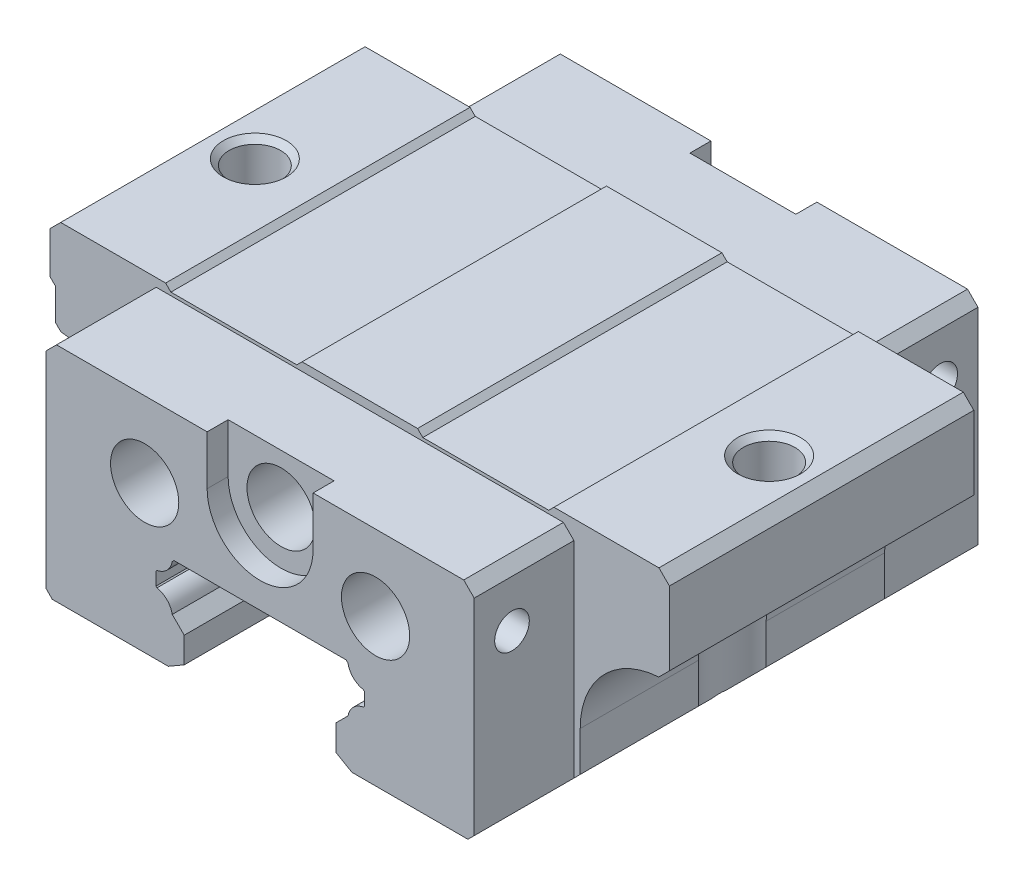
ISO-10303-21;
HEADER;
FILE_DESCRIPTION(('STEP AP214'),'2;1');
FILE_NAME('part.step','',(''),(''),'','','');
FILE_SCHEMA(('AUTOMOTIVE_DESIGN { 1 0 10303 214 1 1 1 1 }'));
ENDSEC;
DATA;
#1=APPLICATION_CONTEXT('core data for automotive mechanical design processes');
#2=APPLICATION_PROTOCOL_DEFINITION('international standard','automotive_design',2000,#1);
#3=PRODUCT_CONTEXT('',#1,'mechanical');
#4=PRODUCT('Part','Part','',(#3));
#5=PRODUCT_RELATED_PRODUCT_CATEGORY('part','',(#4));
#6=PRODUCT_DEFINITION_FORMATION('','',#4);
#7=PRODUCT_DEFINITION_CONTEXT('part definition',#1,'design');
#8=PRODUCT_DEFINITION('design','',#6,#7);
#9=PRODUCT_DEFINITION_SHAPE('','',#8);
#10=(LENGTH_UNIT() NAMED_UNIT(*) SI_UNIT(.MILLI.,.METRE.));
#11=(NAMED_UNIT(*) PLANE_ANGLE_UNIT() SI_UNIT($,.RADIAN.));
#12=(NAMED_UNIT(*) SI_UNIT($,.STERADIAN.) SOLID_ANGLE_UNIT());
#13=UNCERTAINTY_MEASURE_WITH_UNIT(LENGTH_MEASURE(1.E-05),#10,'distance_accuracy_value','');
#14=(GEOMETRIC_REPRESENTATION_CONTEXT(3) GLOBAL_UNCERTAINTY_ASSIGNED_CONTEXT((#13)) GLOBAL_UNIT_ASSIGNED_CONTEXT((#10,
#11,#12)) REPRESENTATION_CONTEXT('',''));
#15=CARTESIAN_POINT('',(0.,0.,0.));
#16=DIRECTION('',(0.,0.,1.));
#17=DIRECTION('',(1.,0.,0.));
#18=AXIS2_PLACEMENT_3D('',#15,#16,#17);
#19=CARTESIAN_POINT('',(-28.9999909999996,-16.9999999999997,-48.));
#20=DIRECTION('',(0.,0.,1.));
#21=DIRECTION('',(0.999999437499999,-0.00106066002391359,0.));
#22=AXIS2_PLACEMENT_3D('',#19,#20,#21);
#23=CYLINDRICAL_SURFACE('',#22,7.99999999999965);
#24=CARTESIAN_POINT('',(-28.4832967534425,-9.01670324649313,-26.5876334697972));
#25=CARTESIAN_POINT('',(-28.4454680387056,-9.01915193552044,-26.6458682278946));
#26=CARTESIAN_POINT('',(-28.4063659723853,-9.02195249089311,-26.7032622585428));
#27=CARTESIAN_POINT('',(-28.3259295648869,-9.02834748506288,-26.8159411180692));
#28=CARTESIAN_POINT('',(-28.2846086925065,-9.03193747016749,-26.8712358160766));
#29=CARTESIAN_POINT('',(-28.1998383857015,-9.04000631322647,-26.979665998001));
#30=CARTESIAN_POINT('',(-28.1564003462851,-9.04448073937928,-27.0328107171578));
#31=CARTESIAN_POINT('',(-28.0674993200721,-9.05441363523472,-27.1368954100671));
#32=CARTESIAN_POINT('',(-28.022045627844,-9.0598678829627,-27.187843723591));
#33=CARTESIAN_POINT('',(-27.9292138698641,-9.07185530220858,-27.2874934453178));
#34=CARTESIAN_POINT('',(-27.8818430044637,-9.07838467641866,-27.3362020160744));
#35=CARTESIAN_POINT('',(-27.7852752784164,-9.09261703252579,-27.4313332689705));
#36=CARTESIAN_POINT('',(-27.7360835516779,-9.10031688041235,-27.4777616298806));
#37=CARTESIAN_POINT('',(-27.6359701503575,-9.11698461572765,-27.5682962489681));
#38=CARTESIAN_POINT('',(-27.5850516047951,-9.12595029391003,-27.6124063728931));
#39=CARTESIAN_POINT('',(-27.4815784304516,-9.14524385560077,-27.6982707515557));
#40=CARTESIAN_POINT('',(-27.4290250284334,-9.15557073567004,-27.7400267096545));
#41=CARTESIAN_POINT('',(-27.3223739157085,-9.17768058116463,-27.8211511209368));
#42=CARTESIAN_POINT('',(-27.2682756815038,-9.18946404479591,-27.860518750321));
#43=CARTESIAN_POINT('',(-27.15862471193,-9.21458063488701,-27.9368367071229));
#44=CARTESIAN_POINT('',(-27.103069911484,-9.22791606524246,-27.9737833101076));
#45=CARTESIAN_POINT('',(-26.9905937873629,-9.25622987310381,-28.0452309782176));
#46=CARTESIAN_POINT('',(-26.9336691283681,-9.27121266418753,-28.0797250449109));
#47=CARTESIAN_POINT('',(-26.8185395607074,-9.30291412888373,-28.1462407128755));
#48=CARTESIAN_POINT('',(-26.7603303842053,-9.3196396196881,-28.1782516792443));
#49=CARTESIAN_POINT('',(-26.642716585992,-9.35491930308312,-28.2397752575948));
#50=CARTESIAN_POINT('',(-26.5833071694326,-9.37348299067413,-28.2692732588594));
#51=CARTESIAN_POINT('',(-26.4633761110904,-9.41253096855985,-28.3257459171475));
#52=CARTESIAN_POINT('',(-26.402849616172,-9.43302766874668,-28.3527016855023));
#53=CARTESIAN_POINT('',(-26.2808798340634,-9.47599616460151,-28.4040178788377));
#54=CARTESIAN_POINT('',(-26.2194331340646,-9.49848008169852,-28.4283600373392));
#55=CARTESIAN_POINT('',(-26.0966371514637,-9.54513500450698,-28.4740934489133));
#56=CARTESIAN_POINT('',(-26.0352902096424,-9.56929306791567,-28.495504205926));
#57=CARTESIAN_POINT('',(-25.9130160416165,-9.61920398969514,-28.5354143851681));
#58=CARTESIAN_POINT('',(-25.8520901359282,-9.64494016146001,-28.5539387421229));
#59=CARTESIAN_POINT('',(-25.7307653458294,-9.6979790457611,-28.5882085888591));
#60=CARTESIAN_POINT('',(-25.6703661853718,-9.72526740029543,-28.6039753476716));
#61=CARTESIAN_POINT('',(-25.5501887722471,-9.78138265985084,-28.6328604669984));
#62=CARTESIAN_POINT('',(-25.4904091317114,-9.81019746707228,-28.6459965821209));
#63=CARTESIAN_POINT('',(-25.3715521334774,-9.86933766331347,-28.6697481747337));
#64=CARTESIAN_POINT('',(-25.3124727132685,-9.89965312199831,-28.6803780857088));
#65=CARTESIAN_POINT('',(-25.1950859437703,-9.96176677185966,-28.6992416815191));
#66=CARTESIAN_POINT('',(-25.136776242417,-9.99355708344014,-28.7074867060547));
#67=CARTESIAN_POINT('',(-25.0209880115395,-10.0585927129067,-28.7217010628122));
#68=CARTESIAN_POINT('',(-24.9635071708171,-10.0918320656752,-28.727678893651));
#69=CARTESIAN_POINT('',(-24.8494259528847,-10.1597381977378,-28.7374750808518));
#70=CARTESIAN_POINT('',(-24.7928235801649,-10.1944007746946,-28.7412993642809));
#71=CARTESIAN_POINT('',(-24.6805396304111,-10.2651259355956,-28.7469000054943));
#72=CARTESIAN_POINT('',(-24.6248565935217,-10.3011859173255,-28.7486799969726));
#73=CARTESIAN_POINT('',(-24.5144435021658,-10.3746786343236,-28.7502986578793));
#74=CARTESIAN_POINT('',(-24.4597126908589,-10.4121101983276,-28.7501389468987));
#75=CARTESIAN_POINT('',(-24.3512288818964,-10.4883190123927,-28.7479796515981));
#76=CARTESIAN_POINT('',(-24.2974759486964,-10.5270963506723,-28.7459799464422));
#77=CARTESIAN_POINT('',(-24.1909660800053,-10.6059697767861,-28.7402368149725));
#78=CARTESIAN_POINT('',(-24.1382101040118,-10.6460670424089,-28.7364917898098));
#79=CARTESIAN_POINT('',(-24.0337065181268,-10.7275537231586,-28.7273487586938));
#80=CARTESIAN_POINT('',(-23.981960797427,-10.7689452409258,-28.7219479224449));
#81=CARTESIAN_POINT('',(-23.8794844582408,-10.8529933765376,-28.709578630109));
#82=CARTESIAN_POINT('',(-23.828756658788,-10.8956528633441,-28.7026063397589));
#83=CARTESIAN_POINT('',(-23.728293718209,-10.9822347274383,-28.6871698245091));
#84=CARTESIAN_POINT('',(-23.6785629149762,-11.0261611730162,-28.6787002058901));
#85=CARTESIAN_POINT('',(-23.5800886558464,-11.1153469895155,-28.6603418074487));
#86=CARTESIAN_POINT('',(-23.5313518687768,-11.1606122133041,-28.6504457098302));
#87=CARTESIAN_POINT('',(-23.4349285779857,-11.2524148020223,-28.6293164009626));
#88=CARTESIAN_POINT('',(-23.3872483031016,-11.2989572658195,-28.6180769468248));
#89=CARTESIAN_POINT('',(-23.2930095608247,-11.3932579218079,-28.5943492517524));
#90=CARTESIAN_POINT('',(-23.2464566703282,-11.4410204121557,-28.5818559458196));
#91=CARTESIAN_POINT('',(-23.1545385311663,-11.5376998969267,-28.555713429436));
#92=CARTESIAN_POINT('',(-23.1091781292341,-11.5866204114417,-28.5420602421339));
#93=CARTESIAN_POINT('',(-22.9747998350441,-11.7352111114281,-28.4994576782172));
#94=CARTESIAN_POINT('',(-22.8878621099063,-11.8363327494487,-28.4689617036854));
#95=CARTESIAN_POINT('',(-22.7193693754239,-12.0424736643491,-28.4045450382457));
#96=CARTESIAN_POINT('',(-22.6378327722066,-12.1475045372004,-28.3706135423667));
#97=CARTESIAN_POINT('',(-22.4804531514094,-12.3610054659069,-28.3001589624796));
#98=CARTESIAN_POINT('',(-22.4046134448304,-12.4694774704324,-28.2636343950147));
#99=CARTESIAN_POINT('',(-22.2588605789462,-12.6893906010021,-28.1888529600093));
#100=CARTESIAN_POINT('',(-22.1889351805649,-12.8008249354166,-28.1505999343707));
#101=CARTESIAN_POINT('',(-22.0551567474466,-13.0261936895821,-28.0732275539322));
#102=CARTESIAN_POINT('',(-21.9912759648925,-13.1401134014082,-28.0341132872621));
#103=CARTESIAN_POINT('',(-21.8696643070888,-13.3699864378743,-27.955884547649));
#104=CARTESIAN_POINT('',(-21.811890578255,-13.4859178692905,-27.9167723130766));
#105=CARTESIAN_POINT('',(-21.7023977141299,-13.7195190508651,-27.8393199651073));
#106=CARTESIAN_POINT('',(-21.6506303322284,-13.8371649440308,-27.8009760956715));
#107=CARTESIAN_POINT('',(-21.5527882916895,-14.0747671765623,-27.7256197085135));
#108=CARTESIAN_POINT('',(-21.5066967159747,-14.1947153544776,-27.6886034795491));
#109=CARTESIAN_POINT('',(-21.420334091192,-14.4369317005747,-27.6168085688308));
#110=CARTESIAN_POINT('',(-21.3800466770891,-14.5591922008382,-27.582023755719));
#111=CARTESIAN_POINT('',(-21.3053939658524,-14.8059257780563,-27.5156054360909));
#112=CARTESIAN_POINT('',(-21.2710106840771,-14.9303908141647,-27.4839624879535));
#113=CARTESIAN_POINT('',(-21.2239125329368,-15.1187577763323,-27.4395080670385));
#114=CARTESIAN_POINT('',(-21.208972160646,-15.181760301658,-27.4252045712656));
#115=CARTESIAN_POINT('',(-21.1805988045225,-15.3082704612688,-27.397714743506));
#116=CARTESIAN_POINT('',(-21.1671641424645,-15.3717774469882,-27.3845271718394));
#117=CARTESIAN_POINT('',(-21.1418122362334,-15.4992797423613,-27.3593739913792));
#118=CARTESIAN_POINT('',(-21.1298937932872,-15.5632746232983,-27.347407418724));
#119=CARTESIAN_POINT('',(-21.1075848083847,-15.6917383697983,-27.3247964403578));
#120=CARTESIAN_POINT('',(-21.0971937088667,-15.7562070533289,-27.314151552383));
#121=CARTESIAN_POINT('',(-21.0779523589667,-15.885603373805,-27.2942800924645));
#122=CARTESIAN_POINT('',(-21.0691023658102,-15.9505310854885,-27.2850537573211));
#123=CARTESIAN_POINT('',(-21.0529592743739,-16.0808305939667,-27.2681106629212));
#124=CARTESIAN_POINT('',(-21.0456674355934,-16.1462027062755,-27.2603951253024));
#125=CARTESIAN_POINT('',(-21.0326608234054,-16.2773761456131,-27.2465596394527));
#126=CARTESIAN_POINT('',(-21.0269485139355,-16.3431779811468,-27.2404421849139));
#127=CARTESIAN_POINT('',(-21.0171261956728,-16.4751959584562,-27.2298826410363));
#128=CARTESIAN_POINT('',(-21.013020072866,-16.5414127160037,-27.2254446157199));
#129=CARTESIAN_POINT('',(-21.0064413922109,-16.674246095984,-27.2183183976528));
#130=CARTESIAN_POINT('',(-21.003974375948,-16.7408633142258,-27.2156361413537));
#131=CARTESIAN_POINT('',(-21.0007121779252,-16.8744818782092,-27.2120842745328));
#132=CARTESIAN_POINT('',(-20.999924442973,-16.9414836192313,-27.2112227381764));
#133=CARTESIAN_POINT('',(-20.9999955,-17.008485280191,-27.2113032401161));
#134=B_SPLINE_CURVE_WITH_KNOTS('',3,(#24,#25,#26,#27,#28,#29,#30,#31,#32,#33,#34,#35,#36,#37,
#38,#39,#40,#41,#42,#43,#44,#45,#46,#47,#48,#49,#50,#51,#52,#53,#54,#55,#56,#57,#58,#59,#60,#61,
#62,#63,#64,#65,#66,#67,#68,#69,#70,#71,#72,#73,#74,#75,#76,#77,#78,#79,#80,#81,#82,#83,#84,#85,
#86,#87,#88,#89,#90,#91,#92,#93,#94,#95,#96,#97,#98,#99,#100,#101,#102,#103,#104,#105,#106,#107,
#108,#109,#110,#111,#112,#113,#114,#115,#116,#117,#118,#119,#120,#121,#122,#123,#124,#125,#126,
#127,#128,#129,#130,#131,#132,#133),.UNSPECIFIED.,.F.,.F.,(4,2,2,2,2,2,2,2,2,2,2,2,2,2,2,2,2,2,
2,2,2,2,2,2,2,2,2,2,2,2,2,2,2,2,2,2,2,2,2,2,2,2,2,2,2,2,2,2,2,2,2,2,2,2,4),(0.,
0.208441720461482,0.415736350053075,0.622017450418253,0.827430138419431,1.0321322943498,
1.23629570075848,1.44010708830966,1.64376906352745,1.8475008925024,2.05153911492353,
2.25613796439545,2.46156957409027,2.66812395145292,2.87610871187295,3.08546356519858,
3.29334969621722,3.49932635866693,3.70363663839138,3.90651772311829,4.10820018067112,
4.30890728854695,4.50885442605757,4.7082485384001,4.9072876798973,5.10616064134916,
5.30504666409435,5.50411524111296,5.7035260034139,5.90342868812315,6.10406671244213,
6.30577327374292,6.5084565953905,6.71199441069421,6.91626066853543,7.32641810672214,
7.73790814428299,8.14963551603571,8.56048887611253,8.96935403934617,9.37512729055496,
9.77737477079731,10.1783927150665,10.5782568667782,10.9768805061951,11.175789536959,
11.3744746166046,11.5730016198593,11.7714559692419,11.9699434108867,12.1685906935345,
12.3675461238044,12.5669799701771,12.7670846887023,12.968074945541),.UNSPECIFIED.);
#135=CARTESIAN_POINT('',(-28.4832967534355,-9.01670324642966,-26.5876334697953));
#136=VERTEX_POINT('',#135);
#137=CARTESIAN_POINT('',(-20.9999955,-17.008485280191,-27.2113032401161));
#138=VERTEX_POINT('',#137);
#139=EDGE_CURVE('E480',#136,#138,#134,.T.);
#140=ORIENTED_EDGE('',*,*,#139,.F.);
#141=DIRECTION('',(-1.21305095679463E-11,7.84960937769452E-13,-1.));
#142=VECTOR('',#141,1.);
#143=CARTESIAN_POINT('',(-28.4832967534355,-9.01670324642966,-26.5876334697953));
#144=LINE('',#143,#142);
#145=CARTESIAN_POINT('',(-28.48329675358,-9.01670324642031,-38.5));
#146=VERTEX_POINT('',#145);
#147=EDGE_CURVE('E498',#146,#136,#144,.F.);
#148=ORIENTED_EDGE('',*,*,#147,.F.);
#149=CARTESIAN_POINT('',(-28.9999909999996,-16.9999999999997,-38.5));
#150=DIRECTION('',(0.,0.,-1.));
#151=DIRECTION('',(0.0645867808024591,0.997912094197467,0.));
#152=AXIS2_PLACEMENT_3D('',#149,#150,#151);
#153=CIRCLE('',#152,7.99999999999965);
#154=CARTESIAN_POINT('',(-20.9999955,-17.008485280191,-38.5));
#155=VERTEX_POINT('',#154);
#156=EDGE_CURVE('E506',#146,#155,#153,.T.);
#157=ORIENTED_EDGE('',*,*,#156,.T.);
#158=DIRECTION('',(0.,0.,1.));
#159=VECTOR('',#158,1.);
#160=CARTESIAN_POINT('',(-20.9999955,-17.008485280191,-38.5));
#161=LINE('',#160,#159);
#162=EDGE_CURVE('E500',#155,#138,#161,.T.);
#163=ORIENTED_EDGE('',*,*,#162,.T.);
#164=EDGE_LOOP('',(#140,#148,#157,#163));
#165=FACE_BOUND('',#164,.T.);
#166=ADVANCED_FACE('F17',(#165),#23,.F.);
#167=CARTESIAN_POINT('',(-28.9999909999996,-16.9999999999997,-48.));
#168=DIRECTION('',(0.,0.,1.));
#169=DIRECTION('',(0.999999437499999,-0.0010606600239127,0.));
#170=AXIS2_PLACEMENT_3D('',#167,#168,#169);
#171=CYLINDRICAL_SURFACE('',#170,7.99999999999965);
#172=CARTESIAN_POINT('',(-20.9999955,-17.008485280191,-20.788696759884));
#173=CARTESIAN_POINT('',(-20.9999230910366,-16.9400329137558,-20.7887790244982));
#174=CARTESIAN_POINT('',(-21.0007542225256,-16.8715809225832,-20.7878699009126));
#175=CARTESIAN_POINT('',(-21.0041862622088,-16.7350284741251,-20.7841333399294));
#176=CARTESIAN_POINT('',(-21.006780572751,-16.6669276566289,-20.7813130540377));
#177=CARTESIAN_POINT('',(-21.0136920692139,-16.5311049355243,-20.7738286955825));
#178=CARTESIAN_POINT('',(-21.0180044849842,-16.4633825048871,-20.7691697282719));
#179=CARTESIAN_POINT('',(-21.0283137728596,-16.3283418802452,-20.7580943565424));
#180=CARTESIAN_POINT('',(-21.0343074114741,-16.2610231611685,-20.7516813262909));
#181=CARTESIAN_POINT('',(-21.0479476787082,-16.1268156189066,-20.7371893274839));
#182=CARTESIAN_POINT('',(-21.0555923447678,-16.0599263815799,-20.729112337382));
#183=CARTESIAN_POINT('',(-21.0725090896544,-15.9266032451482,-20.7113899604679));
#184=CARTESIAN_POINT('',(-21.081780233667,-15.8601691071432,-20.7017454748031));
#185=CARTESIAN_POINT('',(-21.1019290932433,-15.7277815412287,-20.6809906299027));
#186=CARTESIAN_POINT('',(-21.1128066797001,-15.6618280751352,-20.6698803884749));
#187=CARTESIAN_POINT('',(-21.1361511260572,-15.5304273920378,-20.6463011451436));
#188=CARTESIAN_POINT('',(-21.1486184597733,-15.4649803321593,-20.6338317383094));
#189=CARTESIAN_POINT('',(-21.1751278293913,-15.3346172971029,-20.6076450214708));
#190=CARTESIAN_POINT('',(-21.1891707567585,-15.2697016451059,-20.5939270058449));
#191=CARTESIAN_POINT('',(-21.2188173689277,-15.1404289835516,-20.5653581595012));
#192=CARTESIAN_POINT('',(-21.2344221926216,-15.0760724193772,-20.5505065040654));
#193=CARTESIAN_POINT('',(-21.2835783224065,-14.8838038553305,-20.5044097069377));
#194=CARTESIAN_POINT('',(-21.3194421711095,-14.7568359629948,-20.4716519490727));
#195=CARTESIAN_POINT('',(-21.3972427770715,-14.5054517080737,-20.4030444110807));
#196=CARTESIAN_POINT('',(-21.439187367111,-14.3810388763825,-20.3671906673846));
#197=CARTESIAN_POINT('',(-21.5290042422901,-14.1349562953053,-20.2933755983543));
#198=CARTESIAN_POINT('',(-21.5768787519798,-14.0132875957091,-20.2554134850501));
#199=CARTESIAN_POINT('',(-21.6783598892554,-13.7729090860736,-20.1783644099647));
#200=CARTESIAN_POINT('',(-21.7319600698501,-13.6541961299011,-20.1392787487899));
#201=CARTESIAN_POINT('',(-21.8446867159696,-13.4197009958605,-20.0608981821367));
#202=CARTESIAN_POINT('',(-21.9038059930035,-13.3039152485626,-20.021603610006));
#203=CARTESIAN_POINT('',(-22.0281718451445,-13.0742546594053,-19.9431520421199));
#204=CARTESIAN_POINT('',(-22.0934657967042,-12.96040409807,-19.9039989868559));
#205=CARTESIAN_POINT('',(-22.2303129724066,-12.7348824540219,-19.8266022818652));
#206=CARTESIAN_POINT('',(-22.3019110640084,-12.6232353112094,-19.7883681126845));
#207=CARTESIAN_POINT('',(-22.4512975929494,-12.4026521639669,-19.7137048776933));
#208=CARTESIAN_POINT('',(-22.5291151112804,-12.2937324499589,-19.6772857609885));
#209=CARTESIAN_POINT('',(-22.6907884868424,-12.0791425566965,-19.6071608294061));
#210=CARTESIAN_POINT('',(-22.7746576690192,-11.9734803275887,-19.5734613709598));
#211=CARTESIAN_POINT('',(-22.9482002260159,-11.7659321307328,-19.5096815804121));
#212=CARTESIAN_POINT('',(-23.0378717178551,-11.6640449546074,-19.4796000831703));
#213=CARTESIAN_POINT('',(-23.1765669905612,-11.5143499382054,-19.437834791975));
#214=CARTESIAN_POINT('',(-23.2234554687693,-11.4650144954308,-19.4244823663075));
#215=CARTESIAN_POINT('',(-23.3185420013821,-11.3674892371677,-19.3990137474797));
#216=CARTESIAN_POINT('',(-23.3667372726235,-11.3192973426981,-19.3868951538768));
#217=CARTESIAN_POINT('',(-23.4643760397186,-11.2241277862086,-19.3640005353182));
#218=CARTESIAN_POINT('',(-23.5138160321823,-11.1771473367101,-19.3532211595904));
#219=CARTESIAN_POINT('',(-23.6138785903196,-11.0844668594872,-19.3331075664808));
#220=CARTESIAN_POINT('',(-23.6644970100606,-11.038763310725,-19.3237689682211));
#221=CARTESIAN_POINT('',(-23.7668438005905,-10.9487034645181,-19.3066361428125));
#222=CARTESIAN_POINT('',(-23.8185674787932,-10.9043428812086,-19.2988364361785));
#223=CARTESIAN_POINT('',(-23.9230462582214,-10.8170358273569,-19.2848763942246));
#224=CARTESIAN_POINT('',(-23.9757962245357,-10.7740842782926,-19.2787094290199));
#225=CARTESIAN_POINT('',(-24.0822811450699,-10.6896306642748,-19.2681015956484));
#226=CARTESIAN_POINT('',(-24.1360115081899,-10.6481236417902,-19.2636541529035));
#227=CARTESIAN_POINT('',(-24.2444840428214,-10.56651160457,-19.2565666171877));
#228=CARTESIAN_POINT('',(-24.2992240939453,-10.5264040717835,-19.2539231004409));
#229=CARTESIAN_POINT('',(-24.4096736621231,-10.4476217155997,-19.2505379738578));
#230=CARTESIAN_POINT('',(-24.4653817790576,-10.4089450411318,-19.2497938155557));
#231=CARTESIAN_POINT('',(-24.5777112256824,-10.3330565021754,-19.2503039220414));
#232=CARTESIAN_POINT('',(-24.6343317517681,-10.2958434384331,-19.2515565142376));
#233=CARTESIAN_POINT('',(-24.7484234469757,-10.2229148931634,-19.2561572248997));
#234=CARTESIAN_POINT('',(-24.8058943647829,-10.1871989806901,-19.2595047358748));
#235=CARTESIAN_POINT('',(-24.921616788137,-10.11729701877,-19.2683926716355));
#236=CARTESIAN_POINT('',(-24.9798685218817,-10.0831114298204,-19.2739337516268));
#237=CARTESIAN_POINT('',(-25.0970753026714,-10.0163029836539,-19.2873061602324));
#238=CARTESIAN_POINT('',(-25.1560309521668,-9.98368160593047,-19.295139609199));
#239=CARTESIAN_POINT('',(-25.2745592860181,-9.92003184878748,-19.3131932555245));
#240=CARTESIAN_POINT('',(-25.3341328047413,-9.88900609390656,-19.3234172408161));
#241=CARTESIAN_POINT('',(-25.4538001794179,-9.82859019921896,-19.3463471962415));
#242=CARTESIAN_POINT('',(-25.5138948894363,-9.79920379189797,-19.3590585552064));
#243=CARTESIAN_POINT('',(-25.6339191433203,-9.74233964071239,-19.3869209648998));
#244=CARTESIAN_POINT('',(-25.6938471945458,-9.7148506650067,-19.4020555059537));
#245=CARTESIAN_POINT('',(-25.8130917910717,-9.66189567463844,-19.4346886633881));
#246=CARTESIAN_POINT('',(-25.8724075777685,-9.63641027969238,-19.4521585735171));
#247=CARTESIAN_POINT('',(-25.9903703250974,-9.5873890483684,-19.4894473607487));
#248=CARTESIAN_POINT('',(-26.049018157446,-9.56383659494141,-19.5092416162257));
#249=CARTESIAN_POINT('',(-26.1655851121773,-9.51860335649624,-19.5511652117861));
#250=CARTESIAN_POINT('',(-26.22350626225,-9.49690878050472,-19.5732740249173));
#251=CARTESIAN_POINT('',(-26.3385594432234,-9.45531457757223,-19.6198145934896));
#252=CARTESIAN_POINT('',(-26.3956941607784,-9.43540393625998,-19.6442298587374));
#253=CARTESIAN_POINT('',(-26.5091125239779,-9.39730063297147,-19.6953726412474));
#254=CARTESIAN_POINT('',(-26.565399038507,-9.37909964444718,-19.7220875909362));
#255=CARTESIAN_POINT('',(-26.6770572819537,-9.34433886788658,-19.7778203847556));
#256=CARTESIAN_POINT('',(-26.7324316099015,-9.32777330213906,-19.8068294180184));
#257=CARTESIAN_POINT('',(-26.8421995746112,-9.29620672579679,-19.86714214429));
#258=CARTESIAN_POINT('',(-26.8965951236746,-9.28120230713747,-19.8984405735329));
#259=CARTESIAN_POINT('',(-27.0043370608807,-9.25268157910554,-19.9633247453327));
#260=CARTESIAN_POINT('',(-27.057684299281,-9.23916401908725,-19.9969085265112));
#261=CARTESIAN_POINT('',(-27.1632582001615,-9.21354078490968,-20.0663566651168));
#262=CARTESIAN_POINT('',(-27.2154843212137,-9.20143578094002,-20.1022220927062));
#263=CARTESIAN_POINT('',(-27.3187412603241,-9.17856168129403,-20.176227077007));
#264=CARTESIAN_POINT('',(-27.3697698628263,-9.16779492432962,-20.2143704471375));
#265=CARTESIAN_POINT('',(-27.4705533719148,-9.14752159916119,-20.2929247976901));
#266=CARTESIAN_POINT('',(-27.5203041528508,-9.13801877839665,-20.3333420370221));
#267=CARTESIAN_POINT('',(-27.6184496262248,-9.12019786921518,-20.4164371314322));
#268=CARTESIAN_POINT('',(-27.6668380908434,-9.11188467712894,-20.4591233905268));
#269=CARTESIAN_POINT('',(-27.7621722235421,-9.09636782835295,-20.5467486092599));
#270=CARTESIAN_POINT('',(-27.809109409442,-9.08916996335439,-20.5916978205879));
#271=CARTESIAN_POINT('',(-27.9014496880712,-9.07580882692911,-20.6838396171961));
#272=CARTESIAN_POINT('',(-27.9468419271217,-9.06965200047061,-20.7310440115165));
#273=CARTESIAN_POINT('',(-28.0359961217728,-9.05829822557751,-20.8276849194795));
#274=CARTESIAN_POINT('',(-28.0797447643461,-9.05310814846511,-20.8771345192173));
#275=CARTESIAN_POINT('',(-28.1655106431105,-9.04361342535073,-20.9782520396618));
#276=CARTESIAN_POINT('',(-28.2075120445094,-9.03931586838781,-21.0299340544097));
#277=CARTESIAN_POINT('',(-28.2896765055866,-9.03153176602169,-21.1354996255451));
#278=CARTESIAN_POINT('',(-28.3298211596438,-9.02805233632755,-21.1893980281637));
#279=CARTESIAN_POINT('',(-28.4081618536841,-9.02183091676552,-21.2993753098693));
#280=CARTESIAN_POINT('',(-28.4463369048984,-9.0190959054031,-21.3554695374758));
#281=CARTESIAN_POINT('',(-28.483296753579,-9.01670324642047,-21.412366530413));
#282=B_SPLINE_CURVE_WITH_KNOTS('',3,(#172,#173,#174,#175,#176,#177,#178,#179,#180,#181,#182,
#183,#184,#185,#186,#187,#188,#189,#190,#191,#192,#193,#194,#195,#196,#197,#198,#199,#200,#201,
#202,#203,#204,#205,#206,#207,#208,#209,#210,#211,#212,#213,#214,#215,#216,#217,#218,#219,#220,
#221,#222,#223,#224,#225,#226,#227,#228,#229,#230,#231,#232,#233,#234,#235,#236,#237,#238,#239,
#240,#241,#242,#243,#244,#245,#246,#247,#248,#249,#250,#251,#252,#253,#254,#255,#256,#257,#258,
#259,#260,#261,#262,#263,#264,#265,#266,#267,#268,#269,#270,#271,#272,#273,#274,#275,#276,#277,
#278,#279,#280,#281),.UNSPECIFIED.,.F.,.F.,(4,2,2,2,2,2,2,2,2,2,2,2,2,2,2,2,2,2,2,2,2,2,2,2,2,2,
2,2,2,2,2,2,2,2,2,2,2,2,2,2,2,2,2,2,2,2,2,2,2,2,2,2,2,2,4),(0.,0.205340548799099,
0.40991693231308,0.613929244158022,0.817551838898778,1.02093370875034,1.22419906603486,
1.42744809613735,1.63075784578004,1.83418321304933,2.03775800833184,2.44535335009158,
2.85347847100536,3.26175716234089,3.66958089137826,4.07688065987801,4.48760798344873,
4.90154036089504,5.31753629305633,5.73447791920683,6.15128491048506,6.35933793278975,
6.56697812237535,6.77408785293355,6.98055487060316,7.18627290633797,7.39114232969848,
7.59522050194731,7.79891025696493,8.00232656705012,8.20557257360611,8.40875966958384,
8.61200750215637,8.81544392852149,9.01920492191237,9.22341234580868,9.42628343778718,
9.62685761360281,9.82547183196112,10.0224538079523,10.2181209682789,10.4127795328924,
10.6067237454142,10.8002352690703,10.9935827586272,11.1870216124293,11.3807939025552,
11.5751284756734,11.7702412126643,11.966335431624,12.1636024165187,12.3622220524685,
12.5623635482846,12.7641862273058,12.9678403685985),.UNSPECIFIED.);
#283=CARTESIAN_POINT('',(-20.9999955,-17.008485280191,-20.788696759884));
#284=VERTEX_POINT('',#283);
#285=CARTESIAN_POINT('',(-28.4832967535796,-9.01670324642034,-21.4123665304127));
#286=VERTEX_POINT('',#285);
#287=EDGE_CURVE('E518',#284,#286,#282,.T.);
#288=ORIENTED_EDGE('',*,*,#287,.F.);
#289=DIRECTION('',(0.,0.,1.));
#290=VECTOR('',#289,1.);
#291=CARTESIAN_POINT('',(-20.9999955,-17.008485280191,-20.788696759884));
#292=LINE('',#291,#290);
#293=CARTESIAN_POINT('',(-20.9999955,-17.008485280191,-9.5));
#294=VERTEX_POINT('',#293);
#295=EDGE_CURVE('E531',#284,#294,#292,.T.);
#296=ORIENTED_EDGE('',*,*,#295,.T.);
#297=CARTESIAN_POINT('',(-28.9999909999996,-16.9999999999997,-9.5));
#298=DIRECTION('',(0.,0.,1.));
#299=DIRECTION('',(0.999999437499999,-0.00106066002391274,0.));
#300=AXIS2_PLACEMENT_3D('',#297,#298,#299);
#301=CIRCLE('',#300,7.99999999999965);
#302=CARTESIAN_POINT('',(-28.48329675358,-9.01670324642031,-9.5));
#303=VERTEX_POINT('',#302);
#304=EDGE_CURVE('E1825',#303,#294,#301,.F.);
#305=ORIENTED_EDGE('',*,*,#304,.F.);
#306=DIRECTION('',(0.,0.,-1.));
#307=VECTOR('',#306,1.);
#308=CARTESIAN_POINT('',(-28.48329675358,-9.01670324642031,-9.5));
#309=LINE('',#308,#307);
#310=EDGE_CURVE('E1823',#286,#303,#309,.F.);
#311=ORIENTED_EDGE('',*,*,#310,.F.);
#312=EDGE_LOOP('',(#288,#296,#305,#311));
#313=FACE_BOUND('',#312,.T.);
#314=ADVANCED_FACE('F533',(#313),#171,.F.);
#315=CARTESIAN_POINT('',(-20.9999955,-20.800005,-38.5));
#316=DIRECTION('',(-1.,0.,0.));
#317=DIRECTION('',(0.,0.,1.));
#318=AXIS2_PLACEMENT_3D('',#315,#316,#317);
#319=PLANE('',#318);
#320=DIRECTION('',(0.,5.33248669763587E-11,1.));
#321=VECTOR('',#320,1.);
#322=CARTESIAN_POINT('',(-20.9999955,-20.800005,-38.5));
#323=LINE('',#322,#321);
#324=CARTESIAN_POINT('',(-20.9999955,-20.800005,-38.5));
#325=VERTEX_POINT('',#324);
#326=CARTESIAN_POINT('',(-20.9999955,-20.800004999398,-27.2113032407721));
#327=VERTEX_POINT('',#326);
#328=EDGE_CURVE('E1824',#325,#327,#323,.T.);
#329=ORIENTED_EDGE('',*,*,#328,.T.);
#330=DIRECTION('',(0.,1.,1.730386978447E-10));
#331=VECTOR('',#330,1.);
#332=CARTESIAN_POINT('',(-20.9999955,-20.800004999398,-27.2113032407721));
#333=LINE('',#332,#331);
#334=EDGE_CURVE('E1828',#327,#138,#333,.T.);
#335=ORIENTED_EDGE('',*,*,#334,.T.);
#336=ORIENTED_EDGE('',*,*,#162,.F.);
#337=DIRECTION('',(0.,-1.,0.));
#338=VECTOR('',#337,1.);
#339=CARTESIAN_POINT('',(-20.9999955,-17.008485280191,-38.5));
#340=LINE('',#339,#338);
#341=EDGE_CURVE('E1839',#325,#155,#340,.F.);
#342=ORIENTED_EDGE('',*,*,#341,.F.);
#343=EDGE_LOOP('',(#329,#335,#336,#342));
#344=FACE_BOUND('',#343,.T.);
#345=ADVANCED_FACE('F542',(#344),#319,.T.);
#346=CARTESIAN_POINT('',(-20.9999955,-20.800005,-20.788696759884));
#347=DIRECTION('',(-1.,0.,0.));
#348=DIRECTION('',(0.,0.,1.));
#349=AXIS2_PLACEMENT_3D('',#346,#347,#348);
#350=PLANE('',#349);
#351=ORIENTED_EDGE('',*,*,#295,.F.);
#352=DIRECTION('',(0.,-1.,8.67723431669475E-11));
#353=VECTOR('',#352,1.);
#354=CARTESIAN_POINT('',(-20.9999955,-17.008485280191,-20.788696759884));
#355=LINE('',#354,#353);
#356=CARTESIAN_POINT('',(-20.9999955,-20.8000049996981,-20.788696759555));
#357=VERTEX_POINT('',#356);
#358=EDGE_CURVE('E1843',#284,#357,#355,.T.);
#359=ORIENTED_EDGE('',*,*,#358,.T.);
#360=DIRECTION('',(0.,-2.67415841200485E-11,1.));
#361=VECTOR('',#360,1.);
#362=CARTESIAN_POINT('',(-20.9999955,-20.8000049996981,-20.788696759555));
#363=LINE('',#362,#361);
#364=CARTESIAN_POINT('',(-20.9999955,-20.800005,-9.5));
#365=VERTEX_POINT('',#364);
#366=EDGE_CURVE('E1848',#357,#365,#363,.T.);
#367=ORIENTED_EDGE('',*,*,#366,.T.);
#368=DIRECTION('',(0.,1.,0.));
#369=VECTOR('',#368,1.);
#370=CARTESIAN_POINT('',(-20.9999955,-20.800005,-9.5));
#371=LINE('',#370,#369);
#372=EDGE_CURVE('E1853',#365,#294,#371,.T.);
#373=ORIENTED_EDGE('',*,*,#372,.T.);
#374=EDGE_LOOP('',(#351,#359,#367,#373));
#375=FACE_BOUND('',#374,.T.);
#376=ADVANCED_FACE('F546',(#375),#350,.T.);
#377=CARTESIAN_POINT('',(-20.9999955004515,-20.8000049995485,-48.));
#378=DIRECTION('',(-0.707106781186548,-0.707106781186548,0.));
#379=DIRECTION('',(0.707106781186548,-0.707106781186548,0.));
#380=AXIS2_PLACEMENT_3D('',#377,#378,#379);
#381=PLANE('',#380);
#382=DIRECTION('',(0.,0.,1.));
#383=VECTOR('',#382,1.);
#384=CARTESIAN_POINT('',(-19.8000005,-22.,-48.));
#385=LINE('',#384,#383);
#386=CARTESIAN_POINT('',(-19.8000005,-22.,-48.));
#387=VERTEX_POINT('',#386);
#388=CARTESIAN_POINT('',(-19.8000005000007,-21.9999999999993,-24.6873897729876));
#389=VERTEX_POINT('',#388);
#390=EDGE_CURVE('E1858',#387,#389,#385,.T.);
#391=ORIENTED_EDGE('',*,*,#390,.T.);
#392=CARTESIAN_POINT('',(-19.8000005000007,-21.9999999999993,-24.6873897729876));
#393=CARTESIAN_POINT('',(-19.8217770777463,-21.9782234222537,-24.8362862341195));
#394=CARTESIAN_POINT('',(-19.8479430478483,-21.9520574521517,-24.9689137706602));
#395=CARTESIAN_POINT('',(-19.9376510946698,-21.8623494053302,-25.3476785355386));
#396=CARTESIAN_POINT('',(-20.0087674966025,-21.7912330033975,-25.5615944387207));
#397=CARTESIAN_POINT('',(-20.2399317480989,-21.5600687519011,-26.1397645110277));
#398=CARTESIAN_POINT('',(-20.4198939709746,-21.3801065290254,-26.4571000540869));
#399=CARTESIAN_POINT('',(-20.7404736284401,-21.0595268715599,-26.9104681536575));
#400=CARTESIAN_POINT('',(-20.8669092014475,-20.9330912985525,-27.0662522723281));
#401=CARTESIAN_POINT('',(-20.9999955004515,-20.8000049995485,-27.2113032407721));
#402=B_SPLINE_CURVE_WITH_KNOTS('',3,(#392,#393,#394,#395,#396,#397,#398,#399,#400,#401),
.UNSPECIFIED.,.F.,.F.,(4,2,2,2,4),(0.,0.112915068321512,0.336758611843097,0.754149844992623,1.),.UNSPECIFIED.);
#403=EDGE_CURVE('E574',#389,#327,#402,.T.);
#404=ORIENTED_EDGE('',*,*,#403,.T.);
#405=ORIENTED_EDGE('',*,*,#328,.F.);
#406=DIRECTION('',(0.70710678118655,-0.707106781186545,0.));
#407=VECTOR('',#406,1.);
#408=CARTESIAN_POINT('',(-20.9999955,-20.800005,-38.5));
#409=LINE('',#408,#407);
#410=CARTESIAN_POINT('',(-20.4000005,-21.4,-38.5));
#411=VERTEX_POINT('',#410);
#412=EDGE_CURVE('E566',#411,#325,#409,.F.);
#413=ORIENTED_EDGE('',*,*,#412,.F.);
#414=DIRECTION('',(0.,0.,-1.));
#415=VECTOR('',#414,1.);
#416=CARTESIAN_POINT('',(-20.4000005,-21.4,-38.5));
#417=LINE('',#416,#415);
#418=CARTESIAN_POINT('',(-20.4000005,-21.4,-48.));
#419=VERTEX_POINT('',#418);
#420=EDGE_CURVE('E573',#411,#419,#417,.T.);
#421=ORIENTED_EDGE('',*,*,#420,.T.);
#422=DIRECTION('',(0.707106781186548,-0.707106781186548,0.));
#423=VECTOR('',#422,1.);
#424=CARTESIAN_POINT('',(-20.4000005,-21.4,-48.));
#425=LINE('',#424,#423);
#426=EDGE_CURVE('E579',#419,#387,#425,.T.);
#427=ORIENTED_EDGE('',*,*,#426,.T.);
#428=EDGE_LOOP('',(#391,#404,#405,#413,#421,#427));
#429=FACE_BOUND('',#428,.T.);
#430=ADVANCED_FACE('F550',(#429),#381,.T.);
#431=CARTESIAN_POINT('',(19.8,-22.,-23.3126136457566));
#432=DIRECTION('',(0.707106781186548,-0.707106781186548,0.));
#433=DIRECTION('',(0.707106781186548,0.707106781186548,0.));
#434=AXIS2_PLACEMENT_3D('',#431,#432,#433);
#435=PLANE('',#434);
#436=DIRECTION('',(0.,0.,-1.));
#437=VECTOR('',#436,1.);
#438=CARTESIAN_POINT('',(19.8,-22.,0.));
#439=LINE('',#438,#437);
#440=CARTESIAN_POINT('',(19.8000000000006,-21.9999999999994,-23.3126136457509));
#441=VERTEX_POINT('',#440);
#442=CARTESIAN_POINT('',(19.8,-22.,0.));
#443=VERTEX_POINT('',#442);
#444=EDGE_CURVE('E584',#441,#443,#439,.F.);
#445=ORIENTED_EDGE('',*,*,#444,.F.);
#446=CARTESIAN_POINT('',(19.8000000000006,-21.9999999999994,-23.3126136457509));
#447=CARTESIAN_POINT('',(19.8217766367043,-21.9782233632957,-23.1637160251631));
#448=CARTESIAN_POINT('',(19.847942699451,-21.952057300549,-23.0310878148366));
#449=CARTESIAN_POINT('',(19.9376507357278,-21.8623492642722,-22.6523227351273));
#450=CARTESIAN_POINT('',(20.008767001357,-21.791232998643,-22.4384070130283));
#451=CARTESIAN_POINT('',(20.2399312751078,-21.5600687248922,-21.8602362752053));
#452=CARTESIAN_POINT('',(20.4198937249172,-21.3801062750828,-21.542900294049));
#453=CARTESIAN_POINT('',(20.7404763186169,-21.0595236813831,-21.0895280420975));
#454=CARTESIAN_POINT('',(20.8669149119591,-20.9330850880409,-20.9337406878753));
#455=CARTESIAN_POINT('',(21.000004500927,-20.799995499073,-20.7886869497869));
#456=B_SPLINE_CURVE_WITH_KNOTS('',3,(#446,#447,#448,#449,#450,#451,#452,#453,#454,#455),
.UNSPECIFIED.,.F.,.F.,(4,2,2,2,4),(0.,0.112914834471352,0.336756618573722,0.75414579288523,1.),.UNSPECIFIED.);
#457=CARTESIAN_POINT('',(21.000004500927,-20.799995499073,-20.7886869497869));
#458=VERTEX_POINT('',#457);
#459=EDGE_CURVE('E588',#441,#458,#456,.T.);
#460=ORIENTED_EDGE('',*,*,#459,.T.);
#461=DIRECTION('',(-8.21187740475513E-11,-8.21187740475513E-11,1.));
#462=VECTOR('',#461,1.);
#463=CARTESIAN_POINT('',(21.000004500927,-20.799995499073,-20.7886869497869));
#464=LINE('',#463,#462);
#465=CARTESIAN_POINT('',(21.0000045,-20.7999955,-9.5));
#466=VERTEX_POINT('',#465);
#467=EDGE_CURVE('E600',#458,#466,#464,.T.);
#468=ORIENTED_EDGE('',*,*,#467,.T.);
#469=DIRECTION('',(-0.707106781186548,-0.707106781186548,0.));
#470=VECTOR('',#469,1.);
#471=CARTESIAN_POINT('',(21.0000045,-20.7999955,-9.5));
#472=LINE('',#471,#470);
#473=CARTESIAN_POINT('',(20.39999975,-21.40000025,-9.5));
#474=VERTEX_POINT('',#473);
#475=EDGE_CURVE('E607',#466,#474,#472,.T.);
#476=ORIENTED_EDGE('',*,*,#475,.T.);
#477=DIRECTION('',(-3.28947330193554E-09,-3.28947330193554E-09,1.));
#478=VECTOR('',#477,1.);
#479=CARTESIAN_POINT('',(20.39999975,-21.40000025,-9.5));
#480=LINE('',#479,#478);
#481=CARTESIAN_POINT('',(20.39999971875,-21.40000028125,0.));
#482=VERTEX_POINT('',#481);
#483=EDGE_CURVE('E612',#474,#482,#480,.T.);
#484=ORIENTED_EDGE('',*,*,#483,.T.);
#485=DIRECTION('',(-0.707106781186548,-0.707106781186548,0.));
#486=VECTOR('',#485,1.);
#487=CARTESIAN_POINT('',(20.39999971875,-21.40000028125,0.));
#488=LINE('',#487,#486);
#489=EDGE_CURVE('E617',#443,#482,#488,.F.);
#490=ORIENTED_EDGE('',*,*,#489,.F.);
#491=EDGE_LOOP('',(#445,#460,#468,#476,#484,#490));
#492=FACE_BOUND('',#491,.T.);
#493=ADVANCED_FACE('F555',(#492),#435,.T.);
#494=CARTESIAN_POINT('',(21.0000045,-20.7999955,-9.5));
#495=DIRECTION('',(1.,0.,0.));
#496=DIRECTION('',(0.,0.,-1.));
#497=AXIS2_PLACEMENT_3D('',#494,#495,#496);
#498=PLANE('',#497);
#499=ORIENTED_EDGE('',*,*,#467,.F.);
#500=DIRECTION('',(0.,1.,-2.66497316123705E-10));
#501=VECTOR('',#500,1.);
#502=CARTESIAN_POINT('',(21.0000045,-20.799995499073,-20.7886869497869));
#503=LINE('',#502,#501);
#504=CARTESIAN_POINT('',(21.0000045,-17.008485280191,-20.7886869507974));
#505=VERTEX_POINT('',#504);
#506=EDGE_CURVE('E622',#458,#505,#503,.T.);
#507=ORIENTED_EDGE('',*,*,#506,.T.);
#508=DIRECTION('',(0.,0.,1.));
#509=VECTOR('',#508,1.);
#510=CARTESIAN_POINT('',(21.0000045,-17.008485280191,-20.7886869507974));
#511=LINE('',#510,#509);
#512=CARTESIAN_POINT('',(21.0000045,-17.008485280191,-9.5));
#513=VERTEX_POINT('',#512);
#514=EDGE_CURVE('E627',#505,#513,#511,.T.);
#515=ORIENTED_EDGE('',*,*,#514,.T.);
#516=DIRECTION('',(0.,-1.,0.));
#517=VECTOR('',#516,1.);
#518=CARTESIAN_POINT('',(21.0000045,-17.008485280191,-9.5));
#519=LINE('',#518,#517);
#520=EDGE_CURVE('E632',#513,#466,#519,.T.);
#521=ORIENTED_EDGE('',*,*,#520,.T.);
#522=EDGE_LOOP('',(#499,#507,#515,#521));
#523=FACE_BOUND('',#522,.T.);
#524=ADVANCED_FACE('F1745',(#523),#498,.T.);
#525=CARTESIAN_POINT('',(21.0000045,-20.7999955,-27.2113130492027));
#526=DIRECTION('',(1.,0.,0.));
#527=DIRECTION('',(0.,0.,-1.));
#528=AXIS2_PLACEMENT_3D('',#525,#526,#527);
#529=PLANE('',#528);
#530=DIRECTION('',(0.,0.,1.));
#531=VECTOR('',#530,1.);
#532=CARTESIAN_POINT('',(21.0000045,-17.008485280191,-38.5));
#533=LINE('',#532,#531);
#534=CARTESIAN_POINT('',(21.0000045,-17.008485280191,-38.5));
#535=VERTEX_POINT('',#534);
#536=CARTESIAN_POINT('',(21.0000045,-17.008485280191,-27.2113130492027));
#537=VERTEX_POINT('',#536);
#538=EDGE_CURVE('E637',#535,#537,#533,.T.);
#539=ORIENTED_EDGE('',*,*,#538,.T.);
#540=DIRECTION('',(0.,-1.,-8.95377009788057E-11));
#541=VECTOR('',#540,1.);
#542=CARTESIAN_POINT('',(21.0000045,-17.008485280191,-27.2113130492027));
#543=LINE('',#542,#541);
#544=CARTESIAN_POINT('',(21.0000045,-20.7999954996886,-27.2113130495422));
#545=VERTEX_POINT('',#544);
#546=EDGE_CURVE('E642',#537,#545,#543,.T.);
#547=ORIENTED_EDGE('',*,*,#546,.T.);
#548=DIRECTION('',(0.,-2.75866158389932E-11,-1.));
#549=VECTOR('',#548,1.);
#550=CARTESIAN_POINT('',(21.0000045,-20.7999954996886,-27.2113130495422));
#551=LINE('',#550,#549);
#552=CARTESIAN_POINT('',(21.0000045,-20.7999955,-38.5));
#553=VERTEX_POINT('',#552);
#554=EDGE_CURVE('E647',#553,#545,#551,.F.);
#555=ORIENTED_EDGE('',*,*,#554,.F.);
#556=DIRECTION('',(0.,1.,0.));
#557=VECTOR('',#556,1.);
#558=CARTESIAN_POINT('',(21.0000045,-20.7999955,-38.5));
#559=LINE('',#558,#557);
#560=EDGE_CURVE('E652',#535,#553,#559,.F.);
#561=ORIENTED_EDGE('',*,*,#560,.F.);
#562=EDGE_LOOP('',(#539,#547,#555,#561));
#563=FACE_BOUND('',#562,.T.);
#564=ADVANCED_FACE('F681',(#563),#529,.T.);
#565=CARTESIAN_POINT('',(29.,-17.0000000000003,-48.));
#566=DIRECTION('',(0.,0.,1.));
#567=DIRECTION('',(-0.0645879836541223,0.997912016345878,0.));
#568=AXIS2_PLACEMENT_3D('',#565,#566,#567);
#569=CYLINDRICAL_SURFACE('',#568,8.00000000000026);
#570=CARTESIAN_POINT('',(21.0000044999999,-17.008485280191,-27.2113130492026));
#571=CARTESIAN_POINT('',(20.9999320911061,-16.940032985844,-27.2112307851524));
#572=CARTESIAN_POINT('',(21.0007632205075,-16.8715810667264,-27.2121399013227));
#573=CARTESIAN_POINT('',(21.0041952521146,-16.7350287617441,-27.2158764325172));
#574=CARTESIAN_POINT('',(21.0067895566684,-16.6669280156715,-27.2186966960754));
#575=CARTESIAN_POINT('',(21.0137010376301,-16.5311054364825,-27.2261809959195));
#576=CARTESIAN_POINT('',(21.018013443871,-16.4633830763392,-27.2308399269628));
#577=CARTESIAN_POINT('',(21.0283227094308,-16.3283425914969,-27.2419152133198));
#578=CARTESIAN_POINT('',(21.034316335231,-16.261023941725,-27.2483281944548));
#579=CARTESIAN_POINT('',(21.0479565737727,-16.12681653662,-27.262820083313));
#580=CARTESIAN_POINT('',(21.055601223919,-16.0599273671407,-27.2708970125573));
#581=CARTESIAN_POINT('',(21.0725179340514,-15.9266043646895,-27.2886192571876));
#582=CARTESIAN_POINT('',(21.0817890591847,-15.8601702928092,-27.2982636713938));
#583=CARTESIAN_POINT('',(21.1019378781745,-15.7277828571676,-27.3190183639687));
#584=CARTESIAN_POINT('',(21.1128154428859,-15.661829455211,-27.3301285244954));
#585=CARTESIAN_POINT('',(21.1361598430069,-15.530428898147,-27.353707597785));
#586=CARTESIAN_POINT('',(21.1486271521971,-15.4649819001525,-27.3661769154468));
#587=CARTESIAN_POINT('',(21.1751364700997,-15.3346189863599,-27.3923634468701));
#588=CARTESIAN_POINT('',(21.1891793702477,-15.2697033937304,-27.4060813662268));
#589=CARTESIAN_POINT('',(21.2188259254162,-15.1404308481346,-27.4346500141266));
#590=CARTESIAN_POINT('',(21.2344307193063,-15.0760743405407,-27.4495015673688));
#591=CARTESIAN_POINT('',(21.283586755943,-14.8838059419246,-27.4955980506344));
#592=CARTESIAN_POINT('',(21.3194505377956,-14.7568381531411,-27.5283555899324));
#593=CARTESIAN_POINT('',(21.3972510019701,-14.5054540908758,-27.5969626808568));
#594=CARTESIAN_POINT('',(21.4391955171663,-14.3810413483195,-27.6328161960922));
#595=CARTESIAN_POINT('',(21.5290122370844,-14.1349589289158,-27.7066308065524));
#596=CARTESIAN_POINT('',(21.5768866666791,-14.0132903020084,-27.7445926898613));
#597=CARTESIAN_POINT('',(21.6783676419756,-13.7729119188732,-27.8216413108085));
#598=CARTESIAN_POINT('',(21.7319677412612,-13.654199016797,-27.860726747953));
#599=CARTESIAN_POINT('',(21.8446942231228,-13.4197039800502,-27.9391068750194));
#600=CARTESIAN_POINT('',(21.9038134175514,-13.303918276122,-27.978401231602));
#601=CARTESIAN_POINT('',(22.0281790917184,-13.0742577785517,-28.056852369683));
#602=CARTESIAN_POINT('',(22.0934729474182,-12.9604072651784,-28.0960052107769));
#603=CARTESIAN_POINT('',(22.2303199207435,-12.7348857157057,-28.1734014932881));
#604=CARTESIAN_POINT('',(22.3019179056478,-12.6232386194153,-28.2116354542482));
#605=CARTESIAN_POINT('',(22.4513042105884,-12.4026555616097,-28.2862982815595));
#606=CARTESIAN_POINT('',(22.5291216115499,-12.2937358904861,-28.3227171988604));
#607=CARTESIAN_POINT('',(22.6907947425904,-12.0791460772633,-28.3928417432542));
#608=CARTESIAN_POINT('',(22.7746637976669,-11.9734838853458,-28.4265410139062));
#609=CARTESIAN_POINT('',(22.9482060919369,-11.7659357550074,-28.490320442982));
#610=CARTESIAN_POINT('',(23.0378774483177,-11.6640486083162,-28.5204017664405));
#611=CARTESIAN_POINT('',(23.176572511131,-11.5143536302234,-28.5621668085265));
#612=CARTESIAN_POINT('',(23.2234609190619,-11.4650181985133,-28.5755191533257));
#613=CARTESIAN_POINT('',(23.3185473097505,-11.3674929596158,-28.6009876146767));
#614=CARTESIAN_POINT('',(23.3667425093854,-11.3193010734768,-28.6131061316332));
#615=CARTESIAN_POINT('',(23.4643811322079,-11.224131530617,-28.6360006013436));
#616=CARTESIAN_POINT('',(23.5138210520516,-11.1771510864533,-28.6467799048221));
#617=CARTESIAN_POINT('',(23.6138834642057,-11.0844706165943,-28.6668933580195));
#618=CARTESIAN_POINT('',(23.6645018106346,-11.0387670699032,-28.6762318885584));
#619=CARTESIAN_POINT('',(23.7668484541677,-10.9487072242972,-28.6933645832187));
#620=CARTESIAN_POINT('',(23.818572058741,-10.9043466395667,-28.7011642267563));
#621=CARTESIAN_POINT('',(23.9230506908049,-10.8170395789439,-28.7151241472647));
#622=CARTESIAN_POINT('',(23.9758005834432,-10.7740880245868,-28.7212910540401));
#623=CARTESIAN_POINT('',(24.0822853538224,-10.6896343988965,-28.7318987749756));
#624=CARTESIAN_POINT('',(24.1360156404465,-10.6481273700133,-28.7363461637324));
#625=CARTESIAN_POINT('',(24.2444880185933,-10.5665153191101,-28.7434335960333));
#626=CARTESIAN_POINT('',(24.2992279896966,-10.526407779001,-28.7460770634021));
#627=CARTESIAN_POINT('',(24.4096773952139,-10.4476254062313,-28.7494620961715));
#628=CARTESIAN_POINT('',(24.4653854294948,-10.4089487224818,-28.7502062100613));
#629=CARTESIAN_POINT('',(24.5777147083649,-10.3330601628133,-28.7496960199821));
#630=CARTESIAN_POINT('',(24.6343351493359,-10.2958470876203,-28.7484433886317));
#631=CARTESIAN_POINT('',(24.7484266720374,-10.222918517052,-28.7438426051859));
#632=CARTESIAN_POINT('',(24.8058975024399,-10.1872025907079,-28.7404950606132));
#633=CARTESIAN_POINT('',(24.9216197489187,-10.1173005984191,-28.7316070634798));
#634=CARTESIAN_POINT('',(24.9798713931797,-10.0831149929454,-28.7260659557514));
#635=CARTESIAN_POINT('',(25.097077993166,-10.0163065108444,-28.7126934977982));
#636=CARTESIAN_POINT('',(25.1560335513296,-9.98368511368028,-28.704860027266));
#637=CARTESIAN_POINT('',(25.2745617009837,-9.92003531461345,-28.6868063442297));
#638=CARTESIAN_POINT('',(25.3341351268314,-9.88900953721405,-28.6765823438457));
#639=CARTESIAN_POINT('',(25.4538023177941,-9.82859359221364,-28.6536523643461));
#640=CARTESIAN_POINT('',(25.5138969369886,-9.79920715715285,-28.6409409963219));
#641=CARTESIAN_POINT('',(25.6339210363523,-9.74234293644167,-28.6130785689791));
#642=CARTESIAN_POINT('',(25.6938490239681,-9.71485391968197,-28.5979440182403));
#643=CARTESIAN_POINT('',(25.8130934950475,-9.66189884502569,-28.5653108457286));
#644=CARTESIAN_POINT('',(25.872409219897,-9.63641340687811,-28.5478409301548));
#645=CARTESIAN_POINT('',(25.9903718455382,-9.5873920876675,-28.5105521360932));
#646=CARTESIAN_POINT('',(26.0490196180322,-9.56383958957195,-28.4907578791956));
#647=CARTESIAN_POINT('',(26.1655864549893,-9.51860626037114,-28.4488342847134));
#648=CARTESIAN_POINT('',(26.2235075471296,-9.49691163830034,-28.4267254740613));
#649=CARTESIAN_POINT('',(26.3385606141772,-9.45531734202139,-28.3801849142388));
#650=CARTESIAN_POINT('',(26.3956952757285,-9.43540665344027,-28.3557696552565));
#651=CARTESIAN_POINT('',(26.5091135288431,-9.39730325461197,-28.3046268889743));
#652=CARTESIAN_POINT('',(26.5653999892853,-9.379102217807,-28.2779119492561));
#653=CARTESIAN_POINT('',(26.6770581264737,-9.34434134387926,-28.2221791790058));
#654=CARTESIAN_POINT('',(26.7324324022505,-9.32777572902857,-28.1931701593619));
#655=CARTESIAN_POINT('',(26.8422002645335,-9.29620905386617,-28.1328574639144));
#656=CARTESIAN_POINT('',(26.8965957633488,-9.28120458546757,-28.1015590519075));
#657=CARTESIAN_POINT('',(27.0043376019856,-9.25268375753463,-28.036674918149));
#658=CARTESIAN_POINT('',(27.0576847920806,-9.2391661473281,-28.0030911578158));
#659=CARTESIAN_POINT('',(27.1632585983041,-9.21354281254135,-27.9336430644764));
#660=CARTESIAN_POINT('',(27.2154846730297,-9.20143775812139,-27.8977776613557));
#661=CARTESIAN_POINT('',(27.3187415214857,-9.17856355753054,-27.823772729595));
#662=CARTESIAN_POINT('',(27.3697700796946,-9.16779675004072,-27.7856293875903));
#663=CARTESIAN_POINT('',(27.470553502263,-9.14752332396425,-27.707075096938));
#664=CARTESIAN_POINT('',(27.5203042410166,-9.13802045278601,-27.6666578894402));
#665=CARTESIAN_POINT('',(27.6184496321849,-9.12019944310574,-27.5835628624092));
#666=CARTESIAN_POINT('',(27.6668380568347,-9.11188620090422,-27.5408766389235));
#667=CARTESIAN_POINT('',(27.7621721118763,-9.09636925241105,-27.4532514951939));
#668=CARTESIAN_POINT('',(27.8091092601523,-9.08917133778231,-27.4083023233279));
#669=CARTESIAN_POINT('',(27.9014494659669,-9.07581010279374,-27.3161606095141));
#670=CARTESIAN_POINT('',(27.9468416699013,-9.06965322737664,-27.2689562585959));
#671=CARTESIAN_POINT('',(28.0359957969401,-9.0582993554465,-27.1723154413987));
#672=CARTESIAN_POINT('',(28.0797444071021,-9.05310923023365,-27.1228658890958));
#673=CARTESIAN_POINT('',(28.1655102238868,-9.04361441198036,-27.0217484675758));
#674=CARTESIAN_POINT('',(28.2075115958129,-9.03931680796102,-26.9700665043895));
#675=CARTESIAN_POINT('',(28.2896760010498,-9.03153261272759,-26.8645010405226));
#676=CARTESIAN_POINT('',(28.3298206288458,-9.02805313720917,-26.8106026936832));
#677=CARTESIAN_POINT('',(28.4081612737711,-9.02183162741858,-26.7006255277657));
#678=CARTESIAN_POINT('',(28.446336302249,-9.0190965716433,-26.6445313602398));
#679=CARTESIAN_POINT('',(28.4832961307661,-9.01670386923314,-26.5876344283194));
#680=B_SPLINE_CURVE_WITH_KNOTS('',3,(#570,#571,#572,#573,#574,#575,#576,#577,#578,#579,#580,
#581,#582,#583,#584,#585,#586,#587,#588,#589,#590,#591,#592,#593,#594,#595,#596,#597,#598,#599,
#600,#601,#602,#603,#604,#605,#606,#607,#608,#609,#610,#611,#612,#613,#614,#615,#616,#617,#618,
#619,#620,#621,#622,#623,#624,#625,#626,#627,#628,#629,#630,#631,#632,#633,#634,#635,#636,#637,
#638,#639,#640,#641,#642,#643,#644,#645,#646,#647,#648,#649,#650,#651,#652,#653,#654,#655,#656,
#657,#658,#659,#660,#661,#662,#663,#664,#665,#666,#667,#668,#669,#670,#671,#672,#673,#674,#675,
#676,#677,#678,#679),.UNSPECIFIED.,.F.,.F.,(4,2,2,2,2,2,2,2,2,2,2,2,2,2,2,2,2,2,2,2,2,2,2,2,2,2,
2,2,2,2,2,2,2,2,2,2,2,2,2,2,2,2,2,2,2,2,2,2,2,2,2,2,2,2,4),(0.,0.205340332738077,
0.409916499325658,0.613928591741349,0.817550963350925,1.02093260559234,1.22419773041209,
1.42744652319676,1.63075603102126,1.83418115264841,2.03775569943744,2.44535054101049,
2.85347516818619,3.2617533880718,3.6695766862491,4.07687604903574,4.48760293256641,
4.90153485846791,5.31753033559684,5.73447151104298,6.15127806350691,6.35933087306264,
6.5669708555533,6.77408038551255,6.98054720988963,7.18626506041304,7.39113430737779,
7.59521229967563,7.79890186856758,8.00231798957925,8.20556380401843,8.40875070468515,
8.61199833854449,8.81543456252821,9.01919534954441,9.22340257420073,9.42627355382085,
9.62684761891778,9.82546172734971,10.0224435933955,10.2181106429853,10.4127690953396,
10.6067131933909,10.8002245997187,10.9935719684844,11.1870106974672,11.3807828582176,
11.5751172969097,11.7702298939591,11.9663239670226,12.1635907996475,12.3622102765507,
12.5623516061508,12.7641741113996,12.9678280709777),.UNSPECIFIED.);
#681=CARTESIAN_POINT('',(28.4832961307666,-9.016703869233,-26.5876344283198));
#682=VERTEX_POINT('',#681);
#683=EDGE_CURVE('E656',#537,#682,#680,.T.);
#684=ORIENTED_EDGE('',*,*,#683,.F.);
#685=ORIENTED_EDGE('',*,*,#538,.F.);
#686=CARTESIAN_POINT('',(29.,-17.0000000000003,-38.5));
#687=DIRECTION('',(0.,0.,-1.));
#688=DIRECTION('',(-0.999999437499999,-0.00106066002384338,0.));
#689=AXIS2_PLACEMENT_3D('',#686,#687,#688);
#690=CIRCLE('',#689,8.00000000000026);
#691=CARTESIAN_POINT('',(28.483296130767,-9.01670386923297,-38.5));
#692=VERTEX_POINT('',#691);
#693=EDGE_CURVE('E668',#535,#692,#690,.T.);
#694=ORIENTED_EDGE('',*,*,#693,.T.);
#695=DIRECTION('',(0.,0.,1.));
#696=VECTOR('',#695,1.);
#697=CARTESIAN_POINT('',(28.483296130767,-9.01670386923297,-38.5));
#698=LINE('',#697,#696);
#699=EDGE_CURVE('E1736',#692,#682,#698,.T.);
#700=ORIENTED_EDGE('',*,*,#699,.T.);
#701=EDGE_LOOP('',(#684,#685,#694,#700));
#702=FACE_BOUND('',#701,.T.);
#703=ADVANCED_FACE('F670',(#702),#569,.F.);
#704=CARTESIAN_POINT('',(29.,-17.0000000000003,-48.));
#705=DIRECTION('',(0.,0.,1.));
#706=DIRECTION('',(-0.0645879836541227,0.997912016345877,0.));
#707=AXIS2_PLACEMENT_3D('',#704,#705,#706);
#708=CYLINDRICAL_SURFACE('',#707,8.00000000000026);
#709=CARTESIAN_POINT('',(28.4832961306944,-9.01670386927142,-21.4123655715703));
#710=CARTESIAN_POINT('',(28.4454674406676,-9.0191526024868,-21.3541308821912));
#711=CARTESIAN_POINT('',(28.4063654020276,-9.02195320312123,-21.2967369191));
#712=CARTESIAN_POINT('',(28.3259290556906,-9.02834828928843,-21.1840581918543));
#713=CARTESIAN_POINT('',(28.2846082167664,-9.03193832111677,-21.1287635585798));
#714=CARTESIAN_POINT('',(28.1998379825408,-9.04000725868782,-21.0203335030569));
#715=CARTESIAN_POINT('',(28.1563999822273,-9.04448173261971,-20.967188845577));
#716=CARTESIAN_POINT('',(28.0674990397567,-9.05441472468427,-20.8631042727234));
#717=CARTESIAN_POINT('',(28.0220453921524,-9.0598690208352,-20.8121560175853));
#718=CARTESIAN_POINT('',(27.9292137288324,-9.07185653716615,-20.7125064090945));
#719=CARTESIAN_POINT('',(27.8818429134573,-9.07838596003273,-20.6637978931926));
#720=CARTESIAN_POINT('',(27.785275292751,-9.09261841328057,-20.5686667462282));
#721=CARTESIAN_POINT('',(27.7360836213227,-9.10031830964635,-20.5222384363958));
#722=CARTESIAN_POINT('',(27.6359703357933,-9.11698614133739,-20.4317039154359));
#723=CARTESIAN_POINT('',(27.5850518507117,-9.12595186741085,-20.3875938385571));
#724=CARTESIAN_POINT('',(27.4815788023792,-9.14524552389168,-20.3017295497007));
#725=CARTESIAN_POINT('',(27.4290254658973,-9.15557245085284,-20.2599736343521));
#726=CARTESIAN_POINT('',(27.3223744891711,-9.17768238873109,-20.1788493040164));
#727=CARTESIAN_POINT('',(27.2682763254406,-9.1894658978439,-20.1394817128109));
#728=CARTESIAN_POINT('',(27.1586255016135,-9.21458257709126,-20.0631638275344));
#729=CARTESIAN_POINT('',(27.1030707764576,-9.22791805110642,-20.0262172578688));
#730=CARTESIAN_POINT('',(26.99059480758,-9.25623194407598,-19.9547696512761));
#731=CARTESIAN_POINT('',(26.9336702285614,-9.27121477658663,-19.9202756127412));
#732=CARTESIAN_POINT('',(26.8185408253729,-9.30291632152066,-19.8537599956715));
#733=CARTESIAN_POINT('',(26.7603317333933,-9.31964185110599,-19.8217490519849));
#734=CARTESIAN_POINT('',(26.6427181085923,-9.35492160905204,-19.7602255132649));
#735=CARTESIAN_POINT('',(26.5833087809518,-9.37348533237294,-19.7307275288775));
#736=CARTESIAN_POINT('',(26.4633779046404,-9.41253337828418,-19.6742548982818));
#737=CARTESIAN_POINT('',(26.4028515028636,-9.43303011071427,-19.647299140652));
#738=CARTESIAN_POINT('',(26.2808819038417,-9.47599866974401,-19.5959829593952));
#739=CARTESIAN_POINT('',(26.2194352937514,-9.49848261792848,-19.5716408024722));
#740=CARTESIAN_POINT('',(26.0966394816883,-9.54513760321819,-19.525907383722));
#741=CARTESIAN_POINT('',(26.0352926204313,-9.56929569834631,-19.5044966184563));
#742=CARTESIAN_POINT('',(25.9130186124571,-9.61920668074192,-19.464586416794));
#743=CARTESIAN_POINT('',(25.8520927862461,-9.64494288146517,-19.4460620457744));
#744=CARTESIAN_POINT('',(25.7307681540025,-9.69798182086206,-19.4117921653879));
#745=CARTESIAN_POINT('',(25.6703690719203,-9.72527020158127,-19.3960253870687));
#746=CARTESIAN_POINT('',(25.5501918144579,-9.78138551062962,-19.3671402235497));
#747=CARTESIAN_POINT('',(25.490412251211,-9.8102003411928,-19.3540040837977));
#748=CARTESIAN_POINT('',(25.3715554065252,-9.86934058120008,-19.3302524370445));
#749=CARTESIAN_POINT('',(25.312476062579,-9.89965606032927,-19.3196224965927));
#750=CARTESIAN_POINT('',(25.1950894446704,-9.96176974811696,-19.3007588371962));
#751=CARTESIAN_POINT('',(25.136779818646,-9.99356007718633,-19.2925137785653));
#752=CARTESIAN_POINT('',(25.0209917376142,-10.0585957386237,-19.2782993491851));
#753=CARTESIAN_POINT('',(24.9635109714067,-10.0918351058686,-19.2723214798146));
#754=CARTESIAN_POINT('',(24.8494299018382,-10.1597412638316,-19.2625252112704));
#755=CARTESIAN_POINT('',(24.7928276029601,-10.1944038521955,-19.2587008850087));
#756=CARTESIAN_POINT('',(24.680543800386,-10.2651290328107,-19.2531001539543));
#757=CARTESIAN_POINT('',(24.6248608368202,-10.301189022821,-19.2513201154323));
#758=CARTESIAN_POINT('',(24.5144478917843,-10.3746817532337,-19.2497013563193));
#759=CARTESIAN_POINT('',(24.4597171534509,-10.4121133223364,-19.2498610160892));
#760=CARTESIAN_POINT('',(24.3512334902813,-10.4883221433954,-19.2520202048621));
#761=CARTESIAN_POINT('',(24.2974806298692,-10.5270994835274,-19.2540198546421));
#762=CARTESIAN_POINT('',(24.190970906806,-10.6059729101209,-19.2597628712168));
#763=CARTESIAN_POINT('',(24.1382150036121,-10.6460701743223,-19.2635078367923));
#764=CARTESIAN_POINT('',(24.0337115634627,-10.7275568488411,-19.2726507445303));
#765=CARTESIAN_POINT('',(23.9819659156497,-10.7689483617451,-19.2780515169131));
#766=CARTESIAN_POINT('',(23.8794897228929,-10.8529964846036,-19.2904206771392));
#767=CARTESIAN_POINT('',(23.8287619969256,-10.895655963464,-19.2973928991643));
#768=CARTESIAN_POINT('',(23.7282992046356,-10.9822378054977,-19.3128292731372));
#769=CARTESIAN_POINT('',(23.6785684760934,-11.0261642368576,-19.3212988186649));
#770=CARTESIAN_POINT('',(23.5800943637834,-11.1153500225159,-19.3396570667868));
#771=CARTESIAN_POINT('',(23.5313576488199,-11.1606152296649,-19.3495530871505));
#772=CARTESIAN_POINT('',(23.4349344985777,-11.2524177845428,-19.3706822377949));
#773=CARTESIAN_POINT('',(23.3872542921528,-11.2989602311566,-19.3819216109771));
#774=CARTESIAN_POINT('',(23.2930156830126,-11.3932608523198,-19.4056491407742));
#775=CARTESIAN_POINT('',(23.2464628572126,-11.4410233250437,-19.418142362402));
#776=CARTESIAN_POINT('',(23.1545448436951,-11.5377027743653,-19.4442847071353));
#777=CARTESIAN_POINT('',(23.1091845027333,-11.5866232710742,-19.4579378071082));
#778=CARTESIAN_POINT('',(22.9748063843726,-11.7352139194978,-19.5005401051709));
#779=CARTESIAN_POINT('',(22.8878687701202,-11.8363355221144,-19.5310358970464));
#780=CARTESIAN_POINT('',(22.7193762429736,-12.0424763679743,-19.5954521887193));
#781=CARTESIAN_POINT('',(22.637839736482,-12.1475072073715,-19.6293834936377));
#782=CARTESIAN_POINT('',(22.480460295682,-12.3610080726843,-19.6998376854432));
#783=CARTESIAN_POINT('',(22.4046206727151,-12.469480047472,-19.7363620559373));
#784=CARTESIAN_POINT('',(22.2588679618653,-12.68939312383,-19.8111430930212));
#785=CARTESIAN_POINT('',(22.1889426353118,-12.8008274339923,-19.8493959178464));
#786=CARTESIAN_POINT('',(22.055164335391,-13.0261961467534,-19.9267678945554));
#787=CARTESIAN_POINT('',(21.9912836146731,-13.1401158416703,-19.9658819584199));
#788=CARTESIAN_POINT('',(21.8696720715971,-13.3699888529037,-20.044110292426));
#789=CARTESIAN_POINT('',(21.8118983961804,-13.4859202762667,-20.0832223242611));
#790=CARTESIAN_POINT('',(21.7024056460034,-13.7195214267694,-20.1606742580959));
#791=CARTESIAN_POINT('',(21.650638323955,-13.837167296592,-20.1990179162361));
#792=CARTESIAN_POINT('',(21.552796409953,-14.0747694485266,-20.2743738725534));
#793=CARTESIAN_POINT('',(21.5067048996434,-14.1947175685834,-20.3113898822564));
#794=CARTESIAN_POINT('',(21.4203424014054,-14.4369337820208,-20.3831843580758));
#795=CARTESIAN_POINT('',(21.3800550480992,-14.5591942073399,-20.4179689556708));
#796=CARTESIAN_POINT('',(21.3054024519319,-14.8059276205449,-20.4843868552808));
#797=CARTESIAN_POINT('',(21.271019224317,-14.93039256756,-20.516029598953));
#798=CARTESIAN_POINT('',(21.2239211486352,-15.1187593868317,-20.5604837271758));
#799=CARTESIAN_POINT('',(21.2089808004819,-15.1817618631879,-20.5747871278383));
#800=CARTESIAN_POINT('',(21.1806074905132,-15.3082719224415,-20.6022767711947));
#801=CARTESIAN_POINT('',(21.1671728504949,-15.371778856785,-20.6154642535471));
#802=CARTESIAN_POINT('',(21.1418209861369,-15.4992810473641,-20.6406172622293));
#803=CARTESIAN_POINT('',(21.1299025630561,-15.5632758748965,-20.6525837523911));
#804=CARTESIAN_POINT('',(21.1075936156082,-15.6917395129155,-20.6751945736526));
#805=CARTESIAN_POINT('',(21.0972025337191,-15.7562081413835,-20.6858393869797));
#806=CARTESIAN_POINT('',(21.0779612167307,-15.8856043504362,-20.70571070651));
#807=CARTESIAN_POINT('',(21.069111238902,-15.9505320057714,-20.7149369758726));
#808=CARTESIAN_POINT('',(21.0529681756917,-16.0808314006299,-20.7318799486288));
#809=CARTESIAN_POINT('',(21.0456763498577,-16.1462034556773,-20.739595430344));
#810=CARTESIAN_POINT('',(21.032669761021,-16.2773767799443,-20.753430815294));
#811=CARTESIAN_POINT('',(21.0269574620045,-16.3431785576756,-20.7595482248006));
#812=CARTESIAN_POINT('',(21.0171351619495,-16.4751964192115,-20.7701076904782));
#813=CARTESIAN_POINT('',(21.0130290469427,-16.5414131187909,-20.7745456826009));
#814=CARTESIAN_POINT('',(21.0064503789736,-16.6742463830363,-20.7816718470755));
#815=CARTESIAN_POINT('',(21.0039833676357,-16.7408635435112,-20.7843540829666));
#816=CARTESIAN_POINT('',(21.0007211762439,-16.8744819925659,-20.7879059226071));
#817=CARTESIAN_POINT('',(20.9999334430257,-16.9414836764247,-20.7887674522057));
#818=CARTESIAN_POINT('',(21.0000044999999,-17.008485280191,-20.7886869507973));
#819=B_SPLINE_CURVE_WITH_KNOTS('',3,(#709,#710,#711,#712,#713,#714,#715,#716,#717,#718,#719,
#720,#721,#722,#723,#724,#725,#726,#727,#728,#729,#730,#731,#732,#733,#734,#735,#736,#737,#738,
#739,#740,#741,#742,#743,#744,#745,#746,#747,#748,#749,#750,#751,#752,#753,#754,#755,#756,#757,
#758,#759,#760,#761,#762,#763,#764,#765,#766,#767,#768,#769,#770,#771,#772,#773,#774,#775,#776,
#777,#778,#779,#780,#781,#782,#783,#784,#785,#786,#787,#788,#789,#790,#791,#792,#793,#794,#795,
#796,#797,#798,#799,#800,#801,#802,#803,#804,#805,#806,#807,#808,#809,#810,#811,#812,#813,#814,
#815,#816,#817,#818),.UNSPECIFIED.,.F.,.F.,(4,2,2,2,2,2,2,2,2,2,2,2,2,2,2,2,2,2,2,2,2,2,2,2,2,2,
2,2,2,2,2,2,2,2,2,2,2,2,2,2,2,2,2,2,2,2,2,2,2,2,2,2,2,2,4),(0.,0.208441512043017,
0.41573593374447,0.622016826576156,0.827429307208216,1.03213125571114,1.23629445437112,
1.44010563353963,1.64376739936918,1.84749901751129,2.05153702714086,2.25613566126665,
2.461567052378,2.6681212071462,2.87610574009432,3.08546038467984,3.29334634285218,
3.49932283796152,3.70363295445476,3.9065138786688,4.10819617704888,4.30890312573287,
4.50885010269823,4.70824405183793,4.90728302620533,5.10615581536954,5.30504165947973,
5.50411005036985,5.70352061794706,5.90342309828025,6.10406090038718,6.30576723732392,
6.50845033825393,6.7119879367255,6.91625398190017,7.32641100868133,7.73790065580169,
8.14962766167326,8.56048068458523,8.96934554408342,9.37511853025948,9.77736569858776,
10.1783832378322,10.5782469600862,10.9768701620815,11.175778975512,11.374463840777,
11.5729906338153,11.7714447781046,11.9699320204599,12.1685791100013,12.3675343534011,
12.5669680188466,12.7670725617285,12.9680626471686),.UNSPECIFIED.);
#820=CARTESIAN_POINT('',(28.4832961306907,-9.01670386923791,-21.4123655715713));
#821=VERTEX_POINT('',#820);
#822=EDGE_CURVE('E704',#821,#505,#819,.T.);
#823=ORIENTED_EDGE('',*,*,#822,.F.);
#824=DIRECTION('',(6.40345655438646E-12,4.14550072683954E-13,1.));
#825=VECTOR('',#824,1.);
#826=CARTESIAN_POINT('',(28.4832961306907,-9.01670386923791,-21.4123655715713));
#827=LINE('',#826,#825);
#828=CARTESIAN_POINT('',(28.483296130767,-9.01670386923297,-9.5));
#829=VERTEX_POINT('',#828);
#830=EDGE_CURVE('E695',#821,#829,#827,.T.);
#831=ORIENTED_EDGE('',*,*,#830,.T.);
#832=CARTESIAN_POINT('',(29.,-17.0000000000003,-9.5));
#833=DIRECTION('',(0.,0.,1.));
#834=DIRECTION('',(-0.0645879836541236,0.997912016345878,0.));
#835=AXIS2_PLACEMENT_3D('',#832,#833,#834);
#836=CIRCLE('',#835,8.00000000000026);
#837=EDGE_CURVE('E703',#513,#829,#836,.F.);
#838=ORIENTED_EDGE('',*,*,#837,.F.);
#839=ORIENTED_EDGE('',*,*,#514,.F.);
#840=EDGE_LOOP('',(#823,#831,#838,#839));
#841=FACE_BOUND('',#840,.T.);
#842=ADVANCED_FACE('F680',(#841),#708,.F.);
#843=CARTESIAN_POINT('',(-20.4000005,-22.,-48.));
#844=DIRECTION('',(0.,0.,-1.));
#845=DIRECTION('',(0.,1.,0.));
#846=AXIS2_PLACEMENT_3D('',#843,#844,#845);
#847=PLANE('',#846);
#848=DIRECTION('',(0.,-1.,0.));
#849=VECTOR('',#848,1.);
#850=CARTESIAN_POINT('',(-5.0466642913,-0.800000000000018,-48.));
#851=LINE('',#850,#849);
#852=CARTESIAN_POINT('',(-5.0466642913,-0.800000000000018,-48.));
#853=VERTEX_POINT('',#852);
#854=CARTESIAN_POINT('',(-5.0466642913,-5.4933285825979,-48.));
#855=VERTEX_POINT('',#854);
#856=EDGE_CURVE('E708',#853,#855,#851,.T.);
#857=ORIENTED_EDGE('',*,*,#856,.T.);
#858=CARTESIAN_POINT('',(0.,-5.49666429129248,-48.));
#859=DIRECTION('',(0.,0.,1.));
#860=DIRECTION('',(-0.999999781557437,0.000660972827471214,0.));
#861=AXIS2_PLACEMENT_3D('',#858,#859,#860);
#862=CIRCLE('',#861,5.04666539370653);
#863=CARTESIAN_POINT('',(5.04666429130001,-5.4933285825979,-48.));
#864=VERTEX_POINT('',#863);
#865=EDGE_CURVE('E713',#855,#864,#862,.T.);
#866=ORIENTED_EDGE('',*,*,#865,.T.);
#867=DIRECTION('',(0.,1.,0.));
#868=VECTOR('',#867,1.);
#869=CARTESIAN_POINT('',(5.0466642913,-5.4933285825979,-48.));
#870=LINE('',#869,#868);
#871=CARTESIAN_POINT('',(5.0466642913,-0.800000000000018,-48.));
#872=VERTEX_POINT('',#871);
#873=EDGE_CURVE('E718',#864,#872,#870,.T.);
#874=ORIENTED_EDGE('',*,*,#873,.T.);
#875=DIRECTION('',(1.,0.,0.));
#876=VECTOR('',#875,1.);
#877=CARTESIAN_POINT('',(5.0466642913,-0.800000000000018,-48.));
#878=LINE('',#877,#876);
#879=CARTESIAN_POINT('',(19.3999995,-0.800000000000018,-48.));
#880=VERTEX_POINT('',#879);
#881=EDGE_CURVE('E723',#880,#872,#878,.F.);
#882=ORIENTED_EDGE('',*,*,#881,.F.);
#883=DIRECTION('',(0.70710678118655,-0.707106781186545,0.));
#884=VECTOR('',#883,1.);
#885=CARTESIAN_POINT('',(19.3999995,-0.800000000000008,-48.));
#886=LINE('',#885,#884);
#887=CARTESIAN_POINT('',(20.3999995,-1.8,-48.));
#888=VERTEX_POINT('',#887);
#889=EDGE_CURVE('E728',#888,#880,#886,.F.);
#890=ORIENTED_EDGE('',*,*,#889,.F.);
#891=DIRECTION('',(1.06338882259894E-10,-1.,0.));
#892=VECTOR('',#891,1.);
#893=CARTESIAN_POINT('',(20.3999995,-1.8,-48.));
#894=LINE('',#893,#892);
#895=CARTESIAN_POINT('',(20.3999995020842,-21.4000001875,-48.));
#896=VERTEX_POINT('',#895);
#897=EDGE_CURVE('E732',#896,#888,#894,.F.);
#898=ORIENTED_EDGE('',*,*,#897,.F.);
#899=DIRECTION('',(-0.707106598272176,-0.707106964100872,0.));
#900=VECTOR('',#899,1.);
#901=CARTESIAN_POINT('',(20.3999995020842,-21.4000001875,-48.));
#902=LINE('',#901,#900);
#903=CARTESIAN_POINT('',(19.8,-22.,-48.));
#904=VERTEX_POINT('',#903);
#905=EDGE_CURVE('E736',#904,#896,#902,.F.);
#906=ORIENTED_EDGE('',*,*,#905,.F.);
#907=DIRECTION('',(-1.,0.,0.));
#908=VECTOR('',#907,1.);
#909=CARTESIAN_POINT('',(19.8,-22.,-48.));
#910=LINE('',#909,#908);
#911=CARTESIAN_POINT('',(8.7483339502,-22.,-48.));
#912=VERTEX_POINT('',#911);
#913=EDGE_CURVE('E741',#912,#904,#910,.F.);
#914=ORIENTED_EDGE('',*,*,#913,.F.);
#915=DIRECTION('',(-0.866025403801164,0.499999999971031,0.));
#916=VECTOR('',#915,1.);
#917=CARTESIAN_POINT('',(8.7483339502,-22.,-48.));
#918=LINE('',#917,#916);
#919=CARTESIAN_POINT('',(7.23,-21.1233894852,-48.));
#920=VERTEX_POINT('',#919);
#921=EDGE_CURVE('E745',#920,#912,#918,.F.);
#922=ORIENTED_EDGE('',*,*,#921,.F.);
#923=DIRECTION('',(0.,1.,0.));
#924=VECTOR('',#923,1.);
#925=CARTESIAN_POINT('',(7.23,-21.1233894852,-48.));
#926=LINE('',#925,#924);
#927=CARTESIAN_POINT('',(7.23,-18.6739487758,-48.));
#928=VERTEX_POINT('',#927);
#929=EDGE_CURVE('E750',#928,#920,#926,.F.);
#930=ORIENTED_EDGE('',*,*,#929,.F.);
#931=DIRECTION('',(0.707106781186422,0.707106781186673,0.));
#932=VECTOR('',#931,1.);
#933=CARTESIAN_POINT('',(7.23,-18.6739487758,-48.));
#934=LINE('',#933,#932);
#935=CARTESIAN_POINT('',(8.37238306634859,-17.531565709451,-48.));
#936=VERTEX_POINT('',#935);
#937=EDGE_CURVE('E755',#936,#928,#934,.F.);
#938=ORIENTED_EDGE('',*,*,#937,.F.);
#939=CARTESIAN_POINT('',(10.1449012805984,-17.844901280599,-48.));
#940=DIRECTION('',(0.,0.,-1.));
#941=DIRECTION('',(-0.98473234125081,0.174075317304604,0.));
#942=AXIS2_PLACEMENT_3D('',#939,#940,#941);
#943=CIRCLE('',#942,1.79999999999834);
#944=CARTESIAN_POINT('',(9.8315657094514,-16.072383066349,-48.));
#945=VERTEX_POINT('',#944);
#946=EDGE_CURVE('E760',#945,#936,#943,.F.);
#947=ORIENTED_EDGE('',*,*,#946,.F.);
#948=DIRECTION('',(0.707106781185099,0.707106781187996,0.));
#949=VECTOR('',#948,1.);
#950=CARTESIAN_POINT('',(9.8315657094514,-16.072383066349,-48.));
#951=LINE('',#950,#949);
#952=CARTESIAN_POINT('',(9.93,-15.9739487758,-48.));
#953=VERTEX_POINT('',#952);
#954=EDGE_CURVE('E765',#953,#945,#951,.F.);
#955=ORIENTED_EDGE('',*,*,#954,.F.);
#956=DIRECTION('',(0.,1.,0.));
#957=VECTOR('',#956,1.);
#958=CARTESIAN_POINT('',(9.93,-15.9739487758,-48.));
#959=LINE('',#958,#957);
#960=CARTESIAN_POINT('',(9.93,-14.7260512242,-48.));
#961=VERTEX_POINT('',#960);
#962=EDGE_CURVE('E770',#961,#953,#959,.F.);
#963=ORIENTED_EDGE('',*,*,#962,.F.);
#964=DIRECTION('',(-0.707106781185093,0.707106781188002,0.));
#965=VECTOR('',#964,1.);
#966=CARTESIAN_POINT('',(9.93,-14.7260512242,-48.));
#967=LINE('',#966,#965);
#968=CARTESIAN_POINT('',(9.8315657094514,-14.627616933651,-48.));
#969=VERTEX_POINT('',#968);
#970=EDGE_CURVE('E775',#969,#961,#967,.F.);
#971=ORIENTED_EDGE('',*,*,#970,.F.);
#972=CARTESIAN_POINT('',(10.1449012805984,-12.855098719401,-48.));
#973=DIRECTION('',(0.,0.,-1.));
#974=DIRECTION('',(-0.174075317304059,-0.984732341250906,0.));
#975=AXIS2_PLACEMENT_3D('',#972,#973,#974);
#976=CIRCLE('',#975,1.79999999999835);
#977=CARTESIAN_POINT('',(8.37238306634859,-13.168434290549,-48.));
#978=VERTEX_POINT('',#977);
#979=EDGE_CURVE('E780',#978,#969,#976,.F.);
#980=ORIENTED_EDGE('',*,*,#979,.F.);
#981=DIRECTION('',(-0.707106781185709,0.707106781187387,0.));
#982=VECTOR('',#981,1.);
#983=CARTESIAN_POINT('',(8.37238306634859,-13.168434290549,-48.));
#984=LINE('',#983,#982);
#985=CARTESIAN_POINT('',(8.20394877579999,-13.,-48.));
#986=VERTEX_POINT('',#985);
#987=EDGE_CURVE('E785',#986,#978,#984,.F.);
#988=ORIENTED_EDGE('',*,*,#987,.F.);
#989=DIRECTION('',(-1.,0.,0.));
#990=VECTOR('',#989,1.);
#991=CARTESIAN_POINT('',(8.20394877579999,-13.,-48.));
#992=LINE('',#991,#990);
#993=CARTESIAN_POINT('',(-8.2039487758,-13.,-48.));
#994=VERTEX_POINT('',#993);
#995=EDGE_CURVE('E790',#994,#986,#992,.F.);
#996=ORIENTED_EDGE('',*,*,#995,.F.);
#997=DIRECTION('',(-0.707106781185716,-0.707106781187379,0.));
#998=VECTOR('',#997,1.);
#999=CARTESIAN_POINT('',(-8.2039487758,-13.,-48.));
#1000=LINE('',#999,#998);
#1001=CARTESIAN_POINT('',(-8.3723830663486,-13.168434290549,-48.));
#1002=VERTEX_POINT('',#1001);
#1003=EDGE_CURVE('E795',#1002,#994,#1000,.F.);
#1004=ORIENTED_EDGE('',*,*,#1003,.F.);
#1005=CARTESIAN_POINT('',(-10.1449012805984,-12.855098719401,-48.));
#1006=DIRECTION('',(0.,0.,-1.));
#1007=DIRECTION('',(0.98473234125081,-0.174075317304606,0.));
#1008=AXIS2_PLACEMENT_3D('',#1005,#1006,#1007);
#1009=CIRCLE('',#1008,1.79999999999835);
#1010=CARTESIAN_POINT('',(-9.8315657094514,-14.627616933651,-48.));
#1011=VERTEX_POINT('',#1010);
#1012=EDGE_CURVE('E800',#1011,#1002,#1009,.F.);
#1013=ORIENTED_EDGE('',*,*,#1012,.F.);
#1014=DIRECTION('',(-0.707106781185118,-0.707106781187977,0.));
#1015=VECTOR('',#1014,1.);
#1016=CARTESIAN_POINT('',(-9.8315657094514,-14.627616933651,-48.));
#1017=LINE('',#1016,#1015);
#1018=CARTESIAN_POINT('',(-9.93,-14.7260512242,-48.));
#1019=VERTEX_POINT('',#1018);
#1020=EDGE_CURVE('E805',#1019,#1011,#1017,.F.);
#1021=ORIENTED_EDGE('',*,*,#1020,.F.);
#1022=DIRECTION('',(0.,-1.,0.));
#1023=VECTOR('',#1022,1.);
#1024=CARTESIAN_POINT('',(-9.93,-14.7260512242,-48.));
#1025=LINE('',#1024,#1023);
#1026=CARTESIAN_POINT('',(-9.93,-15.9739487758,-48.));
#1027=VERTEX_POINT('',#1026);
#1028=EDGE_CURVE('E810',#1027,#1019,#1025,.F.);
#1029=ORIENTED_EDGE('',*,*,#1028,.F.);
#1030=DIRECTION('',(0.707106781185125,-0.70710678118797,0.));
#1031=VECTOR('',#1030,1.);
#1032=CARTESIAN_POINT('',(-9.93,-15.9739487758,-48.));
#1033=LINE('',#1032,#1031);
#1034=CARTESIAN_POINT('',(-9.8315657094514,-16.072383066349,-48.));
#1035=VERTEX_POINT('',#1034);
#1036=EDGE_CURVE('E815',#1035,#1027,#1033,.F.);
#1037=ORIENTED_EDGE('',*,*,#1036,.F.);
#1038=CARTESIAN_POINT('',(-10.1449012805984,-17.844901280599,-48.));
#1039=DIRECTION('',(0.,0.,-1.));
#1040=DIRECTION('',(0.174075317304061,0.984732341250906,0.));
#1041=AXIS2_PLACEMENT_3D('',#1038,#1039,#1040);
#1042=CIRCLE('',#1041,1.79999999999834);
#1043=CARTESIAN_POINT('',(-8.37238306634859,-17.531565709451,-48.));
#1044=VERTEX_POINT('',#1043);
#1045=EDGE_CURVE('E820',#1044,#1035,#1042,.F.);
#1046=ORIENTED_EDGE('',*,*,#1045,.F.);
#1047=DIRECTION('',(0.707106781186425,-0.70710678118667,0.));
#1048=VECTOR('',#1047,1.);
#1049=CARTESIAN_POINT('',(-8.3723830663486,-17.531565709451,-48.));
#1050=LINE('',#1049,#1048);
#1051=CARTESIAN_POINT('',(-7.23,-18.6739487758,-48.));
#1052=VERTEX_POINT('',#1051);
#1053=EDGE_CURVE('E825',#1052,#1044,#1050,.F.);
#1054=ORIENTED_EDGE('',*,*,#1053,.F.);
#1055=DIRECTION('',(0.,-1.,0.));
#1056=VECTOR('',#1055,1.);
#1057=CARTESIAN_POINT('',(-7.23,-18.6739487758,-48.));
#1058=LINE('',#1057,#1056);
#1059=CARTESIAN_POINT('',(-7.23,-21.1233894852,-48.));
#1060=VERTEX_POINT('',#1059);
#1061=EDGE_CURVE('E830',#1060,#1052,#1058,.F.);
#1062=ORIENTED_EDGE('',*,*,#1061,.F.);
#1063=DIRECTION('',(-0.866025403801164,-0.49999999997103,0.));
#1064=VECTOR('',#1063,1.);
#1065=CARTESIAN_POINT('',(-7.23,-21.1233894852,-48.));
#1066=LINE('',#1065,#1064);
#1067=CARTESIAN_POINT('',(-8.7483339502,-22.,-48.));
#1068=VERTEX_POINT('',#1067);
#1069=EDGE_CURVE('E835',#1068,#1060,#1066,.F.);
#1070=ORIENTED_EDGE('',*,*,#1069,.F.);
#1071=DIRECTION('',(-1.,0.,0.));
#1072=VECTOR('',#1071,1.);
#1073=CARTESIAN_POINT('',(-8.7483339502,-22.,-48.));
#1074=LINE('',#1073,#1072);
#1075=EDGE_CURVE('E840',#387,#1068,#1074,.F.);
#1076=ORIENTED_EDGE('',*,*,#1075,.F.);
#1077=ORIENTED_EDGE('',*,*,#426,.F.);
#1078=DIRECTION('',(0.,1.,0.));
#1079=VECTOR('',#1078,1.);
#1080=CARTESIAN_POINT('',(-20.4000005,-21.4,-48.));
#1081=LINE('',#1080,#1079);
#1082=CARTESIAN_POINT('',(-20.4000005,-1.8,-48.));
#1083=VERTEX_POINT('',#1082);
#1084=EDGE_CURVE('E845',#1083,#419,#1081,.F.);
#1085=ORIENTED_EDGE('',*,*,#1084,.F.);
#1086=DIRECTION('',(0.707106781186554,0.707106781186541,0.));
#1087=VECTOR('',#1086,1.);
#1088=CARTESIAN_POINT('',(-20.4000005,-1.8,-48.));
#1089=LINE('',#1088,#1087);
#1090=CARTESIAN_POINT('',(-19.4000005,-0.800000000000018,-48.));
#1091=VERTEX_POINT('',#1090);
#1092=EDGE_CURVE('E849',#1091,#1083,#1089,.F.);
#1093=ORIENTED_EDGE('',*,*,#1092,.F.);
#1094=DIRECTION('',(1.,0.,0.));
#1095=VECTOR('',#1094,1.);
#1096=CARTESIAN_POINT('',(-19.4000005,-0.800000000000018,-48.));
#1097=LINE('',#1096,#1095);
#1098=EDGE_CURVE('E853',#853,#1091,#1097,.F.);
#1099=ORIENTED_EDGE('',*,*,#1098,.F.);
#1100=EDGE_LOOP('',(#857,#866,#874,#882,#890,#898,#906,#914,#922,#930,#938,#947,#955,#963,#971,
#980,#988,#996,#1004,#1013,#1021,#1029,#1037,#1046,#1054,#1062,#1070,#1076,#1077,#1085,#1093,#1099));
#1101=FACE_BOUND('',#1100,.T.);
#1102=CARTESIAN_POINT('',(-10.9999955,-8.0000000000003,-48.));
#1103=DIRECTION('',(0.,0.,1.));
#1104=DIRECTION('',(-1.,0.,0.));
#1105=AXIS2_PLACEMENT_3D('',#1102,#1103,#1104);
#1106=CIRCLE('',#1105,3.25);
#1107=CARTESIAN_POINT('',(-14.2499955,-8.0000000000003,-48.));
#1108=VERTEX_POINT('',#1107);
#1109=EDGE_CURVE('E858',#1108,#1108,#1106,.T.);
#1110=ORIENTED_EDGE('',*,*,#1109,.T.);
#1111=EDGE_LOOP('',(#1110));
#1112=FACE_BOUND('',#1111,.T.);
#1113=CARTESIAN_POINT('',(10.9999955,-8.0000000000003,-48.));
#1114=DIRECTION('',(0.,0.,1.));
#1115=DIRECTION('',(-1.,0.,0.));
#1116=AXIS2_PLACEMENT_3D('',#1113,#1114,#1115);
#1117=CIRCLE('',#1116,3.25);
#1118=CARTESIAN_POINT('',(7.7499955,-8.0000000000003,-48.));
#1119=VERTEX_POINT('',#1118);
#1120=EDGE_CURVE('E863',#1119,#1119,#1117,.T.);
#1121=ORIENTED_EDGE('',*,*,#1120,.T.);
#1122=EDGE_LOOP('',(#1121));
#1123=FACE_BOUND('',#1122,.T.);
#1124=ADVANCED_FACE('F685',(#1101,#1112,#1123),#847,.T.);
#1125=CARTESIAN_POINT('',(-19.4000005,-0.80000000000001,-38.5));
#1126=DIRECTION('',(0.,1.,0.));
#1127=DIRECTION('',(1.,0.,0.));
#1128=AXIS2_PLACEMENT_3D('',#1125,#1126,#1127);
#1129=PLANE('',#1128);
#1130=DIRECTION('',(1.52325928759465E-07,0.,-0.999999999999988));
#1131=VECTOR('',#1130,1.);
#1132=CARTESIAN_POINT('',(-5.04666459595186,-0.80000000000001,-46.));
#1133=LINE('',#1132,#1131);
#1134=CARTESIAN_POINT('',(-5.04666459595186,-0.80000000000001,-46.));
#1135=VERTEX_POINT('',#1134);
#1136=EDGE_CURVE('E866',#853,#1135,#1133,.F.);
#1137=ORIENTED_EDGE('',*,*,#1136,.F.);
#1138=ORIENTED_EDGE('',*,*,#1098,.T.);
#1139=DIRECTION('',(0.,0.,1.));
#1140=VECTOR('',#1139,1.);
#1141=CARTESIAN_POINT('',(-19.4000005,-0.80000000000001,-48.));
#1142=LINE('',#1141,#1140);
#1143=CARTESIAN_POINT('',(-19.4000005,-0.80000000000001,-38.5));
#1144=VERTEX_POINT('',#1143);
#1145=EDGE_CURVE('E869',#1144,#1091,#1142,.F.);
#1146=ORIENTED_EDGE('',*,*,#1145,.F.);
#1147=DIRECTION('',(1.,0.,0.));
#1148=VECTOR('',#1147,1.);
#1149=CARTESIAN_POINT('',(-19.4000005,-0.80000000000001,-38.5));
#1150=LINE('',#1149,#1148);
#1151=CARTESIAN_POINT('',(19.3999995,-0.80000000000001,-38.5));
#1152=VERTEX_POINT('',#1151);
#1153=EDGE_CURVE('E873',#1152,#1144,#1150,.F.);
#1154=ORIENTED_EDGE('',*,*,#1153,.F.);
#1155=DIRECTION('',(0.,0.,-1.));
#1156=VECTOR('',#1155,1.);
#1157=CARTESIAN_POINT('',(19.3999995,-0.80000000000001,-38.5));
#1158=LINE('',#1157,#1156);
#1159=EDGE_CURVE('E877',#1152,#880,#1158,.T.);
#1160=ORIENTED_EDGE('',*,*,#1159,.T.);
#1161=ORIENTED_EDGE('',*,*,#881,.T.);
#1162=DIRECTION('',(0.,0.,1.));
#1163=VECTOR('',#1162,1.);
#1164=CARTESIAN_POINT('',(5.0466642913,-0.80000000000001,-48.));
#1165=LINE('',#1164,#1163);
#1166=CARTESIAN_POINT('',(5.0466642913,-0.80000000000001,-46.));
#1167=VERTEX_POINT('',#1166);
#1168=EDGE_CURVE('E882',#1167,#872,#1165,.F.);
#1169=ORIENTED_EDGE('',*,*,#1168,.F.);
#1170=DIRECTION('',(-1.,0.,0.));
#1171=VECTOR('',#1170,1.);
#1172=CARTESIAN_POINT('',(5.0466642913,-0.80000000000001,-46.));
#1173=LINE('',#1172,#1171);
#1174=EDGE_CURVE('E886',#1167,#1135,#1173,.T.);
#1175=ORIENTED_EDGE('',*,*,#1174,.T.);
#1176=EDGE_LOOP('',(#1137,#1138,#1146,#1154,#1160,#1161,#1169,#1175));
#1177=FACE_BOUND('',#1176,.T.);
#1178=ADVANCED_FACE('F1939',(#1177),#1129,.T.);
#1179=CARTESIAN_POINT('',(-28.5,0.,-38.5));
#1180=DIRECTION('',(-0.707106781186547,0.707106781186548,0.));
#1181=DIRECTION('',(-0.707106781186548,-0.707106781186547,0.));
#1182=AXIS2_PLACEMENT_3D('',#1179,#1180,#1181);
#1183=PLANE('',#1182);
#1184=DIRECTION('',(-0.707106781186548,-0.707106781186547,0.));
#1185=VECTOR('',#1184,1.);
#1186=CARTESIAN_POINT('',(-28.5,0.,-38.5));
#1187=LINE('',#1186,#1185);
#1188=CARTESIAN_POINT('',(-29.5,-0.999999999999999,-38.5));
#1189=VERTEX_POINT('',#1188);
#1190=CARTESIAN_POINT('',(-28.5,0.,-38.5));
#1191=VERTEX_POINT('',#1190);
#1192=EDGE_CURVE('E891',#1189,#1191,#1187,.F.);
#1193=ORIENTED_EDGE('',*,*,#1192,.F.);
#1194=DIRECTION('',(0.,0.,1.));
#1195=VECTOR('',#1194,1.);
#1196=CARTESIAN_POINT('',(-29.5,-0.999999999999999,-38.5));
#1197=LINE('',#1196,#1195);
#1198=CARTESIAN_POINT('',(-29.5,-0.999999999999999,-9.5));
#1199=VERTEX_POINT('',#1198);
#1200=EDGE_CURVE('E895',#1189,#1199,#1197,.T.);
#1201=ORIENTED_EDGE('',*,*,#1200,.T.);
#1202=DIRECTION('',(0.707106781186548,0.707106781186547,0.));
#1203=VECTOR('',#1202,1.);
#1204=CARTESIAN_POINT('',(-29.5,-0.999999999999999,-9.5));
#1205=LINE('',#1204,#1203);
#1206=CARTESIAN_POINT('',(-28.5,0.,-9.5));
#1207=VERTEX_POINT('',#1206);
#1208=EDGE_CURVE('E900',#1199,#1207,#1205,.T.);
#1209=ORIENTED_EDGE('',*,*,#1208,.T.);
#1210=DIRECTION('',(0.,0.,-1.));
#1211=VECTOR('',#1210,1.);
#1212=CARTESIAN_POINT('',(-28.5,0.,-9.5));
#1213=LINE('',#1212,#1211);
#1214=EDGE_CURVE('E905',#1191,#1207,#1213,.F.);
#1215=ORIENTED_EDGE('',*,*,#1214,.F.);
#1216=EDGE_LOOP('',(#1193,#1201,#1209,#1215));
#1217=FACE_BOUND('',#1216,.T.);
#1218=ADVANCED_FACE('F1809',(#1217),#1183,.T.);
#1219=CARTESIAN_POINT('',(-29.5,-5.,-38.5));
#1220=DIRECTION('',(-1.,0.,0.));
#1221=DIRECTION('',(0.,0.,1.));
#1222=AXIS2_PLACEMENT_3D('',#1219,#1220,#1221);
#1223=PLANE('',#1222);
#1224=DIRECTION('',(0.,-1.,0.));
#1225=VECTOR('',#1224,1.);
#1226=CARTESIAN_POINT('',(-29.5,-1.,-38.5));
#1227=LINE('',#1226,#1225);
#1228=CARTESIAN_POINT('',(-29.5,-5.,-38.5));
#1229=VERTEX_POINT('',#1228);
#1230=EDGE_CURVE('E910',#1229,#1189,#1227,.F.);
#1231=ORIENTED_EDGE('',*,*,#1230,.F.);
#1232=DIRECTION('',(0.,0.,1.));
#1233=VECTOR('',#1232,1.);
#1234=CARTESIAN_POINT('',(-29.5,-5.,-38.5));
#1235=LINE('',#1234,#1233);
#1236=CARTESIAN_POINT('',(-29.5,-5.,-9.5));
#1237=VERTEX_POINT('',#1236);
#1238=EDGE_CURVE('E914',#1229,#1237,#1235,.T.);
#1239=ORIENTED_EDGE('',*,*,#1238,.T.);
#1240=DIRECTION('',(0.,1.,0.));
#1241=VECTOR('',#1240,1.);
#1242=CARTESIAN_POINT('',(-29.5,-5.,-9.5));
#1243=LINE('',#1242,#1241);
#1244=EDGE_CURVE('E919',#1237,#1199,#1243,.T.);
#1245=ORIENTED_EDGE('',*,*,#1244,.T.);
#1246=ORIENTED_EDGE('',*,*,#1200,.F.);
#1247=EDGE_LOOP('',(#1231,#1239,#1245,#1246));
#1248=FACE_BOUND('',#1247,.T.);
#1249=ADVANCED_FACE('F1813',(#1248),#1223,.T.);
#1250=CARTESIAN_POINT('',(-29.5,-5.,-38.5));
#1251=DIRECTION('',(-0.707106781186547,-0.707106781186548,0.));
#1252=DIRECTION('',(0.707106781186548,-0.707106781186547,0.));
#1253=AXIS2_PLACEMENT_3D('',#1250,#1251,#1252);
#1254=PLANE('',#1253);
#1255=DIRECTION('',(0.707106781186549,-0.707106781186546,0.));
#1256=VECTOR('',#1255,1.);
#1257=CARTESIAN_POINT('',(-29.5,-5.,-38.5));
#1258=LINE('',#1257,#1256);
#1259=CARTESIAN_POINT('',(-29.,-5.5,-38.5));
#1260=VERTEX_POINT('',#1259);
#1261=EDGE_CURVE('E924',#1260,#1229,#1258,.F.);
#1262=ORIENTED_EDGE('',*,*,#1261,.F.);
#1263=DIRECTION('',(0.,0.,1.));
#1264=VECTOR('',#1263,1.);
#1265=CARTESIAN_POINT('',(-29.,-5.5,-38.5));
#1266=LINE('',#1265,#1264);
#1267=CARTESIAN_POINT('',(-29.,-5.5,-9.5));
#1268=VERTEX_POINT('',#1267);
#1269=EDGE_CURVE('E928',#1260,#1268,#1266,.T.);
#1270=ORIENTED_EDGE('',*,*,#1269,.T.);
#1271=DIRECTION('',(-0.707106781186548,0.707106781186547,0.));
#1272=VECTOR('',#1271,1.);
#1273=CARTESIAN_POINT('',(-29.,-5.5,-9.5));
#1274=LINE('',#1273,#1272);
#1275=EDGE_CURVE('E933',#1268,#1237,#1274,.T.);
#1276=ORIENTED_EDGE('',*,*,#1275,.T.);
#1277=ORIENTED_EDGE('',*,*,#1238,.F.);
#1278=EDGE_LOOP('',(#1262,#1270,#1276,#1277));
#1279=FACE_BOUND('',#1278,.T.);
#1280=ADVANCED_FACE('F1817',(#1279),#1254,.T.);
#1281=CARTESIAN_POINT('',(-29.,-8.5,-38.5));
#1282=DIRECTION('',(-1.,0.,0.));
#1283=DIRECTION('',(0.,0.,1.));
#1284=AXIS2_PLACEMENT_3D('',#1281,#1282,#1283);
#1285=PLANE('',#1284);
#1286=DIRECTION('',(0.,-1.,0.));
#1287=VECTOR('',#1286,1.);
#1288=CARTESIAN_POINT('',(-29.,-5.5,-38.5));
#1289=LINE('',#1288,#1287);
#1290=CARTESIAN_POINT('',(-29.,-8.5,-38.5));
#1291=VERTEX_POINT('',#1290);
#1292=EDGE_CURVE('E938',#1291,#1260,#1289,.F.);
#1293=ORIENTED_EDGE('',*,*,#1292,.F.);
#1294=DIRECTION('',(0.,0.,1.));
#1295=VECTOR('',#1294,1.);
#1296=CARTESIAN_POINT('',(-29.,-8.5,-38.5));
#1297=LINE('',#1296,#1295);
#1298=CARTESIAN_POINT('',(-29.,-8.5,-9.5));
#1299=VERTEX_POINT('',#1298);
#1300=EDGE_CURVE('E942',#1291,#1299,#1297,.T.);
#1301=ORIENTED_EDGE('',*,*,#1300,.T.);
#1302=DIRECTION('',(0.,1.,0.));
#1303=VECTOR('',#1302,1.);
#1304=CARTESIAN_POINT('',(-29.,-8.5,-9.5));
#1305=LINE('',#1304,#1303);
#1306=EDGE_CURVE('E490',#1299,#1268,#1305,.T.);
#1307=ORIENTED_EDGE('',*,*,#1306,.T.);
#1308=ORIENTED_EDGE('',*,*,#1269,.F.);
#1309=EDGE_LOOP('',(#1293,#1301,#1307,#1308));
#1310=FACE_BOUND('',#1309,.T.);
#1311=ADVANCED_FACE('F968',(#1310),#1285,.T.);
#1312=CARTESIAN_POINT('',(-29.,-8.5,-38.5));
#1313=DIRECTION('',(-0.707106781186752,-0.707106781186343,0.));
#1314=DIRECTION('',(0.707106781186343,-0.707106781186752,0.));
#1315=AXIS2_PLACEMENT_3D('',#1312,#1313,#1314);
#1316=PLANE('',#1315);
#1317=ORIENTED_EDGE('',*,*,#147,.T.);
#1318=CARTESIAN_POINT('',(-28.4832967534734,-9.01670324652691,-26.5876334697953));
#1319=CARTESIAN_POINT('',(-28.4888924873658,-9.01110751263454,-26.5790196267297));
#1320=CARTESIAN_POINT('',(-28.4944602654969,-9.00553973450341,-26.57038765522));
#1321=CARTESIAN_POINT('',(-28.4999999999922,-9.00000000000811,-26.5617376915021));
#1322=B_SPLINE_CURVE_WITH_KNOTS('',3,(#1318,#1319,#1320,#1321),.UNSPECIFIED.,.F.,.F.,(4,4),(0.,
1.),.UNSPECIFIED.);
#1323=CARTESIAN_POINT('',(-28.4999999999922,-9.00000000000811,-26.5617376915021));
#1324=VERTEX_POINT('',#1323);
#1325=EDGE_CURVE('E476',#136,#1324,#1322,.T.);
#1326=ORIENTED_EDGE('',*,*,#1325,.T.);
#1327=DIRECTION('',(-1.54632371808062E-12,1.54632371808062E-12,1.));
#1328=VECTOR('',#1327,1.);
#1329=CARTESIAN_POINT('',(-28.4999999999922,-9.00000000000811,-26.5617376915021));
#1330=LINE('',#1329,#1328);
#1331=CARTESIAN_POINT('',(-28.5000000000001,-9.00000000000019,-21.4382623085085));
#1332=VERTEX_POINT('',#1331);
#1333=EDGE_CURVE('E489',#1324,#1332,#1330,.T.);
#1334=ORIENTED_EDGE('',*,*,#1333,.T.);
#1335=CARTESIAN_POINT('',(-28.5000000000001,-9.00000000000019,-21.4382623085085));
#1336=CARTESIAN_POINT('',(-28.4944602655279,-9.00553973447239,-21.4296123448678));
#1337=CARTESIAN_POINT('',(-28.4888924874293,-9.01110751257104,-21.4209803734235));
#1338=CARTESIAN_POINT('',(-28.4832967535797,-9.0167032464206,-21.4123665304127));
#1339=B_SPLINE_CURVE_WITH_KNOTS('',3,(#1335,#1336,#1337,#1338),.UNSPECIFIED.,.F.,.F.,(4,4),(0.,
1.),.UNSPECIFIED.);
#1340=EDGE_CURVE('E987',#1332,#286,#1339,.T.);
#1341=ORIENTED_EDGE('',*,*,#1340,.T.);
#1342=ORIENTED_EDGE('',*,*,#310,.T.);
#1343=DIRECTION('',(-0.707106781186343,0.707106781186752,0.));
#1344=VECTOR('',#1343,1.);
#1345=CARTESIAN_POINT('',(-28.48329675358,-9.0167032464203,-9.5));
#1346=LINE('',#1345,#1344);
#1347=EDGE_CURVE('E979',#303,#1299,#1346,.T.);
#1348=ORIENTED_EDGE('',*,*,#1347,.T.);
#1349=ORIENTED_EDGE('',*,*,#1300,.F.);
#1350=DIRECTION('',(0.707106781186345,-0.707106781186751,0.));
#1351=VECTOR('',#1350,1.);
#1352=CARTESIAN_POINT('',(-29.,-8.5,-38.5));
#1353=LINE('',#1352,#1351);
#1354=EDGE_CURVE('E505',#146,#1291,#1353,.F.);
#1355=ORIENTED_EDGE('',*,*,#1354,.F.);
#1356=EDGE_LOOP('',(#1317,#1326,#1334,#1341,#1342,#1348,#1349,#1355));
#1357=FACE_BOUND('',#1356,.T.);
#1358=ADVANCED_FACE('F503',(#1357),#1316,.T.);
#1359=CARTESIAN_POINT('',(-20.9999955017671,-20.8000049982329,-23.3126102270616));
#1360=DIRECTION('',(-0.707106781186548,-0.707106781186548,0.));
#1361=DIRECTION('',(0.707106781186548,-0.707106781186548,0.));
#1362=AXIS2_PLACEMENT_3D('',#1359,#1360,#1361);
#1363=PLANE('',#1362);
#1364=ORIENTED_EDGE('',*,*,#366,.F.);
#1365=CARTESIAN_POINT('',(-20.9999955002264,-20.8000049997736,-20.788696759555));
#1366=CARTESIAN_POINT('',(-20.8669092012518,-20.9330912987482,-20.9337477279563));
#1367=CARTESIAN_POINT('',(-20.7404736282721,-21.0595268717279,-21.0895318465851));
#1368=CARTESIAN_POINT('',(-20.4198939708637,-21.3801065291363,-21.5428999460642));
#1369=CARTESIAN_POINT('',(-20.2399317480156,-21.5600687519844,-21.8602354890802));
#1370=CARTESIAN_POINT('',(-20.0351688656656,-21.7648316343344,-22.3723725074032));
#1371=CARTESIAN_POINT('',(-19.9867551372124,-21.8132453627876,-22.5113318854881));
#1372=CARTESIAN_POINT('',(-19.9025481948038,-21.8974523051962,-22.7960345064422));
#1373=CARTESIAN_POINT('',(-19.8657429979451,-21.9342575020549,-22.9443221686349));
#1374=CARTESIAN_POINT('',(-19.8217858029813,-21.9782146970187,-23.1742526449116));
#1375=CARTESIAN_POINT('',(-19.8101746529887,-21.9898258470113,-23.2430448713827));
#1376=CARTESIAN_POINT('',(-19.8000004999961,-22.0000000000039,-23.3126102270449));
#1377=B_SPLINE_CURVE_WITH_KNOTS('',3,(#1365,#1366,#1367,#1368,#1369,#1370,#1371,#1372,#1373,
#1374,#1375,#1376),.UNSPECIFIED.,.F.,.F.,(4,2,2,2,2,4),(0.,0.239212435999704,0.645334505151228,
0.791876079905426,0.938412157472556,1.),.UNSPECIFIED.);
#1378=CARTESIAN_POINT('',(-19.8000004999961,-22.0000000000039,-23.3126102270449));
#1379=VERTEX_POINT('',#1378);
#1380=EDGE_CURVE('E991',#357,#1379,#1377,.T.);
#1381=ORIENTED_EDGE('',*,*,#1380,.T.);
#1382=DIRECTION('',(-1.66871982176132E-13,1.66719587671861E-13,1.));
#1383=VECTOR('',#1382,1.);
#1384=CARTESIAN_POINT('',(-19.8000004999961,-22.0000000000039,-23.3126102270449));
#1385=LINE('',#1384,#1383);
#1386=CARTESIAN_POINT('',(-19.8000005,-22.,0.));
#1387=VERTEX_POINT('',#1386);
#1388=EDGE_CURVE('E1003',#1379,#1387,#1385,.T.);
#1389=ORIENTED_EDGE('',*,*,#1388,.T.);
#1390=DIRECTION('',(-0.707106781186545,0.70710678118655,0.));
#1391=VECTOR('',#1390,1.);
#1392=CARTESIAN_POINT('',(-19.8000005,-22.,0.));
#1393=LINE('',#1392,#1391);
#1394=CARTESIAN_POINT('',(-20.4000005,-21.4,0.));
#1395=VERTEX_POINT('',#1394);
#1396=EDGE_CURVE('E1010',#1395,#1387,#1393,.F.);
#1397=ORIENTED_EDGE('',*,*,#1396,.F.);
#1398=DIRECTION('',(0.,0.,-1.));
#1399=VECTOR('',#1398,1.);
#1400=CARTESIAN_POINT('',(-20.4000005,-21.4,0.));
#1401=LINE('',#1400,#1399);
#1402=CARTESIAN_POINT('',(-20.4000005,-21.4,-9.5));
#1403=VERTEX_POINT('',#1402);
#1404=EDGE_CURVE('E1015',#1403,#1395,#1401,.F.);
#1405=ORIENTED_EDGE('',*,*,#1404,.F.);
#1406=DIRECTION('',(-0.707106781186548,0.707106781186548,0.));
#1407=VECTOR('',#1406,1.);
#1408=CARTESIAN_POINT('',(-20.4000005,-21.4,-9.5));
#1409=LINE('',#1408,#1407);
#1410=EDGE_CURVE('E1019',#1403,#365,#1409,.T.);
#1411=ORIENTED_EDGE('',*,*,#1410,.T.);
#1412=EDGE_LOOP('',(#1364,#1381,#1389,#1397,#1405,#1411));
#1413=FACE_BOUND('',#1412,.T.);
#1414=ADVANCED_FACE('F967',(#1413),#1363,.T.);
#1415=CARTESIAN_POINT('',(19.8,-22.,-48.));
#1416=DIRECTION('',(0.707106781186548,-0.707106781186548,0.));
#1417=DIRECTION('',(0.707106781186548,0.707106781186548,0.));
#1418=AXIS2_PLACEMENT_3D('',#1415,#1416,#1417);
#1419=PLANE('',#1418);
#1420=ORIENTED_EDGE('',*,*,#554,.T.);
#1421=CARTESIAN_POINT('',(21.0000045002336,-20.7999954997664,-27.2113130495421));
#1422=CARTESIAN_POINT('',(20.8669149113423,-20.9330850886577,-27.0662593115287));
#1423=CARTESIAN_POINT('',(20.7404763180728,-21.0595236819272,-26.9104719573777));
#1424=CARTESIAN_POINT('',(20.419893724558,-21.380106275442,-26.4570997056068));
#1425=CARTESIAN_POINT('',(20.2399312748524,-21.5600687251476,-26.1397637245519));
#1426=CARTESIAN_POINT('',(20.0351681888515,-21.7648318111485,-25.6276256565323));
#1427=CARTESIAN_POINT('',(19.9867544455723,-21.8132455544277,-25.4886660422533));
#1428=CARTESIAN_POINT('',(19.9025475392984,-21.8974524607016,-25.203963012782));
#1429=CARTESIAN_POINT('',(19.8657423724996,-21.9342576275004,-25.055675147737));
#1430=CARTESIAN_POINT('',(19.8217852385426,-21.9782147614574,-24.8257441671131));
#1431=CARTESIAN_POINT('',(19.8101741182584,-21.9898258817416,-24.7569518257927));
#1432=CARTESIAN_POINT('',(19.800000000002,-21.999999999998,-24.6873863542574));
#1433=B_SPLINE_CURVE_WITH_KNOTS('',3,(#1421,#1422,#1423,#1424,#1425,#1426,#1427,#1428,#1429,
#1430,#1431,#1432),.UNSPECIFIED.,.F.,.F.,(4,2,2,2,2,4),(0.,0.239216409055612,0.645336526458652,
0.791877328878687,0.938412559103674,1.),.UNSPECIFIED.);
#1434=CARTESIAN_POINT('',(19.800000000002,-21.999999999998,-24.6873863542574));
#1435=VERTEX_POINT('',#1434);
#1436=EDGE_CURVE('E1024',#545,#1435,#1433,.T.);
#1437=ORIENTED_EDGE('',*,*,#1436,.T.);
#1438=DIRECTION('',(0.,0.,-1.));
#1439=VECTOR('',#1438,1.);
#1440=CARTESIAN_POINT('',(19.800000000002,-21.999999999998,-24.6873863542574));
#1441=LINE('',#1440,#1439);
#1442=EDGE_CURVE('E1035',#904,#1435,#1441,.F.);
#1443=ORIENTED_EDGE('',*,*,#1442,.F.);
#1444=ORIENTED_EDGE('',*,*,#905,.T.);
#1445=DIRECTION('',(6.46925114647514E-09,6.46925114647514E-09,1.));
#1446=VECTOR('',#1445,1.);
#1447=CARTESIAN_POINT('',(20.3999996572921,-21.4000003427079,-48.));
#1448=LINE('',#1447,#1446);
#1449=CARTESIAN_POINT('',(20.39999971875,-21.40000028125,-38.5));
#1450=VERTEX_POINT('',#1449);
#1451=EDGE_CURVE('E1717',#1450,#896,#1448,.F.);
#1452=ORIENTED_EDGE('',*,*,#1451,.F.);
#1453=DIRECTION('',(0.707106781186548,0.707106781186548,0.));
#1454=VECTOR('',#1453,1.);
#1455=CARTESIAN_POINT('',(20.39999971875,-21.40000028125,-38.5));
#1456=LINE('',#1455,#1454);
#1457=EDGE_CURVE('E1716',#553,#1450,#1456,.F.);
#1458=ORIENTED_EDGE('',*,*,#1457,.F.);
#1459=EDGE_LOOP('',(#1420,#1437,#1443,#1444,#1452,#1458));
#1460=FACE_BOUND('',#1459,.T.);
#1461=ADVANCED_FACE('F1037',(#1460),#1419,.T.);
#1462=CARTESIAN_POINT('',(28.4832961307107,-9.01670386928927,-38.5));
#1463=DIRECTION('',(0.707106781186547,-0.707106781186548,0.));
#1464=DIRECTION('',(0.707106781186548,0.707106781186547,0.));
#1465=AXIS2_PLACEMENT_3D('',#1462,#1463,#1464);
#1466=PLANE('',#1465);
#1467=DIRECTION('',(1.21417615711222E-12,1.21452286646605E-12,-1.));
#1468=VECTOR('',#1467,1.);
#1469=CARTESIAN_POINT('',(28.4999999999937,-9.00000000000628,-21.4382623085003));
#1470=LINE('',#1469,#1468);
#1471=CARTESIAN_POINT('',(28.4999999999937,-9.00000000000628,-21.4382623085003));
#1472=VERTEX_POINT('',#1471);
#1473=CARTESIAN_POINT('',(28.4999999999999,-9.00000000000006,-26.5617376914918));
#1474=VERTEX_POINT('',#1473);
#1475=EDGE_CURVE('E1720',#1472,#1474,#1470,.T.);
#1476=ORIENTED_EDGE('',*,*,#1475,.T.);
#1477=CARTESIAN_POINT('',(28.4999999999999,-9.00000000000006,-26.5617376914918));
#1478=CARTESIAN_POINT('',(28.4944600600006,-9.00553993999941,-26.5703879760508));
#1479=CARTESIAN_POINT('',(28.4888920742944,-9.01110792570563,-26.5790202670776));
#1480=CARTESIAN_POINT('',(28.4832961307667,-9.01670386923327,-26.5876344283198));
#1481=B_SPLINE_CURVE_WITH_KNOTS('',3,(#1477,#1478,#1479,#1480),.UNSPECIFIED.,.F.,.F.,(4,4),(0.,
1.),.UNSPECIFIED.);
#1482=EDGE_CURVE('E1723',#1474,#682,#1481,.T.);
#1483=ORIENTED_EDGE('',*,*,#1482,.T.);
#1484=ORIENTED_EDGE('',*,*,#699,.F.);
#1485=DIRECTION('',(0.707106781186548,0.707106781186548,0.));
#1486=VECTOR('',#1485,1.);
#1487=CARTESIAN_POINT('',(28.483296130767,-9.01670386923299,-38.5));
#1488=LINE('',#1487,#1486);
#1489=CARTESIAN_POINT('',(29.5,-8.,-38.5));
#1490=VERTEX_POINT('',#1489);
#1491=EDGE_CURVE('E1737',#1490,#692,#1488,.F.);
#1492=ORIENTED_EDGE('',*,*,#1491,.F.);
#1493=DIRECTION('',(0.,0.,1.));
#1494=VECTOR('',#1493,1.);
#1495=CARTESIAN_POINT('',(29.5,-8.,-38.5));
#1496=LINE('',#1495,#1494);
#1497=CARTESIAN_POINT('',(29.5,-8.,-9.5));
#1498=VERTEX_POINT('',#1497);
#1499=EDGE_CURVE('E1753',#1490,#1498,#1496,.T.);
#1500=ORIENTED_EDGE('',*,*,#1499,.T.);
#1501=DIRECTION('',(-0.707106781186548,-0.707106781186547,0.));
#1502=VECTOR('',#1501,1.);
#1503=CARTESIAN_POINT('',(29.5,-8.,-9.5));
#1504=LINE('',#1503,#1502);
#1505=EDGE_CURVE('E1750',#1498,#829,#1504,.T.);
#1506=ORIENTED_EDGE('',*,*,#1505,.T.);
#1507=ORIENTED_EDGE('',*,*,#830,.F.);
#1508=CARTESIAN_POINT('',(28.4832961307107,-9.01670386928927,-21.4123655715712));
#1509=CARTESIAN_POINT('',(28.4888920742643,-9.01110792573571,-21.4209797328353));
#1510=CARTESIAN_POINT('',(28.4944600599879,-9.0055399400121,-21.4296120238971));
#1511=CARTESIAN_POINT('',(28.4999999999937,-9.00000000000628,-21.4382623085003));
#1512=B_SPLINE_CURVE_WITH_KNOTS('',3,(#1508,#1509,#1510,#1511),.UNSPECIFIED.,.F.,.F.,(4,4),(0.,
1.),.UNSPECIFIED.);
#1513=EDGE_CURVE('E1074',#821,#1472,#1512,.T.);
#1514=ORIENTED_EDGE('',*,*,#1513,.T.);
#1515=EDGE_LOOP('',(#1476,#1483,#1484,#1492,#1500,#1506,#1507,#1514));
#1516=FACE_BOUND('',#1515,.T.);
#1517=ADVANCED_FACE('F1046',(#1516),#1466,.T.);
#1518=CARTESIAN_POINT('',(29.5,-8.,-9.5));
#1519=DIRECTION('',(1.,0.,0.));
#1520=DIRECTION('',(0.,0.,-1.));
#1521=AXIS2_PLACEMENT_3D('',#1518,#1519,#1520);
#1522=PLANE('',#1521);
#1523=DIRECTION('',(0.,1.,0.));
#1524=VECTOR('',#1523,1.);
#1525=CARTESIAN_POINT('',(29.5,-8.,-38.5));
#1526=LINE('',#1525,#1524);
#1527=CARTESIAN_POINT('',(29.5,-0.999999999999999,-38.5));
#1528=VERTEX_POINT('',#1527);
#1529=EDGE_CURVE('E1066',#1528,#1490,#1526,.F.);
#1530=ORIENTED_EDGE('',*,*,#1529,.F.);
#1531=DIRECTION('',(0.,0.,1.));
#1532=VECTOR('',#1531,1.);
#1533=CARTESIAN_POINT('',(29.5,-0.999999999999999,-38.5));
#1534=LINE('',#1533,#1532);
#1535=CARTESIAN_POINT('',(29.5,-0.999999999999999,-9.5));
#1536=VERTEX_POINT('',#1535);
#1537=EDGE_CURVE('E1073',#1528,#1536,#1534,.T.);
#1538=ORIENTED_EDGE('',*,*,#1537,.T.);
#1539=DIRECTION('',(0.,-1.,0.));
#1540=VECTOR('',#1539,1.);
#1541=CARTESIAN_POINT('',(29.5,-0.999999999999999,-9.5));
#1542=LINE('',#1541,#1540);
#1543=EDGE_CURVE('E1079',#1536,#1498,#1542,.T.);
#1544=ORIENTED_EDGE('',*,*,#1543,.T.);
#1545=ORIENTED_EDGE('',*,*,#1499,.F.);
#1546=EDGE_LOOP('',(#1530,#1538,#1544,#1545));
#1547=FACE_BOUND('',#1546,.T.);
#1548=ADVANCED_FACE('F1050',(#1547),#1522,.T.);
#1549=CARTESIAN_POINT('',(29.5,-1.,-38.5));
#1550=DIRECTION('',(0.707106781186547,0.707106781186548,0.));
#1551=DIRECTION('',(-0.707106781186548,0.707106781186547,0.));
#1552=AXIS2_PLACEMENT_3D('',#1549,#1550,#1551);
#1553=PLANE('',#1552);
#1554=DIRECTION('',(-0.707106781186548,0.707106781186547,0.));
#1555=VECTOR('',#1554,1.);
#1556=CARTESIAN_POINT('',(29.5,-1.,-38.5));
#1557=LINE('',#1556,#1555);
#1558=CARTESIAN_POINT('',(28.5,0.,-38.5));
#1559=VERTEX_POINT('',#1558);
#1560=EDGE_CURVE('E1084',#1559,#1528,#1557,.F.);
#1561=ORIENTED_EDGE('',*,*,#1560,.F.);
#1562=DIRECTION('',(0.,0.,1.));
#1563=VECTOR('',#1562,1.);
#1564=CARTESIAN_POINT('',(28.5,0.,-38.5));
#1565=LINE('',#1564,#1563);
#1566=CARTESIAN_POINT('',(28.5,0.,-9.5));
#1567=VERTEX_POINT('',#1566);
#1568=EDGE_CURVE('E1088',#1559,#1567,#1565,.T.);
#1569=ORIENTED_EDGE('',*,*,#1568,.T.);
#1570=DIRECTION('',(0.707106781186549,-0.707106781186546,0.));
#1571=VECTOR('',#1570,1.);
#1572=CARTESIAN_POINT('',(28.5,0.,-9.5));
#1573=LINE('',#1572,#1571);
#1574=EDGE_CURVE('E1093',#1567,#1536,#1573,.T.);
#1575=ORIENTED_EDGE('',*,*,#1574,.T.);
#1576=ORIENTED_EDGE('',*,*,#1537,.F.);
#1577=EDGE_LOOP('',(#1561,#1569,#1575,#1576));
#1578=FACE_BOUND('',#1577,.T.);
#1579=ADVANCED_FACE('F1767',(#1578),#1553,.T.);
#1580=CARTESIAN_POINT('',(18.5,0.,-38.5));
#1581=DIRECTION('',(0.,1.,0.));
#1582=DIRECTION('',(0.,0.,1.));
#1583=AXIS2_PLACEMENT_3D('',#1580,#1581,#1582);
#1584=PLANE('',#1583);
#1585=DIRECTION('',(-1.,0.,0.));
#1586=VECTOR('',#1585,1.);
#1587=CARTESIAN_POINT('',(28.5,0.,-38.5));
#1588=LINE('',#1587,#1586);
#1589=CARTESIAN_POINT('',(18.5,0.,-38.5));
#1590=VERTEX_POINT('',#1589);
#1591=EDGE_CURVE('E1098',#1590,#1559,#1588,.F.);
#1592=ORIENTED_EDGE('',*,*,#1591,.F.);
#1593=DIRECTION('',(0.,0.,1.));
#1594=VECTOR('',#1593,1.);
#1595=CARTESIAN_POINT('',(18.5,0.,-38.5));
#1596=LINE('',#1595,#1594);
#1597=CARTESIAN_POINT('',(18.5,0.,-9.5));
#1598=VERTEX_POINT('',#1597);
#1599=EDGE_CURVE('E1102',#1590,#1598,#1596,.T.);
#1600=ORIENTED_EDGE('',*,*,#1599,.T.);
#1601=DIRECTION('',(1.,0.,0.));
#1602=VECTOR('',#1601,1.);
#1603=CARTESIAN_POINT('',(18.5,0.,-9.5));
#1604=LINE('',#1603,#1602);
#1605=EDGE_CURVE('E1107',#1598,#1567,#1604,.T.);
#1606=ORIENTED_EDGE('',*,*,#1605,.T.);
#1607=ORIENTED_EDGE('',*,*,#1568,.F.);
#1608=EDGE_LOOP('',(#1592,#1600,#1606,#1607));
#1609=FACE_BOUND('',#1608,.T.);
#1610=CARTESIAN_POINT('',(24.5,0.,-24.));
#1611=DIRECTION('',(0.,-1.,0.));
#1612=DIRECTION('',(0.,0.,1.));
#1613=AXIS2_PLACEMENT_3D('',#1610,#1611,#1612);
#1614=CIRCLE('',#1613,3.);
#1615=CARTESIAN_POINT('',(24.5,0.,-21.));
#1616=VERTEX_POINT('',#1615);
#1617=EDGE_CURVE('E1112',#1616,#1616,#1614,.T.);
#1618=ORIENTED_EDGE('',*,*,#1617,.T.);
#1619=EDGE_LOOP('',(#1618));
#1620=FACE_BOUND('',#1619,.T.);
#1621=ADVANCED_FACE('F1771',(#1609,#1620),#1584,.T.);
#1622=CARTESIAN_POINT('',(18.5,0.,-38.5));
#1623=DIRECTION('',(-0.70710678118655,0.707106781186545,0.));
#1624=DIRECTION('',(-0.707106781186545,-0.70710678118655,0.));
#1625=AXIS2_PLACEMENT_3D('',#1622,#1623,#1624);
#1626=PLANE('',#1625);
#1627=DIRECTION('',(-0.707106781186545,-0.70710678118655,0.));
#1628=VECTOR('',#1627,1.);
#1629=CARTESIAN_POINT('',(18.5,0.,-38.5));
#1630=LINE('',#1629,#1628);
#1631=CARTESIAN_POINT('',(18.,-0.500000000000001,-38.5));
#1632=VERTEX_POINT('',#1631);
#1633=EDGE_CURVE('E1117',#1632,#1590,#1630,.F.);
#1634=ORIENTED_EDGE('',*,*,#1633,.F.);
#1635=DIRECTION('',(0.,0.,1.));
#1636=VECTOR('',#1635,1.);
#1637=CARTESIAN_POINT('',(18.,-0.500000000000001,-38.5));
#1638=LINE('',#1637,#1636);
#1639=CARTESIAN_POINT('',(18.,-0.500000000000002,-9.5));
#1640=VERTEX_POINT('',#1639);
#1641=EDGE_CURVE('E1119',#1632,#1640,#1638,.T.);
#1642=ORIENTED_EDGE('',*,*,#1641,.T.);
#1643=DIRECTION('',(0.707106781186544,0.707106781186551,0.));
#1644=VECTOR('',#1643,1.);
#1645=CARTESIAN_POINT('',(18.,-0.500000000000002,-9.5));
#1646=LINE('',#1645,#1644);
#1647=EDGE_CURVE('E1124',#1640,#1598,#1646,.T.);
#1648=ORIENTED_EDGE('',*,*,#1647,.T.);
#1649=ORIENTED_EDGE('',*,*,#1599,.F.);
#1650=EDGE_LOOP('',(#1634,#1642,#1648,#1649));
#1651=FACE_BOUND('',#1650,.T.);
#1652=ADVANCED_FACE('F1776',(#1651),#1626,.T.);
#1653=CARTESIAN_POINT('',(6.,-0.5,-38.5));
#1654=DIRECTION('',(0.,1.,0.));
#1655=DIRECTION('',(0.,0.,1.));
#1656=AXIS2_PLACEMENT_3D('',#1653,#1654,#1655);
#1657=PLANE('',#1656);
#1658=DIRECTION('',(-1.,0.,0.));
#1659=VECTOR('',#1658,1.);
#1660=CARTESIAN_POINT('',(18.,-0.5,-38.5));
#1661=LINE('',#1660,#1659);
#1662=CARTESIAN_POINT('',(6.,-0.5,-38.5));
#1663=VERTEX_POINT('',#1662);
#1664=EDGE_CURVE('E1129',#1663,#1632,#1661,.F.);
#1665=ORIENTED_EDGE('',*,*,#1664,.F.);
#1666=DIRECTION('',(0.,0.,1.));
#1667=VECTOR('',#1666,1.);
#1668=CARTESIAN_POINT('',(6.,-0.5,-38.5));
#1669=LINE('',#1668,#1667);
#1670=CARTESIAN_POINT('',(6.,-0.5,-9.5));
#1671=VERTEX_POINT('',#1670);
#1672=EDGE_CURVE('E1133',#1663,#1671,#1669,.T.);
#1673=ORIENTED_EDGE('',*,*,#1672,.T.);
#1674=DIRECTION('',(1.,0.,0.));
#1675=VECTOR('',#1674,1.);
#1676=CARTESIAN_POINT('',(6.,-0.5,-9.5));
#1677=LINE('',#1676,#1675);
#1678=EDGE_CURVE('E1138',#1671,#1640,#1677,.T.);
#1679=ORIENTED_EDGE('',*,*,#1678,.T.);
#1680=ORIENTED_EDGE('',*,*,#1641,.F.);
#1681=EDGE_LOOP('',(#1665,#1673,#1679,#1680));
#1682=FACE_BOUND('',#1681,.T.);
#1683=ADVANCED_FACE('F1780',(#1682),#1657,.T.);
#1684=CARTESIAN_POINT('',(6.,-0.5,-38.5));
#1685=DIRECTION('',(0.707106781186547,0.707106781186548,0.));
#1686=DIRECTION('',(-0.707106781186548,0.707106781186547,0.));
#1687=AXIS2_PLACEMENT_3D('',#1684,#1685,#1686);
#1688=PLANE('',#1687);
#1689=DIRECTION('',(-0.707106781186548,0.707106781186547,0.));
#1690=VECTOR('',#1689,1.);
#1691=CARTESIAN_POINT('',(6.,-0.5,-38.5));
#1692=LINE('',#1691,#1690);
#1693=CARTESIAN_POINT('',(5.5,0.,-38.5));
#1694=VERTEX_POINT('',#1693);
#1695=EDGE_CURVE('E1143',#1694,#1663,#1692,.F.);
#1696=ORIENTED_EDGE('',*,*,#1695,.F.);
#1697=DIRECTION('',(0.,0.,1.));
#1698=VECTOR('',#1697,1.);
#1699=CARTESIAN_POINT('',(5.5,0.,-38.5));
#1700=LINE('',#1699,#1698);
#1701=CARTESIAN_POINT('',(5.5,0.,-9.5));
#1702=VERTEX_POINT('',#1701);
#1703=EDGE_CURVE('E1147',#1694,#1702,#1700,.T.);
#1704=ORIENTED_EDGE('',*,*,#1703,.T.);
#1705=DIRECTION('',(0.707106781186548,-0.707106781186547,0.));
#1706=VECTOR('',#1705,1.);
#1707=CARTESIAN_POINT('',(5.5,0.,-9.5));
#1708=LINE('',#1707,#1706);
#1709=EDGE_CURVE('E1152',#1702,#1671,#1708,.T.);
#1710=ORIENTED_EDGE('',*,*,#1709,.T.);
#1711=ORIENTED_EDGE('',*,*,#1672,.F.);
#1712=EDGE_LOOP('',(#1696,#1704,#1710,#1711));
#1713=FACE_BOUND('',#1712,.T.);
#1714=ADVANCED_FACE('F1784',(#1713),#1688,.T.);
#1715=CARTESIAN_POINT('',(-5.5,0.,-38.5));
#1716=DIRECTION('',(0.,1.,0.));
#1717=DIRECTION('',(0.,0.,1.));
#1718=AXIS2_PLACEMENT_3D('',#1715,#1716,#1717);
#1719=PLANE('',#1718);
#1720=DIRECTION('',(-1.,0.,0.));
#1721=VECTOR('',#1720,1.);
#1722=CARTESIAN_POINT('',(5.5,0.,-38.5));
#1723=LINE('',#1722,#1721);
#1724=CARTESIAN_POINT('',(-5.5,0.,-38.5));
#1725=VERTEX_POINT('',#1724);
#1726=EDGE_CURVE('E1157',#1725,#1694,#1723,.F.);
#1727=ORIENTED_EDGE('',*,*,#1726,.F.);
#1728=DIRECTION('',(0.,0.,1.));
#1729=VECTOR('',#1728,1.);
#1730=CARTESIAN_POINT('',(-5.5,0.,-38.5));
#1731=LINE('',#1730,#1729);
#1732=CARTESIAN_POINT('',(-5.5,0.,-9.5));
#1733=VERTEX_POINT('',#1732);
#1734=EDGE_CURVE('E1161',#1725,#1733,#1731,.T.);
#1735=ORIENTED_EDGE('',*,*,#1734,.T.);
#1736=DIRECTION('',(1.,0.,0.));
#1737=VECTOR('',#1736,1.);
#1738=CARTESIAN_POINT('',(-5.5,0.,-9.5));
#1739=LINE('',#1738,#1737);
#1740=EDGE_CURVE('E1166',#1733,#1702,#1739,.T.);
#1741=ORIENTED_EDGE('',*,*,#1740,.T.);
#1742=ORIENTED_EDGE('',*,*,#1703,.F.);
#1743=EDGE_LOOP('',(#1727,#1735,#1741,#1742));
#1744=FACE_BOUND('',#1743,.T.);
#1745=ADVANCED_FACE('F1788',(#1744),#1719,.T.);
#1746=CARTESIAN_POINT('',(-5.5,0.,-38.5));
#1747=DIRECTION('',(-0.707106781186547,0.707106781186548,0.));
#1748=DIRECTION('',(-0.707106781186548,-0.707106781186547,0.));
#1749=AXIS2_PLACEMENT_3D('',#1746,#1747,#1748);
#1750=PLANE('',#1749);
#1751=DIRECTION('',(-0.707106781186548,-0.707106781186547,0.));
#1752=VECTOR('',#1751,1.);
#1753=CARTESIAN_POINT('',(-5.5,0.,-38.5));
#1754=LINE('',#1753,#1752);
#1755=CARTESIAN_POINT('',(-6.,-0.499999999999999,-38.5));
#1756=VERTEX_POINT('',#1755);
#1757=EDGE_CURVE('E1171',#1756,#1725,#1754,.F.);
#1758=ORIENTED_EDGE('',*,*,#1757,.F.);
#1759=DIRECTION('',(0.,0.,1.));
#1760=VECTOR('',#1759,1.);
#1761=CARTESIAN_POINT('',(-6.,-0.499999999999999,-38.5));
#1762=LINE('',#1761,#1760);
#1763=CARTESIAN_POINT('',(-6.,-0.499999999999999,-9.5));
#1764=VERTEX_POINT('',#1763);
#1765=EDGE_CURVE('E1175',#1756,#1764,#1762,.T.);
#1766=ORIENTED_EDGE('',*,*,#1765,.T.);
#1767=DIRECTION('',(0.707106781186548,0.707106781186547,0.));
#1768=VECTOR('',#1767,1.);
#1769=CARTESIAN_POINT('',(-6.,-0.499999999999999,-9.5));
#1770=LINE('',#1769,#1768);
#1771=EDGE_CURVE('E1180',#1764,#1733,#1770,.T.);
#1772=ORIENTED_EDGE('',*,*,#1771,.T.);
#1773=ORIENTED_EDGE('',*,*,#1734,.F.);
#1774=EDGE_LOOP('',(#1758,#1766,#1772,#1773));
#1775=FACE_BOUND('',#1774,.T.);
#1776=ADVANCED_FACE('F1792',(#1775),#1750,.T.);
#1777=CARTESIAN_POINT('',(-18.,-0.5,-38.5));
#1778=DIRECTION('',(0.,1.,0.));
#1779=DIRECTION('',(0.,0.,1.));
#1780=AXIS2_PLACEMENT_3D('',#1777,#1778,#1779);
#1781=PLANE('',#1780);
#1782=DIRECTION('',(-1.,0.,0.));
#1783=VECTOR('',#1782,1.);
#1784=CARTESIAN_POINT('',(-6.,-0.5,-38.5));
#1785=LINE('',#1784,#1783);
#1786=CARTESIAN_POINT('',(-18.,-0.5,-38.5));
#1787=VERTEX_POINT('',#1786);
#1788=EDGE_CURVE('E1185',#1787,#1756,#1785,.F.);
#1789=ORIENTED_EDGE('',*,*,#1788,.F.);
#1790=DIRECTION('',(0.,0.,1.));
#1791=VECTOR('',#1790,1.);
#1792=CARTESIAN_POINT('',(-18.,-0.5,-38.5));
#1793=LINE('',#1792,#1791);
#1794=CARTESIAN_POINT('',(-18.,-0.5,-9.5));
#1795=VERTEX_POINT('',#1794);
#1796=EDGE_CURVE('E1189',#1787,#1795,#1793,.T.);
#1797=ORIENTED_EDGE('',*,*,#1796,.T.);
#1798=DIRECTION('',(1.,0.,0.));
#1799=VECTOR('',#1798,1.);
#1800=CARTESIAN_POINT('',(-18.,-0.5,-9.5));
#1801=LINE('',#1800,#1799);
#1802=EDGE_CURVE('E1194',#1795,#1764,#1801,.T.);
#1803=ORIENTED_EDGE('',*,*,#1802,.T.);
#1804=ORIENTED_EDGE('',*,*,#1765,.F.);
#1805=EDGE_LOOP('',(#1789,#1797,#1803,#1804));
#1806=FACE_BOUND('',#1805,.T.);
#1807=ADVANCED_FACE('F1796',(#1806),#1781,.T.);
#1808=CARTESIAN_POINT('',(-18.,-0.5,-38.5));
#1809=DIRECTION('',(0.70710678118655,0.707106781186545,0.));
#1810=DIRECTION('',(-0.707106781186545,0.70710678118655,0.));
#1811=AXIS2_PLACEMENT_3D('',#1808,#1809,#1810);
#1812=PLANE('',#1811);
#1813=DIRECTION('',(-0.707106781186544,0.707106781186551,0.));
#1814=VECTOR('',#1813,1.);
#1815=CARTESIAN_POINT('',(-18.,-0.5,-38.5));
#1816=LINE('',#1815,#1814);
#1817=CARTESIAN_POINT('',(-18.5,0.,-38.5));
#1818=VERTEX_POINT('',#1817);
#1819=EDGE_CURVE('E1199',#1818,#1787,#1816,.F.);
#1820=ORIENTED_EDGE('',*,*,#1819,.F.);
#1821=DIRECTION('',(0.,0.,1.));
#1822=VECTOR('',#1821,1.);
#1823=CARTESIAN_POINT('',(-18.5,0.,-38.5));
#1824=LINE('',#1823,#1822);
#1825=CARTESIAN_POINT('',(-18.5,0.,-9.5));
#1826=VERTEX_POINT('',#1825);
#1827=EDGE_CURVE('E1203',#1818,#1826,#1824,.T.);
#1828=ORIENTED_EDGE('',*,*,#1827,.T.);
#1829=DIRECTION('',(0.707106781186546,-0.707106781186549,0.));
#1830=VECTOR('',#1829,1.);
#1831=CARTESIAN_POINT('',(-18.5,0.,-9.5));
#1832=LINE('',#1831,#1830);
#1833=EDGE_CURVE('E1208',#1826,#1795,#1832,.T.);
#1834=ORIENTED_EDGE('',*,*,#1833,.T.);
#1835=ORIENTED_EDGE('',*,*,#1796,.F.);
#1836=EDGE_LOOP('',(#1820,#1828,#1834,#1835));
#1837=FACE_BOUND('',#1836,.T.);
#1838=ADVANCED_FACE('F1800',(#1837),#1812,.T.);
#1839=CARTESIAN_POINT('',(-28.5,0.,-38.5));
#1840=DIRECTION('',(0.,1.,0.));
#1841=DIRECTION('',(0.,0.,1.));
#1842=AXIS2_PLACEMENT_3D('',#1839,#1840,#1841);
#1843=PLANE('',#1842);
#1844=DIRECTION('',(-1.,0.,0.));
#1845=VECTOR('',#1844,1.);
#1846=CARTESIAN_POINT('',(-18.5,0.,-38.5));
#1847=LINE('',#1846,#1845);
#1848=EDGE_CURVE('E1213',#1191,#1818,#1847,.F.);
#1849=ORIENTED_EDGE('',*,*,#1848,.F.);
#1850=ORIENTED_EDGE('',*,*,#1214,.T.);
#1851=DIRECTION('',(1.,0.,0.));
#1852=VECTOR('',#1851,1.);
#1853=CARTESIAN_POINT('',(-28.5,0.,-9.5));
#1854=LINE('',#1853,#1852);
#1855=EDGE_CURVE('E1217',#1207,#1826,#1854,.T.);
#1856=ORIENTED_EDGE('',*,*,#1855,.T.);
#1857=ORIENTED_EDGE('',*,*,#1827,.F.);
#1858=EDGE_LOOP('',(#1849,#1850,#1856,#1857));
#1859=FACE_BOUND('',#1858,.T.);
#1860=CARTESIAN_POINT('',(-24.5,0.,-24.));
#1861=DIRECTION('',(0.,-1.,0.));
#1862=DIRECTION('',(0.,0.,1.));
#1863=AXIS2_PLACEMENT_3D('',#1860,#1861,#1862);
#1864=CIRCLE('',#1863,3.);
#1865=CARTESIAN_POINT('',(-24.5,0.,-21.));
#1866=VERTEX_POINT('',#1865);
#1867=EDGE_CURVE('E1222',#1866,#1866,#1864,.T.);
#1868=ORIENTED_EDGE('',*,*,#1867,.T.);
#1869=EDGE_LOOP('',(#1868));
#1870=FACE_BOUND('',#1869,.T.);
#1871=ADVANCED_FACE('F1804',(#1859,#1870),#1843,.T.);
#1872=CARTESIAN_POINT('',(-20.4000005,-22.,0.));
#1873=DIRECTION('',(0.,0.,1.));
#1874=DIRECTION('',(1.,0.,0.));
#1875=AXIS2_PLACEMENT_3D('',#1872,#1873,#1874);
#1876=PLANE('',#1875);
#1877=DIRECTION('',(0.,1.,0.));
#1878=VECTOR('',#1877,1.);
#1879=CARTESIAN_POINT('',(-5.0466642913,-5.4933285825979,0.));
#1880=LINE('',#1879,#1878);
#1881=CARTESIAN_POINT('',(-5.0466642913,-0.800000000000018,0.));
#1882=VERTEX_POINT('',#1881);
#1883=CARTESIAN_POINT('',(-5.0466642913,-5.4933285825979,0.));
#1884=VERTEX_POINT('',#1883);
#1885=EDGE_CURVE('E1227',#1882,#1884,#1880,.F.);
#1886=ORIENTED_EDGE('',*,*,#1885,.F.);
#1887=DIRECTION('',(-1.,0.,0.));
#1888=VECTOR('',#1887,1.);
#1889=CARTESIAN_POINT('',(-5.0466642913,-0.800000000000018,0.));
#1890=LINE('',#1889,#1888);
#1891=CARTESIAN_POINT('',(-19.4000005,-0.800000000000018,0.));
#1892=VERTEX_POINT('',#1891);
#1893=EDGE_CURVE('E1230',#1882,#1892,#1890,.T.);
#1894=ORIENTED_EDGE('',*,*,#1893,.T.);
#1895=DIRECTION('',(-0.707106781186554,-0.707106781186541,0.));
#1896=VECTOR('',#1895,1.);
#1897=CARTESIAN_POINT('',(-19.4000005,-0.800000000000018,0.));
#1898=LINE('',#1897,#1896);
#1899=CARTESIAN_POINT('',(-20.4000005,-1.8,0.));
#1900=VERTEX_POINT('',#1899);
#1901=EDGE_CURVE('E1235',#1892,#1900,#1898,.T.);
#1902=ORIENTED_EDGE('',*,*,#1901,.T.);
#1903=DIRECTION('',(0.,-1.,0.));
#1904=VECTOR('',#1903,1.);
#1905=CARTESIAN_POINT('',(-20.4000005,-1.8,0.));
#1906=LINE('',#1905,#1904);
#1907=EDGE_CURVE('E1240',#1900,#1395,#1906,.T.);
#1908=ORIENTED_EDGE('',*,*,#1907,.T.);
#1909=ORIENTED_EDGE('',*,*,#1396,.T.);
#1910=DIRECTION('',(1.,0.,0.));
#1911=VECTOR('',#1910,1.);
#1912=CARTESIAN_POINT('',(-19.8000005,-22.,0.));
#1913=LINE('',#1912,#1911);
#1914=CARTESIAN_POINT('',(-8.7483339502,-22.,0.));
#1915=VERTEX_POINT('',#1914);
#1916=EDGE_CURVE('E1245',#1387,#1915,#1913,.T.);
#1917=ORIENTED_EDGE('',*,*,#1916,.T.);
#1918=DIRECTION('',(0.866025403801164,0.49999999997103,0.));
#1919=VECTOR('',#1918,1.);
#1920=CARTESIAN_POINT('',(-8.7483339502,-22.,0.));
#1921=LINE('',#1920,#1919);
#1922=CARTESIAN_POINT('',(-7.23,-21.1233894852,0.));
#1923=VERTEX_POINT('',#1922);
#1924=EDGE_CURVE('E1250',#1915,#1923,#1921,.T.);
#1925=ORIENTED_EDGE('',*,*,#1924,.T.);
#1926=DIRECTION('',(0.,1.,0.));
#1927=VECTOR('',#1926,1.);
#1928=CARTESIAN_POINT('',(-7.23,-21.1233894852,0.));
#1929=LINE('',#1928,#1927);
#1930=CARTESIAN_POINT('',(-7.23,-18.6739487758,0.));
#1931=VERTEX_POINT('',#1930);
#1932=EDGE_CURVE('E1255',#1923,#1931,#1929,.T.);
#1933=ORIENTED_EDGE('',*,*,#1932,.T.);
#1934=DIRECTION('',(-0.707106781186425,0.70710678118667,0.));
#1935=VECTOR('',#1934,1.);
#1936=CARTESIAN_POINT('',(-7.23,-18.6739487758,0.));
#1937=LINE('',#1936,#1935);
#1938=CARTESIAN_POINT('',(-8.3723830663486,-17.531565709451,0.));
#1939=VERTEX_POINT('',#1938);
#1940=EDGE_CURVE('E1260',#1931,#1939,#1937,.T.);
#1941=ORIENTED_EDGE('',*,*,#1940,.T.);
#1942=CARTESIAN_POINT('',(-10.1449012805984,-17.844901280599,0.));
#1943=DIRECTION('',(0.,0.,1.));
#1944=DIRECTION('',(0.98473234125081,0.174075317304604,0.));
#1945=AXIS2_PLACEMENT_3D('',#1942,#1943,#1944);
#1946=CIRCLE('',#1945,1.79999999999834);
#1947=CARTESIAN_POINT('',(-9.8315657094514,-16.072383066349,0.));
#1948=VERTEX_POINT('',#1947);
#1949=EDGE_CURVE('E1265',#1939,#1948,#1946,.T.);
#1950=ORIENTED_EDGE('',*,*,#1949,.T.);
#1951=DIRECTION('',(-0.707106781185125,0.70710678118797,0.));
#1952=VECTOR('',#1951,1.);
#1953=CARTESIAN_POINT('',(-9.8315657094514,-16.072383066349,0.));
#1954=LINE('',#1953,#1952);
#1955=CARTESIAN_POINT('',(-9.93,-15.9739487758,0.));
#1956=VERTEX_POINT('',#1955);
#1957=EDGE_CURVE('E1270',#1948,#1956,#1954,.T.);
#1958=ORIENTED_EDGE('',*,*,#1957,.T.);
#1959=DIRECTION('',(0.,1.,0.));
#1960=VECTOR('',#1959,1.);
#1961=CARTESIAN_POINT('',(-9.93,-15.9739487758,0.));
#1962=LINE('',#1961,#1960);
#1963=CARTESIAN_POINT('',(-9.93,-14.7260512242,0.));
#1964=VERTEX_POINT('',#1963);
#1965=EDGE_CURVE('E1275',#1956,#1964,#1962,.T.);
#1966=ORIENTED_EDGE('',*,*,#1965,.T.);
#1967=DIRECTION('',(0.707106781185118,0.707106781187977,0.));
#1968=VECTOR('',#1967,1.);
#1969=CARTESIAN_POINT('',(-9.93,-14.7260512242,0.));
#1970=LINE('',#1969,#1968);
#1971=CARTESIAN_POINT('',(-9.8315657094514,-14.627616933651,0.));
#1972=VERTEX_POINT('',#1971);
#1973=EDGE_CURVE('E1280',#1964,#1972,#1970,.T.);
#1974=ORIENTED_EDGE('',*,*,#1973,.T.);
#1975=CARTESIAN_POINT('',(-10.1449012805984,-12.855098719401,0.));
#1976=DIRECTION('',(0.,0.,1.));
#1977=DIRECTION('',(0.17407531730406,-0.984732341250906,0.));
#1978=AXIS2_PLACEMENT_3D('',#1975,#1976,#1977);
#1979=CIRCLE('',#1978,1.79999999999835);
#1980=CARTESIAN_POINT('',(-8.37238306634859,-13.168434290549,0.));
#1981=VERTEX_POINT('',#1980);
#1982=EDGE_CURVE('E1285',#1972,#1981,#1979,.T.);
#1983=ORIENTED_EDGE('',*,*,#1982,.T.);
#1984=DIRECTION('',(0.707106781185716,0.707106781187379,0.));
#1985=VECTOR('',#1984,1.);
#1986=CARTESIAN_POINT('',(-8.3723830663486,-13.168434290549,0.));
#1987=LINE('',#1986,#1985);
#1988=CARTESIAN_POINT('',(-8.2039487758,-13.,0.));
#1989=VERTEX_POINT('',#1988);
#1990=EDGE_CURVE('E1290',#1981,#1989,#1987,.T.);
#1991=ORIENTED_EDGE('',*,*,#1990,.T.);
#1992=DIRECTION('',(1.,0.,0.));
#1993=VECTOR('',#1992,1.);
#1994=CARTESIAN_POINT('',(-8.2039487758,-13.,0.));
#1995=LINE('',#1994,#1993);
#1996=CARTESIAN_POINT('',(8.20394877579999,-13.,0.));
#1997=VERTEX_POINT('',#1996);
#1998=EDGE_CURVE('E1295',#1989,#1997,#1995,.T.);
#1999=ORIENTED_EDGE('',*,*,#1998,.T.);
#2000=DIRECTION('',(0.707106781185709,-0.707106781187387,0.));
#2001=VECTOR('',#2000,1.);
#2002=CARTESIAN_POINT('',(8.20394877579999,-13.,0.));
#2003=LINE('',#2002,#2001);
#2004=CARTESIAN_POINT('',(8.37238306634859,-13.168434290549,0.));
#2005=VERTEX_POINT('',#2004);
#2006=EDGE_CURVE('E1300',#1997,#2005,#2003,.T.);
#2007=ORIENTED_EDGE('',*,*,#2006,.T.);
#2008=CARTESIAN_POINT('',(10.1449012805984,-12.855098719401,0.));
#2009=DIRECTION('',(0.,0.,1.));
#2010=DIRECTION('',(-0.98473234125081,-0.174075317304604,0.));
#2011=AXIS2_PLACEMENT_3D('',#2008,#2009,#2010);
#2012=CIRCLE('',#2011,1.79999999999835);
#2013=CARTESIAN_POINT('',(9.8315657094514,-14.627616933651,0.));
#2014=VERTEX_POINT('',#2013);
#2015=EDGE_CURVE('E1305',#2005,#2014,#2012,.T.);
#2016=ORIENTED_EDGE('',*,*,#2015,.T.);
#2017=DIRECTION('',(0.707106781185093,-0.707106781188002,0.));
#2018=VECTOR('',#2017,1.);
#2019=CARTESIAN_POINT('',(9.8315657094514,-14.627616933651,0.));
#2020=LINE('',#2019,#2018);
#2021=CARTESIAN_POINT('',(9.93,-14.7260512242,0.));
#2022=VERTEX_POINT('',#2021);
#2023=EDGE_CURVE('E1310',#2014,#2022,#2020,.T.);
#2024=ORIENTED_EDGE('',*,*,#2023,.T.);
#2025=DIRECTION('',(0.,-1.,0.));
#2026=VECTOR('',#2025,1.);
#2027=CARTESIAN_POINT('',(9.93,-14.7260512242,0.));
#2028=LINE('',#2027,#2026);
#2029=CARTESIAN_POINT('',(9.93,-15.9739487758,0.));
#2030=VERTEX_POINT('',#2029);
#2031=EDGE_CURVE('E1315',#2022,#2030,#2028,.T.);
#2032=ORIENTED_EDGE('',*,*,#2031,.T.);
#2033=DIRECTION('',(-0.707106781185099,-0.707106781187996,0.));
#2034=VECTOR('',#2033,1.);
#2035=CARTESIAN_POINT('',(9.93,-15.9739487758,0.));
#2036=LINE('',#2035,#2034);
#2037=CARTESIAN_POINT('',(9.8315657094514,-16.072383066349,0.));
#2038=VERTEX_POINT('',#2037);
#2039=EDGE_CURVE('E1320',#2030,#2038,#2036,.T.);
#2040=ORIENTED_EDGE('',*,*,#2039,.T.);
#2041=CARTESIAN_POINT('',(10.1449012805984,-17.844901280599,0.));
#2042=DIRECTION('',(0.,0.,1.));
#2043=DIRECTION('',(-0.17407531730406,0.984732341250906,0.));
#2044=AXIS2_PLACEMENT_3D('',#2041,#2042,#2043);
#2045=CIRCLE('',#2044,1.79999999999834);
#2046=CARTESIAN_POINT('',(8.37238306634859,-17.531565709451,0.));
#2047=VERTEX_POINT('',#2046);
#2048=EDGE_CURVE('E1325',#2038,#2047,#2045,.T.);
#2049=ORIENTED_EDGE('',*,*,#2048,.T.);
#2050=DIRECTION('',(-0.707106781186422,-0.707106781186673,0.));
#2051=VECTOR('',#2050,1.);
#2052=CARTESIAN_POINT('',(8.37238306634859,-17.531565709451,0.));
#2053=LINE('',#2052,#2051);
#2054=CARTESIAN_POINT('',(7.23,-18.6739487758,0.));
#2055=VERTEX_POINT('',#2054);
#2056=EDGE_CURVE('E1330',#2047,#2055,#2053,.T.);
#2057=ORIENTED_EDGE('',*,*,#2056,.T.);
#2058=DIRECTION('',(0.,-1.,0.));
#2059=VECTOR('',#2058,1.);
#2060=CARTESIAN_POINT('',(7.23,-18.6739487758,0.));
#2061=LINE('',#2060,#2059);
#2062=CARTESIAN_POINT('',(7.23,-21.1233894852,0.));
#2063=VERTEX_POINT('',#2062);
#2064=EDGE_CURVE('E1335',#2055,#2063,#2061,.T.);
#2065=ORIENTED_EDGE('',*,*,#2064,.T.);
#2066=DIRECTION('',(0.866025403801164,-0.499999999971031,0.));
#2067=VECTOR('',#2066,1.);
#2068=CARTESIAN_POINT('',(7.23,-21.1233894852,0.));
#2069=LINE('',#2068,#2067);
#2070=CARTESIAN_POINT('',(8.7483339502,-22.,0.));
#2071=VERTEX_POINT('',#2070);
#2072=EDGE_CURVE('E1340',#2063,#2071,#2069,.T.);
#2073=ORIENTED_EDGE('',*,*,#2072,.T.);
#2074=DIRECTION('',(1.,0.,0.));
#2075=VECTOR('',#2074,1.);
#2076=CARTESIAN_POINT('',(8.7483339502,-22.,0.));
#2077=LINE('',#2076,#2075);
#2078=EDGE_CURVE('E1345',#2071,#443,#2077,.T.);
#2079=ORIENTED_EDGE('',*,*,#2078,.T.);
#2080=ORIENTED_EDGE('',*,*,#489,.T.);
#2081=DIRECTION('',(-6.37755130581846E-09,1.,0.));
#2082=VECTOR('',#2081,1.);
#2083=CARTESIAN_POINT('',(20.399999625,-21.4000001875,0.));
#2084=LINE('',#2083,#2082);
#2085=CARTESIAN_POINT('',(20.3999995,-1.8,0.));
#2086=VERTEX_POINT('',#2085);
#2087=EDGE_CURVE('E1350',#482,#2086,#2084,.T.);
#2088=ORIENTED_EDGE('',*,*,#2087,.T.);
#2089=DIRECTION('',(-0.70710678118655,0.707106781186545,0.));
#2090=VECTOR('',#2089,1.);
#2091=CARTESIAN_POINT('',(20.3999995,-1.8,0.));
#2092=LINE('',#2091,#2090);
#2093=CARTESIAN_POINT('',(19.3999995,-0.800000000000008,0.));
#2094=VERTEX_POINT('',#2093);
#2095=EDGE_CURVE('E1355',#2086,#2094,#2092,.T.);
#2096=ORIENTED_EDGE('',*,*,#2095,.T.);
#2097=DIRECTION('',(-1.,0.,0.));
#2098=VECTOR('',#2097,1.);
#2099=CARTESIAN_POINT('',(19.3999995,-0.800000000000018,0.));
#2100=LINE('',#2099,#2098);
#2101=CARTESIAN_POINT('',(5.0466642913,-0.800000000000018,0.));
#2102=VERTEX_POINT('',#2101);
#2103=EDGE_CURVE('E1360',#2094,#2102,#2100,.T.);
#2104=ORIENTED_EDGE('',*,*,#2103,.T.);
#2105=DIRECTION('',(0.,-1.,0.));
#2106=VECTOR('',#2105,1.);
#2107=CARTESIAN_POINT('',(5.0466642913,-0.800000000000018,0.));
#2108=LINE('',#2107,#2106);
#2109=CARTESIAN_POINT('',(5.0466642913,-5.4933285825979,0.));
#2110=VERTEX_POINT('',#2109);
#2111=EDGE_CURVE('E1365',#2110,#2102,#2108,.F.);
#2112=ORIENTED_EDGE('',*,*,#2111,.F.);
#2113=CARTESIAN_POINT('',(0.,-5.49666429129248,0.));
#2114=DIRECTION('',(0.,0.,-1.));
#2115=DIRECTION('',(0.999999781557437,0.000660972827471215,0.));
#2116=AXIS2_PLACEMENT_3D('',#2113,#2114,#2115);
#2117=CIRCLE('',#2116,5.04666539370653);
#2118=EDGE_CURVE('E1369',#1884,#2110,#2117,.F.);
#2119=ORIENTED_EDGE('',*,*,#2118,.F.);
#2120=EDGE_LOOP('',(#1886,#1894,#1902,#1908,#1909,#1917,#1925,#1933,#1941,#1950,#1958,#1966,
#1974,#1983,#1991,#1999,#2007,#2016,#2024,#2032,#2040,#2049,#2057,#2065,#2073,#2079,#2080,#2088,
#2096,#2104,#2112,#2119));
#2121=FACE_BOUND('',#2120,.T.);
#2122=CARTESIAN_POINT('',(-10.9999955,-8.0000000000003,0.));
#2123=DIRECTION('',(0.,0.,-1.));
#2124=DIRECTION('',(1.,0.,0.));
#2125=AXIS2_PLACEMENT_3D('',#2122,#2123,#2124);
#2126=CIRCLE('',#2125,3.25);
#2127=CARTESIAN_POINT('',(-7.7499955,-8.0000000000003,0.));
#2128=VERTEX_POINT('',#2127);
#2129=EDGE_CURVE('E1374',#2128,#2128,#2126,.F.);
#2130=ORIENTED_EDGE('',*,*,#2129,.F.);
#2131=EDGE_LOOP('',(#2130));
#2132=FACE_BOUND('',#2131,.T.);
#2133=CARTESIAN_POINT('',(10.9999955,-8.0000000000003,0.));
#2134=DIRECTION('',(0.,0.,-1.));
#2135=DIRECTION('',(1.,0.,0.));
#2136=AXIS2_PLACEMENT_3D('',#2133,#2134,#2135);
#2137=CIRCLE('',#2136,3.25);
#2138=CARTESIAN_POINT('',(14.2499955,-8.0000000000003,0.));
#2139=VERTEX_POINT('',#2138);
#2140=EDGE_CURVE('E1379',#2139,#2139,#2137,.F.);
#2141=ORIENTED_EDGE('',*,*,#2140,.F.);
#2142=EDGE_LOOP('',(#2141));
#2143=FACE_BOUND('',#2142,.T.);
#2144=ADVANCED_FACE('F1900',(#2121,#2132,#2143),#1876,.T.);
#2145=CARTESIAN_POINT('',(-19.8000005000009,-22.,0.));
#2146=DIRECTION('',(0.,-1.,0.));
#2147=DIRECTION('',(0.,0.,-1.));
#2148=AXIS2_PLACEMENT_3D('',#2145,#2146,#2147);
#2149=PLANE('',#2148);
#2150=ORIENTED_EDGE('',*,*,#1388,.F.);
#2151=CARTESIAN_POINT('',(-24.5,-22.,-24.));
#2152=DIRECTION('',(0.,1.,0.));
#2153=DIRECTION('',(1.,0.,-2.91696491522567E-13));
#2154=AXIS2_PLACEMENT_3D('',#2151,#2152,#2153);
#2155=CIRCLE('',#2154,4.75);
#2156=EDGE_CURVE('E1382',#1379,#389,#2155,.T.);
#2157=ORIENTED_EDGE('',*,*,#2156,.T.);
#2158=ORIENTED_EDGE('',*,*,#390,.F.);
#2159=ORIENTED_EDGE('',*,*,#1075,.T.);
#2160=DIRECTION('',(0.,0.,1.));
#2161=VECTOR('',#2160,1.);
#2162=CARTESIAN_POINT('',(-8.7483339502,-22.,-48.));
#2163=LINE('',#2162,#2161);
#2164=EDGE_CURVE('E1385',#1068,#1915,#2163,.T.);
#2165=ORIENTED_EDGE('',*,*,#2164,.T.);
#2166=ORIENTED_EDGE('',*,*,#1916,.F.);
#2167=EDGE_LOOP('',(#2150,#2157,#2158,#2159,#2165,#2166));
#2168=FACE_BOUND('',#2167,.T.);
#2169=ADVANCED_FACE('F1883',(#2168),#2149,.T.);
#2170=CARTESIAN_POINT('',(-8.7483339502,-22.,-48.));
#2171=DIRECTION('',(0.499999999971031,-0.866025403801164,0.));
#2172=DIRECTION('',(0.866025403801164,0.499999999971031,0.));
#2173=AXIS2_PLACEMENT_3D('',#2170,#2171,#2172);
#2174=PLANE('',#2173);
#2175=ORIENTED_EDGE('',*,*,#1924,.F.);
#2176=ORIENTED_EDGE('',*,*,#2164,.F.);
#2177=ORIENTED_EDGE('',*,*,#1069,.T.);
#2178=DIRECTION('',(0.,0.,1.));
#2179=VECTOR('',#2178,1.);
#2180=CARTESIAN_POINT('',(-7.23,-21.1233894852,-48.));
#2181=LINE('',#2180,#2179);
#2182=EDGE_CURVE('E1390',#1060,#1923,#2181,.T.);
#2183=ORIENTED_EDGE('',*,*,#2182,.T.);
#2184=EDGE_LOOP('',(#2175,#2176,#2177,#2183));
#2185=FACE_BOUND('',#2184,.T.);
#2186=ADVANCED_FACE('F2121',(#2185),#2174,.T.);
#2187=CARTESIAN_POINT('',(-7.23,-21.1233894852,0.));
#2188=DIRECTION('',(1.,0.,0.));
#2189=DIRECTION('',(0.,0.,-1.));
#2190=AXIS2_PLACEMENT_3D('',#2187,#2188,#2189);
#2191=PLANE('',#2190);
#2192=ORIENTED_EDGE('',*,*,#1061,.T.);
#2193=DIRECTION('',(0.,0.,1.));
#2194=VECTOR('',#2193,1.);
#2195=CARTESIAN_POINT('',(-7.23,-18.6739487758,-48.));
#2196=LINE('',#2195,#2194);
#2197=EDGE_CURVE('E1395',#1052,#1931,#2196,.T.);
#2198=ORIENTED_EDGE('',*,*,#2197,.T.);
#2199=ORIENTED_EDGE('',*,*,#1932,.F.);
#2200=ORIENTED_EDGE('',*,*,#2182,.F.);
#2201=EDGE_LOOP('',(#2192,#2198,#2199,#2200));
#2202=FACE_BOUND('',#2201,.T.);
#2203=ADVANCED_FACE('F2128',(#2202),#2191,.T.);
#2204=CARTESIAN_POINT('',(-7.23,-18.6739487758,-48.));
#2205=DIRECTION('',(0.707106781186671,0.707106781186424,0.));
#2206=DIRECTION('',(-0.707106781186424,0.707106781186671,0.));
#2207=AXIS2_PLACEMENT_3D('',#2204,#2205,#2206);
#2208=PLANE('',#2207);
#2209=ORIENTED_EDGE('',*,*,#1940,.F.);
#2210=ORIENTED_EDGE('',*,*,#2197,.F.);
#2211=ORIENTED_EDGE('',*,*,#1053,.T.);
#2212=DIRECTION('',(0.,0.,1.));
#2213=VECTOR('',#2212,1.);
#2214=CARTESIAN_POINT('',(-8.3723830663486,-17.531565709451,-48.));
#2215=LINE('',#2214,#2213);
#2216=EDGE_CURVE('E1400',#1044,#1939,#2215,.T.);
#2217=ORIENTED_EDGE('',*,*,#2216,.T.);
#2218=EDGE_LOOP('',(#2209,#2210,#2211,#2217));
#2219=FACE_BOUND('',#2218,.T.);
#2220=ADVANCED_FACE('F2136',(#2219),#2208,.T.);
#2221=CARTESIAN_POINT('',(-10.1449012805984,-17.844901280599,-48.));
#2222=DIRECTION('',(0.,0.,1.));
#2223=DIRECTION('',(0.98473234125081,0.174075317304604,0.));
#2224=AXIS2_PLACEMENT_3D('',#2221,#2222,#2223);
#2225=CYLINDRICAL_SURFACE('',#2224,1.79999999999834);
#2226=ORIENTED_EDGE('',*,*,#1949,.F.);
#2227=ORIENTED_EDGE('',*,*,#2216,.F.);
#2228=ORIENTED_EDGE('',*,*,#1045,.T.);
#2229=DIRECTION('',(0.,0.,1.));
#2230=VECTOR('',#2229,1.);
#2231=CARTESIAN_POINT('',(-9.8315657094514,-16.072383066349,-48.));
#2232=LINE('',#2231,#2230);
#2233=EDGE_CURVE('E1405',#1035,#1948,#2232,.T.);
#2234=ORIENTED_EDGE('',*,*,#2233,.T.);
#2235=EDGE_LOOP('',(#2226,#2227,#2228,#2234));
#2236=FACE_BOUND('',#2235,.T.);
#2237=ADVANCED_FACE('F2144',(#2236),#2225,.T.);
#2238=CARTESIAN_POINT('',(-9.8315657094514,-16.072383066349,-48.));
#2239=DIRECTION('',(0.707106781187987,0.707106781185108,0.));
#2240=DIRECTION('',(-0.707106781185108,0.707106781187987,0.));
#2241=AXIS2_PLACEMENT_3D('',#2238,#2239,#2240);
#2242=PLANE('',#2241);
#2243=ORIENTED_EDGE('',*,*,#1957,.F.);
#2244=ORIENTED_EDGE('',*,*,#2233,.F.);
#2245=ORIENTED_EDGE('',*,*,#1036,.T.);
#2246=DIRECTION('',(0.,0.,1.));
#2247=VECTOR('',#2246,1.);
#2248=CARTESIAN_POINT('',(-9.93,-15.9739487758,-48.));
#2249=LINE('',#2248,#2247);
#2250=EDGE_CURVE('E1410',#1027,#1956,#2249,.T.);
#2251=ORIENTED_EDGE('',*,*,#2250,.T.);
#2252=EDGE_LOOP('',(#2243,#2244,#2245,#2251));
#2253=FACE_BOUND('',#2252,.T.);
#2254=ADVANCED_FACE('F2152',(#2253),#2242,.T.);
#2255=CARTESIAN_POINT('',(-9.93,-15.9739487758,0.));
#2256=DIRECTION('',(1.,0.,0.));
#2257=DIRECTION('',(0.,0.,-1.));
#2258=AXIS2_PLACEMENT_3D('',#2255,#2256,#2257);
#2259=PLANE('',#2258);
#2260=ORIENTED_EDGE('',*,*,#1965,.F.);
#2261=ORIENTED_EDGE('',*,*,#2250,.F.);
#2262=ORIENTED_EDGE('',*,*,#1028,.T.);
#2263=DIRECTION('',(0.,0.,1.));
#2264=VECTOR('',#2263,1.);
#2265=CARTESIAN_POINT('',(-9.93,-14.7260512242,-48.));
#2266=LINE('',#2265,#2264);
#2267=EDGE_CURVE('E1415',#1019,#1964,#2266,.T.);
#2268=ORIENTED_EDGE('',*,*,#2267,.T.);
#2269=EDGE_LOOP('',(#2260,#2261,#2262,#2268));
#2270=FACE_BOUND('',#2269,.T.);
#2271=ADVANCED_FACE('F2160',(#2270),#2259,.T.);
#2272=CARTESIAN_POINT('',(-9.93,-14.7260512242,-48.));
#2273=DIRECTION('',(0.707106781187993,-0.707106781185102,0.));
#2274=DIRECTION('',(0.707106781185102,0.707106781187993,0.));
#2275=AXIS2_PLACEMENT_3D('',#2272,#2273,#2274);
#2276=PLANE('',#2275);
#2277=ORIENTED_EDGE('',*,*,#1973,.F.);
#2278=ORIENTED_EDGE('',*,*,#2267,.F.);
#2279=ORIENTED_EDGE('',*,*,#1020,.T.);
#2280=DIRECTION('',(0.,0.,1.));
#2281=VECTOR('',#2280,1.);
#2282=CARTESIAN_POINT('',(-9.8315657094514,-14.627616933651,-48.));
#2283=LINE('',#2282,#2281);
#2284=EDGE_CURVE('E1420',#1011,#1972,#2283,.T.);
#2285=ORIENTED_EDGE('',*,*,#2284,.T.);
#2286=EDGE_LOOP('',(#2277,#2278,#2279,#2285));
#2287=FACE_BOUND('',#2286,.T.);
#2288=ADVANCED_FACE('F2168',(#2287),#2276,.T.);
#2289=CARTESIAN_POINT('',(-10.1449012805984,-12.855098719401,-48.));
#2290=DIRECTION('',(0.,0.,1.));
#2291=DIRECTION('',(0.174075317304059,-0.984732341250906,0.));
#2292=AXIS2_PLACEMENT_3D('',#2289,#2290,#2291);
#2293=CYLINDRICAL_SURFACE('',#2292,1.79999999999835);
#2294=ORIENTED_EDGE('',*,*,#1982,.F.);
#2295=ORIENTED_EDGE('',*,*,#2284,.F.);
#2296=ORIENTED_EDGE('',*,*,#1012,.T.);
#2297=DIRECTION('',(0.,0.,1.));
#2298=VECTOR('',#2297,1.);
#2299=CARTESIAN_POINT('',(-8.37238306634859,-13.168434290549,-48.));
#2300=LINE('',#2299,#2298);
#2301=EDGE_CURVE('E1425',#1002,#1981,#2300,.T.);
#2302=ORIENTED_EDGE('',*,*,#2301,.T.);
#2303=EDGE_LOOP('',(#2294,#2295,#2296,#2302));
#2304=FACE_BOUND('',#2303,.T.);
#2305=ADVANCED_FACE('F2176',(#2304),#2293,.T.);
#2306=CARTESIAN_POINT('',(-8.3723830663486,-13.168434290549,-48.));
#2307=DIRECTION('',(0.707106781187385,-0.70710678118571,0.));
#2308=DIRECTION('',(0.70710678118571,0.707106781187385,0.));
#2309=AXIS2_PLACEMENT_3D('',#2306,#2307,#2308);
#2310=PLANE('',#2309);
#2311=ORIENTED_EDGE('',*,*,#1990,.F.);
#2312=ORIENTED_EDGE('',*,*,#2301,.F.);
#2313=ORIENTED_EDGE('',*,*,#1003,.T.);
#2314=DIRECTION('',(0.,0.,1.));
#2315=VECTOR('',#2314,1.);
#2316=CARTESIAN_POINT('',(-8.2039487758,-13.,-48.));
#2317=LINE('',#2316,#2315);
#2318=EDGE_CURVE('E1430',#994,#1989,#2317,.T.);
#2319=ORIENTED_EDGE('',*,*,#2318,.T.);
#2320=EDGE_LOOP('',(#2311,#2312,#2313,#2319));
#2321=FACE_BOUND('',#2320,.T.);
#2322=ADVANCED_FACE('F2184',(#2321),#2310,.T.);
#2323=CARTESIAN_POINT('',(-8.2039487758,-13.,0.));
#2324=DIRECTION('',(0.,-1.,0.));
#2325=DIRECTION('',(0.,0.,-1.));
#2326=AXIS2_PLACEMENT_3D('',#2323,#2324,#2325);
#2327=PLANE('',#2326);
#2328=ORIENTED_EDGE('',*,*,#1998,.F.);
#2329=ORIENTED_EDGE('',*,*,#2318,.F.);
#2330=ORIENTED_EDGE('',*,*,#995,.T.);
#2331=DIRECTION('',(0.,0.,1.));
#2332=VECTOR('',#2331,1.);
#2333=CARTESIAN_POINT('',(8.2039487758,-13.,-48.));
#2334=LINE('',#2333,#2332);
#2335=EDGE_CURVE('E1435',#986,#1997,#2334,.T.);
#2336=ORIENTED_EDGE('',*,*,#2335,.T.);
#2337=EDGE_LOOP('',(#2328,#2329,#2330,#2336));
#2338=FACE_BOUND('',#2337,.T.);
#2339=ADVANCED_FACE('F2192',(#2338),#2327,.T.);
#2340=CARTESIAN_POINT('',(8.2039487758,-13.,-48.));
#2341=DIRECTION('',(-0.707106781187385,-0.70710678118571,0.));
#2342=DIRECTION('',(0.70710678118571,-0.707106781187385,0.));
#2343=AXIS2_PLACEMENT_3D('',#2340,#2341,#2342);
#2344=PLANE('',#2343);
#2345=ORIENTED_EDGE('',*,*,#2006,.F.);
#2346=ORIENTED_EDGE('',*,*,#2335,.F.);
#2347=ORIENTED_EDGE('',*,*,#987,.T.);
#2348=DIRECTION('',(0.,0.,1.));
#2349=VECTOR('',#2348,1.);
#2350=CARTESIAN_POINT('',(8.3723830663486,-13.168434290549,-48.));
#2351=LINE('',#2350,#2349);
#2352=EDGE_CURVE('E1440',#978,#2005,#2351,.T.);
#2353=ORIENTED_EDGE('',*,*,#2352,.T.);
#2354=EDGE_LOOP('',(#2345,#2346,#2347,#2353));
#2355=FACE_BOUND('',#2354,.T.);
#2356=ADVANCED_FACE('F2200',(#2355),#2344,.T.);
#2357=CARTESIAN_POINT('',(10.1449012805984,-12.855098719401,-48.));
#2358=DIRECTION('',(0.,0.,1.));
#2359=DIRECTION('',(-0.98473234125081,-0.174075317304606,0.));
#2360=AXIS2_PLACEMENT_3D('',#2357,#2358,#2359);
#2361=CYLINDRICAL_SURFACE('',#2360,1.79999999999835);
#2362=ORIENTED_EDGE('',*,*,#2015,.F.);
#2363=ORIENTED_EDGE('',*,*,#2352,.F.);
#2364=ORIENTED_EDGE('',*,*,#979,.T.);
#2365=DIRECTION('',(0.,0.,1.));
#2366=VECTOR('',#2365,1.);
#2367=CARTESIAN_POINT('',(9.8315657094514,-14.627616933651,-48.));
#2368=LINE('',#2367,#2366);
#2369=EDGE_CURVE('E1445',#969,#2014,#2368,.T.);
#2370=ORIENTED_EDGE('',*,*,#2369,.T.);
#2371=EDGE_LOOP('',(#2362,#2363,#2364,#2370));
#2372=FACE_BOUND('',#2371,.T.);
#2373=ADVANCED_FACE('F2208',(#2372),#2361,.T.);
#2374=CARTESIAN_POINT('',(9.8315657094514,-14.627616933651,-48.));
#2375=DIRECTION('',(-0.707106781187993,-0.707106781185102,0.));
#2376=DIRECTION('',(0.707106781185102,-0.707106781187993,0.));
#2377=AXIS2_PLACEMENT_3D('',#2374,#2375,#2376);
#2378=PLANE('',#2377);
#2379=ORIENTED_EDGE('',*,*,#2023,.F.);
#2380=ORIENTED_EDGE('',*,*,#2369,.F.);
#2381=ORIENTED_EDGE('',*,*,#970,.T.);
#2382=DIRECTION('',(0.,0.,1.));
#2383=VECTOR('',#2382,1.);
#2384=CARTESIAN_POINT('',(9.93,-14.7260512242,-48.));
#2385=LINE('',#2384,#2383);
#2386=EDGE_CURVE('E1450',#961,#2022,#2385,.T.);
#2387=ORIENTED_EDGE('',*,*,#2386,.T.);
#2388=EDGE_LOOP('',(#2379,#2380,#2381,#2387));
#2389=FACE_BOUND('',#2388,.T.);
#2390=ADVANCED_FACE('F2216',(#2389),#2378,.T.);
#2391=CARTESIAN_POINT('',(9.93,-15.9739487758,-48.));
#2392=DIRECTION('',(-1.,0.,0.));
#2393=DIRECTION('',(0.,0.,1.));
#2394=AXIS2_PLACEMENT_3D('',#2391,#2392,#2393);
#2395=PLANE('',#2394);
#2396=ORIENTED_EDGE('',*,*,#2031,.F.);
#2397=ORIENTED_EDGE('',*,*,#2386,.F.);
#2398=ORIENTED_EDGE('',*,*,#962,.T.);
#2399=DIRECTION('',(0.,0.,1.));
#2400=VECTOR('',#2399,1.);
#2401=CARTESIAN_POINT('',(9.93,-15.9739487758,-48.));
#2402=LINE('',#2401,#2400);
#2403=EDGE_CURVE('E1455',#953,#2030,#2402,.T.);
#2404=ORIENTED_EDGE('',*,*,#2403,.T.);
#2405=EDGE_LOOP('',(#2396,#2397,#2398,#2404));
#2406=FACE_BOUND('',#2405,.T.);
#2407=ADVANCED_FACE('F2224',(#2406),#2395,.T.);
#2408=CARTESIAN_POINT('',(9.93,-15.9739487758,-48.));
#2409=DIRECTION('',(-0.707106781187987,0.707106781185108,0.));
#2410=DIRECTION('',(-0.707106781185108,-0.707106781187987,0.));
#2411=AXIS2_PLACEMENT_3D('',#2408,#2409,#2410);
#2412=PLANE('',#2411);
#2413=ORIENTED_EDGE('',*,*,#2039,.F.);
#2414=ORIENTED_EDGE('',*,*,#2403,.F.);
#2415=ORIENTED_EDGE('',*,*,#954,.T.);
#2416=DIRECTION('',(0.,0.,1.));
#2417=VECTOR('',#2416,1.);
#2418=CARTESIAN_POINT('',(9.8315657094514,-16.072383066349,-48.));
#2419=LINE('',#2418,#2417);
#2420=EDGE_CURVE('E1460',#945,#2038,#2419,.T.);
#2421=ORIENTED_EDGE('',*,*,#2420,.T.);
#2422=EDGE_LOOP('',(#2413,#2414,#2415,#2421));
#2423=FACE_BOUND('',#2422,.T.);
#2424=ADVANCED_FACE('F2232',(#2423),#2412,.T.);
#2425=CARTESIAN_POINT('',(10.1449012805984,-17.844901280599,-48.));
#2426=DIRECTION('',(0.,0.,1.));
#2427=DIRECTION('',(-0.17407531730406,0.984732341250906,0.));
#2428=AXIS2_PLACEMENT_3D('',#2425,#2426,#2427);
#2429=CYLINDRICAL_SURFACE('',#2428,1.79999999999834);
#2430=ORIENTED_EDGE('',*,*,#2048,.F.);
#2431=ORIENTED_EDGE('',*,*,#2420,.F.);
#2432=ORIENTED_EDGE('',*,*,#946,.T.);
#2433=DIRECTION('',(0.,0.,1.));
#2434=VECTOR('',#2433,1.);
#2435=CARTESIAN_POINT('',(8.37238306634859,-17.531565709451,-48.));
#2436=LINE('',#2435,#2434);
#2437=EDGE_CURVE('E1465',#936,#2047,#2436,.T.);
#2438=ORIENTED_EDGE('',*,*,#2437,.T.);
#2439=EDGE_LOOP('',(#2430,#2431,#2432,#2438));
#2440=FACE_BOUND('',#2439,.T.);
#2441=ADVANCED_FACE('F2240',(#2440),#2429,.T.);
#2442=CARTESIAN_POINT('',(8.3723830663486,-17.531565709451,-48.));
#2443=DIRECTION('',(-0.707106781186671,0.707106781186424,0.));
#2444=DIRECTION('',(-0.707106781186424,-0.707106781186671,0.));
#2445=AXIS2_PLACEMENT_3D('',#2442,#2443,#2444);
#2446=PLANE('',#2445);
#2447=ORIENTED_EDGE('',*,*,#2056,.F.);
#2448=ORIENTED_EDGE('',*,*,#2437,.F.);
#2449=ORIENTED_EDGE('',*,*,#937,.T.);
#2450=DIRECTION('',(0.,0.,1.));
#2451=VECTOR('',#2450,1.);
#2452=CARTESIAN_POINT('',(7.23,-18.6739487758,-48.));
#2453=LINE('',#2452,#2451);
#2454=EDGE_CURVE('E1470',#928,#2055,#2453,.T.);
#2455=ORIENTED_EDGE('',*,*,#2454,.T.);
#2456=EDGE_LOOP('',(#2447,#2448,#2449,#2455));
#2457=FACE_BOUND('',#2456,.T.);
#2458=ADVANCED_FACE('F2248',(#2457),#2446,.T.);
#2459=CARTESIAN_POINT('',(7.23,-21.1233894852,-48.));
#2460=DIRECTION('',(-1.,0.,0.));
#2461=DIRECTION('',(0.,0.,1.));
#2462=AXIS2_PLACEMENT_3D('',#2459,#2460,#2461);
#2463=PLANE('',#2462);
#2464=ORIENTED_EDGE('',*,*,#929,.T.);
#2465=DIRECTION('',(0.,0.,1.));
#2466=VECTOR('',#2465,1.);
#2467=CARTESIAN_POINT('',(7.23,-21.1233894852,-48.));
#2468=LINE('',#2467,#2466);
#2469=EDGE_CURVE('E1475',#920,#2063,#2468,.T.);
#2470=ORIENTED_EDGE('',*,*,#2469,.T.);
#2471=ORIENTED_EDGE('',*,*,#2064,.F.);
#2472=ORIENTED_EDGE('',*,*,#2454,.F.);
#2473=EDGE_LOOP('',(#2464,#2470,#2471,#2472));
#2474=FACE_BOUND('',#2473,.T.);
#2475=ADVANCED_FACE('F2256',(#2474),#2463,.T.);
#2476=CARTESIAN_POINT('',(7.23,-21.1233894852,-48.));
#2477=DIRECTION('',(-0.499999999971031,-0.866025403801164,0.));
#2478=DIRECTION('',(0.866025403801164,-0.499999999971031,0.));
#2479=AXIS2_PLACEMENT_3D('',#2476,#2477,#2478);
#2480=PLANE('',#2479);
#2481=ORIENTED_EDGE('',*,*,#2072,.F.);
#2482=ORIENTED_EDGE('',*,*,#2469,.F.);
#2483=ORIENTED_EDGE('',*,*,#921,.T.);
#2484=DIRECTION('',(0.,0.,1.));
#2485=VECTOR('',#2484,1.);
#2486=CARTESIAN_POINT('',(8.7483339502,-22.,-48.));
#2487=LINE('',#2486,#2485);
#2488=EDGE_CURVE('E1480',#912,#2071,#2487,.T.);
#2489=ORIENTED_EDGE('',*,*,#2488,.T.);
#2490=EDGE_LOOP('',(#2481,#2482,#2483,#2489));
#2491=FACE_BOUND('',#2490,.T.);
#2492=ADVANCED_FACE('F2264',(#2491),#2480,.T.);
#2493=CARTESIAN_POINT('',(8.7483339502,-22.,0.));
#2494=DIRECTION('',(0.,-1.,0.));
#2495=DIRECTION('',(0.,0.,-1.));
#2496=AXIS2_PLACEMENT_3D('',#2493,#2494,#2495);
#2497=PLANE('',#2496);
#2498=ORIENTED_EDGE('',*,*,#1442,.T.);
#2499=CARTESIAN_POINT('',(24.5,-22.,-24.));
#2500=DIRECTION('',(0.,1.,0.));
#2501=DIRECTION('',(-1.,0.,2.9244443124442E-13));
#2502=AXIS2_PLACEMENT_3D('',#2499,#2500,#2501);
#2503=CIRCLE('',#2502,4.75);
#2504=EDGE_CURVE('E1485',#1435,#441,#2503,.T.);
#2505=ORIENTED_EDGE('',*,*,#2504,.T.);
#2506=ORIENTED_EDGE('',*,*,#444,.T.);
#2507=ORIENTED_EDGE('',*,*,#2078,.F.);
#2508=ORIENTED_EDGE('',*,*,#2488,.F.);
#2509=ORIENTED_EDGE('',*,*,#913,.T.);
#2510=EDGE_LOOP('',(#2498,#2505,#2506,#2507,#2508,#2509));
#2511=FACE_BOUND('',#2510,.T.);
#2512=ADVANCED_FACE('F1919',(#2511),#2497,.T.);
#2513=CARTESIAN_POINT('',(-20.4000005,-21.4,-9.5));
#2514=DIRECTION('',(-1.,0.,0.));
#2515=DIRECTION('',(0.,0.,1.));
#2516=AXIS2_PLACEMENT_3D('',#2513,#2514,#2515);
#2517=PLANE('',#2516);
#2518=ORIENTED_EDGE('',*,*,#1907,.F.);
#2519=DIRECTION('',(0.,0.,-1.));
#2520=VECTOR('',#2519,1.);
#2521=CARTESIAN_POINT('',(-20.4000005,-1.8,0.));
#2522=LINE('',#2521,#2520);
#2523=CARTESIAN_POINT('',(-20.4000005,-1.8,-9.5));
#2524=VERTEX_POINT('',#2523);
#2525=EDGE_CURVE('E1490',#2524,#1900,#2522,.F.);
#2526=ORIENTED_EDGE('',*,*,#2525,.F.);
#2527=DIRECTION('',(0.,-1.,0.));
#2528=VECTOR('',#2527,1.);
#2529=CARTESIAN_POINT('',(-20.4000005,-1.8,-9.5));
#2530=LINE('',#2529,#2528);
#2531=EDGE_CURVE('E1494',#2524,#1403,#2530,.T.);
#2532=ORIENTED_EDGE('',*,*,#2531,.T.);
#2533=ORIENTED_EDGE('',*,*,#1404,.T.);
#2534=EDGE_LOOP('',(#2518,#2526,#2532,#2533));
#2535=FACE_BOUND('',#2534,.T.);
#2536=CARTESIAN_POINT('',(-20.4000005,-6.3,-3.6));
#2537=DIRECTION('',(1.,0.,0.));
#2538=DIRECTION('',(0.,0.,1.));
#2539=AXIS2_PLACEMENT_3D('',#2536,#2537,#2538);
#2540=CIRCLE('',#2539,1.65);
#2541=CARTESIAN_POINT('',(-20.4000005,-6.3,-1.95));
#2542=VERTEX_POINT('',#2541);
#2543=EDGE_CURVE('E1499',#2542,#2542,#2540,.T.);
#2544=ORIENTED_EDGE('',*,*,#2543,.T.);
#2545=EDGE_LOOP('',(#2544));
#2546=FACE_BOUND('',#2545,.T.);
#2547=ADVANCED_FACE('F1892',(#2535,#2546),#2517,.T.);
#2548=CARTESIAN_POINT('',(-19.4000005,-0.800000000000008,-9.5));
#2549=DIRECTION('',(-0.707106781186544,0.707106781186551,0.));
#2550=DIRECTION('',(-0.707106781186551,-0.707106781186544,0.));
#2551=AXIS2_PLACEMENT_3D('',#2548,#2549,#2550);
#2552=PLANE('',#2551);
#2553=ORIENTED_EDGE('',*,*,#1901,.F.);
#2554=DIRECTION('',(0.,0.,-1.));
#2555=VECTOR('',#2554,1.);
#2556=CARTESIAN_POINT('',(-19.4000005,-0.800000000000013,0.));
#2557=LINE('',#2556,#2555);
#2558=CARTESIAN_POINT('',(-19.4000005,-0.800000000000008,-9.5));
#2559=VERTEX_POINT('',#2558);
#2560=EDGE_CURVE('E1504',#2559,#1892,#2557,.F.);
#2561=ORIENTED_EDGE('',*,*,#2560,.F.);
#2562=DIRECTION('',(-0.707106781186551,-0.707106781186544,0.));
#2563=VECTOR('',#2562,1.);
#2564=CARTESIAN_POINT('',(-19.4000005,-0.800000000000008,-9.5));
#2565=LINE('',#2564,#2563);
#2566=EDGE_CURVE('E1506',#2559,#2524,#2565,.T.);
#2567=ORIENTED_EDGE('',*,*,#2566,.T.);
#2568=ORIENTED_EDGE('',*,*,#2525,.T.);
#2569=EDGE_LOOP('',(#2553,#2561,#2567,#2568));
#2570=FACE_BOUND('',#2569,.T.);
#2571=ADVANCED_FACE('F1896',(#2570),#2552,.T.);
#2572=CARTESIAN_POINT('',(-19.4000005,-0.80000000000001,-9.5));
#2573=DIRECTION('',(0.,1.,0.));
#2574=DIRECTION('',(0.,0.,1.));
#2575=AXIS2_PLACEMENT_3D('',#2572,#2573,#2574);
#2576=PLANE('',#2575);
#2577=DIRECTION('',(0.,0.,-1.));
#2578=VECTOR('',#2577,1.);
#2579=CARTESIAN_POINT('',(-5.0466642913,-0.80000000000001,0.));
#2580=LINE('',#2579,#2578);
#2581=CARTESIAN_POINT('',(-5.0466642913,-0.80000000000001,-2.));
#2582=VERTEX_POINT('',#2581);
#2583=EDGE_CURVE('E1511',#2582,#1882,#2580,.F.);
#2584=ORIENTED_EDGE('',*,*,#2583,.F.);
#2585=DIRECTION('',(1.,0.,0.));
#2586=VECTOR('',#2585,1.);
#2587=CARTESIAN_POINT('',(-5.0466642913,-0.80000000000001,-2.));
#2588=LINE('',#2587,#2586);
#2589=CARTESIAN_POINT('',(5.04666459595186,-0.80000000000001,-2.));
#2590=VERTEX_POINT('',#2589);
#2591=EDGE_CURVE('E1515',#2582,#2590,#2588,.T.);
#2592=ORIENTED_EDGE('',*,*,#2591,.T.);
#2593=DIRECTION('',(-1.52325927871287E-07,0.,0.999999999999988));
#2594=VECTOR('',#2593,1.);
#2595=CARTESIAN_POINT('',(5.04666459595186,-0.80000000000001,-2.));
#2596=LINE('',#2595,#2594);
#2597=EDGE_CURVE('E1520',#2102,#2590,#2596,.F.);
#2598=ORIENTED_EDGE('',*,*,#2597,.F.);
#2599=ORIENTED_EDGE('',*,*,#2103,.F.);
#2600=DIRECTION('',(0.,0.,-1.));
#2601=VECTOR('',#2600,1.);
#2602=CARTESIAN_POINT('',(19.3999995,-0.80000000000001,0.));
#2603=LINE('',#2602,#2601);
#2604=CARTESIAN_POINT('',(19.3999995,-0.80000000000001,-9.5));
#2605=VERTEX_POINT('',#2604);
#2606=EDGE_CURVE('E1525',#2605,#2094,#2603,.F.);
#2607=ORIENTED_EDGE('',*,*,#2606,.F.);
#2608=DIRECTION('',(-1.,0.,0.));
#2609=VECTOR('',#2608,1.);
#2610=CARTESIAN_POINT('',(19.3999995,-0.80000000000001,-9.5));
#2611=LINE('',#2610,#2609);
#2612=EDGE_CURVE('E1529',#2605,#2559,#2611,.T.);
#2613=ORIENTED_EDGE('',*,*,#2612,.T.);
#2614=ORIENTED_EDGE('',*,*,#2560,.T.);
#2615=ORIENTED_EDGE('',*,*,#1893,.F.);
#2616=EDGE_LOOP('',(#2584,#2592,#2598,#2599,#2607,#2613,#2614,#2615));
#2617=FACE_BOUND('',#2616,.T.);
#2618=ADVANCED_FACE('F1906',(#2617),#2576,.T.);
#2619=CARTESIAN_POINT('',(20.3999995,-1.8,-9.5));
#2620=DIRECTION('',(0.707106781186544,0.707106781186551,0.));
#2621=DIRECTION('',(-0.707106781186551,0.707106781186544,0.));
#2622=AXIS2_PLACEMENT_3D('',#2619,#2620,#2621);
#2623=PLANE('',#2622);
#2624=ORIENTED_EDGE('',*,*,#2095,.F.);
#2625=DIRECTION('',(0.,0.,-1.));
#2626=VECTOR('',#2625,1.);
#2627=CARTESIAN_POINT('',(20.3999995,-1.8,0.));
#2628=LINE('',#2627,#2626);
#2629=CARTESIAN_POINT('',(20.3999995,-1.8,-9.5));
#2630=VERTEX_POINT('',#2629);
#2631=EDGE_CURVE('E1534',#2630,#2086,#2628,.F.);
#2632=ORIENTED_EDGE('',*,*,#2631,.F.);
#2633=DIRECTION('',(-0.707106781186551,0.707106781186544,0.));
#2634=VECTOR('',#2633,1.);
#2635=CARTESIAN_POINT('',(20.3999995,-1.8,-9.5));
#2636=LINE('',#2635,#2634);
#2637=EDGE_CURVE('E1538',#2630,#2605,#2636,.T.);
#2638=ORIENTED_EDGE('',*,*,#2637,.T.);
#2639=ORIENTED_EDGE('',*,*,#2606,.T.);
#2640=EDGE_LOOP('',(#2624,#2632,#2638,#2639));
#2641=FACE_BOUND('',#2640,.T.);
#2642=ADVANCED_FACE('F1912',(#2641),#2623,.T.);
#2643=CARTESIAN_POINT('',(20.3999995,-21.4000001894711,0.));
#2644=DIRECTION('',(1.,0.,0.));
#2645=DIRECTION('',(0.,0.,-1.));
#2646=AXIS2_PLACEMENT_3D('',#2643,#2644,#2645);
#2647=PLANE('',#2646);
#2648=ORIENTED_EDGE('',*,*,#2087,.F.);
#2649=ORIENTED_EDGE('',*,*,#483,.F.);
#2650=DIRECTION('',(0.,1.,0.));
#2651=VECTOR('',#2650,1.);
#2652=CARTESIAN_POINT('',(20.3999995,-21.4000001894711,-9.5));
#2653=LINE('',#2652,#2651);
#2654=EDGE_CURVE('E1543',#474,#2630,#2653,.T.);
#2655=ORIENTED_EDGE('',*,*,#2654,.T.);
#2656=ORIENTED_EDGE('',*,*,#2631,.T.);
#2657=EDGE_LOOP('',(#2648,#2649,#2655,#2656));
#2658=FACE_BOUND('',#2657,.T.);
#2659=CARTESIAN_POINT('',(20.3999995,-6.3,-3.6));
#2660=DIRECTION('',(-1.,0.,0.));
#2661=DIRECTION('',(0.,0.,-1.));
#2662=AXIS2_PLACEMENT_3D('',#2659,#2660,#2661);
#2663=CIRCLE('',#2662,1.65);
#2664=CARTESIAN_POINT('',(20.3999995,-6.30000000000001,-5.25));
#2665=VERTEX_POINT('',#2664);
#2666=EDGE_CURVE('E1548',#2665,#2665,#2663,.T.);
#2667=ORIENTED_EDGE('',*,*,#2666,.T.);
#2668=EDGE_LOOP('',(#2667));
#2669=FACE_BOUND('',#2668,.T.);
#2670=ADVANCED_FACE('F1914',(#2658,#2669),#2647,.T.);
#2671=CARTESIAN_POINT('',(-29.5,-21.40000025,-9.5));
#2672=DIRECTION('',(0.,0.,1.));
#2673=DIRECTION('',(1.,0.,0.));
#2674=AXIS2_PLACEMENT_3D('',#2671,#2672,#2673);
#2675=PLANE('',#2674);
#2676=ORIENTED_EDGE('',*,*,#2531,.F.);
#2677=ORIENTED_EDGE('',*,*,#2566,.F.);
#2678=ORIENTED_EDGE('',*,*,#2612,.F.);
#2679=ORIENTED_EDGE('',*,*,#2637,.F.);
#2680=ORIENTED_EDGE('',*,*,#2654,.F.);
#2681=ORIENTED_EDGE('',*,*,#475,.F.);
#2682=ORIENTED_EDGE('',*,*,#520,.F.);
#2683=ORIENTED_EDGE('',*,*,#837,.T.);
#2684=ORIENTED_EDGE('',*,*,#1505,.F.);
#2685=ORIENTED_EDGE('',*,*,#1543,.F.);
#2686=ORIENTED_EDGE('',*,*,#1574,.F.);
#2687=ORIENTED_EDGE('',*,*,#1605,.F.);
#2688=ORIENTED_EDGE('',*,*,#1647,.F.);
#2689=ORIENTED_EDGE('',*,*,#1678,.F.);
#2690=ORIENTED_EDGE('',*,*,#1709,.F.);
#2691=ORIENTED_EDGE('',*,*,#1740,.F.);
#2692=ORIENTED_EDGE('',*,*,#1771,.F.);
#2693=ORIENTED_EDGE('',*,*,#1802,.F.);
#2694=ORIENTED_EDGE('',*,*,#1833,.F.);
#2695=ORIENTED_EDGE('',*,*,#1855,.F.);
#2696=ORIENTED_EDGE('',*,*,#1208,.F.);
#2697=ORIENTED_EDGE('',*,*,#1244,.F.);
#2698=ORIENTED_EDGE('',*,*,#1275,.F.);
#2699=ORIENTED_EDGE('',*,*,#1306,.F.);
#2700=ORIENTED_EDGE('',*,*,#1347,.F.);
#2701=ORIENTED_EDGE('',*,*,#304,.T.);
#2702=ORIENTED_EDGE('',*,*,#372,.F.);
#2703=ORIENTED_EDGE('',*,*,#1410,.F.);
#2704=EDGE_LOOP('',(#2676,#2677,#2678,#2679,#2680,#2681,#2682,#2683,#2684,#2685,#2686,#2687,
#2688,#2689,#2690,#2691,#2692,#2693,#2694,#2695,#2696,#2697,#2698,#2699,#2700,#2701,#2702,#2703));
#2705=FACE_BOUND('',#2704,.T.);
#2706=ADVANCED_FACE('F1749',(#2705),#2675,.T.);
#2707=CARTESIAN_POINT('',(-20.4000005,-21.4,-38.5));
#2708=DIRECTION('',(-1.,0.,0.));
#2709=DIRECTION('',(0.,1.,0.));
#2710=AXIS2_PLACEMENT_3D('',#2707,#2708,#2709);
#2711=PLANE('',#2710);
#2712=ORIENTED_EDGE('',*,*,#1084,.T.);
#2713=ORIENTED_EDGE('',*,*,#420,.F.);
#2714=DIRECTION('',(0.,1.,0.));
#2715=VECTOR('',#2714,1.);
#2716=CARTESIAN_POINT('',(-20.4000005,-21.4,-38.5));
#2717=LINE('',#2716,#2715);
#2718=CARTESIAN_POINT('',(-20.4000005,-1.8,-38.5));
#2719=VERTEX_POINT('',#2718);
#2720=EDGE_CURVE('E1553',#2719,#411,#2717,.F.);
#2721=ORIENTED_EDGE('',*,*,#2720,.F.);
#2722=DIRECTION('',(0.,0.,-1.));
#2723=VECTOR('',#2722,1.);
#2724=CARTESIAN_POINT('',(-20.4000005,-1.8,-38.5));
#2725=LINE('',#2724,#2723);
#2726=EDGE_CURVE('E1555',#2719,#1083,#2725,.T.);
#2727=ORIENTED_EDGE('',*,*,#2726,.T.);
#2728=EDGE_LOOP('',(#2712,#2713,#2721,#2727));
#2729=FACE_BOUND('',#2728,.T.);
#2730=CARTESIAN_POINT('',(-20.4000005,-6.3,-44.4));
#2731=DIRECTION('',(1.,0.,0.));
#2732=DIRECTION('',(0.,-1.42053670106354E-07,0.99999999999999));
#2733=AXIS2_PLACEMENT_3D('',#2730,#2731,#2732);
#2734=CIRCLE('',#2733,1.65);
#2735=CARTESIAN_POINT('',(-20.4000005,-6.30000023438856,-42.75));
#2736=VERTEX_POINT('',#2735);
#2737=EDGE_CURVE('E1560',#2736,#2736,#2734,.F.);
#2738=ORIENTED_EDGE('',*,*,#2737,.F.);
#2739=EDGE_LOOP('',(#2738));
#2740=FACE_BOUND('',#2739,.T.);
#2741=ADVANCED_FACE('F1871',(#2729,#2740),#2711,.T.);
#2742=CARTESIAN_POINT('',(-20.4000005,-1.8,-48.));
#2743=DIRECTION('',(-0.707106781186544,0.707106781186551,0.));
#2744=DIRECTION('',(0.,0.,1.));
#2745=AXIS2_PLACEMENT_3D('',#2742,#2743,#2744);
#2746=PLANE('',#2745);
#2747=ORIENTED_EDGE('',*,*,#1092,.T.);
#2748=ORIENTED_EDGE('',*,*,#2726,.F.);
#2749=DIRECTION('',(0.707106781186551,0.707106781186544,0.));
#2750=VECTOR('',#2749,1.);
#2751=CARTESIAN_POINT('',(-20.4000005,-1.8,-38.5));
#2752=LINE('',#2751,#2750);
#2753=EDGE_CURVE('E1565',#1144,#2719,#2752,.F.);
#2754=ORIENTED_EDGE('',*,*,#2753,.F.);
#2755=ORIENTED_EDGE('',*,*,#1145,.T.);
#2756=EDGE_LOOP('',(#2747,#2748,#2754,#2755));
#2757=FACE_BOUND('',#2756,.T.);
#2758=ADVANCED_FACE('F1941',(#2757),#2746,.T.);
#2759=CARTESIAN_POINT('',(19.3999995,-0.800000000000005,-48.));
#2760=DIRECTION('',(0.707106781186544,0.707106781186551,0.));
#2761=DIRECTION('',(0.,0.,1.));
#2762=AXIS2_PLACEMENT_3D('',#2759,#2760,#2761);
#2763=PLANE('',#2762);
#2764=ORIENTED_EDGE('',*,*,#889,.T.);
#2765=ORIENTED_EDGE('',*,*,#1159,.F.);
#2766=DIRECTION('',(0.707106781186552,-0.707106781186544,0.));
#2767=VECTOR('',#2766,1.);
#2768=CARTESIAN_POINT('',(19.3999995,-0.800000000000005,-38.5));
#2769=LINE('',#2768,#2767);
#2770=CARTESIAN_POINT('',(20.3999995,-1.8,-38.5));
#2771=VERTEX_POINT('',#2770);
#2772=EDGE_CURVE('E1567',#2771,#1152,#2769,.F.);
#2773=ORIENTED_EDGE('',*,*,#2772,.F.);
#2774=DIRECTION('',(0.,0.,-1.));
#2775=VECTOR('',#2774,1.);
#2776=CARTESIAN_POINT('',(20.3999995,-1.8,-38.5));
#2777=LINE('',#2776,#2775);
#2778=EDGE_CURVE('E1571',#2771,#888,#2777,.T.);
#2779=ORIENTED_EDGE('',*,*,#2778,.T.);
#2780=EDGE_LOOP('',(#2764,#2765,#2773,#2779));
#2781=FACE_BOUND('',#2780,.T.);
#2782=ADVANCED_FACE('F1932',(#2781),#2763,.T.);
#2783=CARTESIAN_POINT('',(20.3999995,-21.4000001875,-48.));
#2784=DIRECTION('',(1.,0.,0.));
#2785=DIRECTION('',(0.,1.,0.));
#2786=AXIS2_PLACEMENT_3D('',#2783,#2784,#2785);
#2787=PLANE('',#2786);
#2788=ORIENTED_EDGE('',*,*,#897,.T.);
#2789=ORIENTED_EDGE('',*,*,#2778,.F.);
#2790=DIRECTION('',(0.,-1.,0.));
#2791=VECTOR('',#2790,1.);
#2792=CARTESIAN_POINT('',(20.3999995,-1.8,-38.5));
#2793=LINE('',#2792,#2791);
#2794=EDGE_CURVE('E1576',#1450,#2771,#2793,.F.);
#2795=ORIENTED_EDGE('',*,*,#2794,.F.);
#2796=ORIENTED_EDGE('',*,*,#1451,.T.);
#2797=EDGE_LOOP('',(#2788,#2789,#2795,#2796));
#2798=FACE_BOUND('',#2797,.T.);
#2799=CARTESIAN_POINT('',(20.3999995,-6.3,-44.4));
#2800=DIRECTION('',(-1.,0.,0.));
#2801=DIRECTION('',(0.,-1.4205414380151E-07,-0.99999999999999));
#2802=AXIS2_PLACEMENT_3D('',#2799,#2800,#2801);
#2803=CIRCLE('',#2802,1.65);
#2804=CARTESIAN_POINT('',(20.3999995,-6.30000023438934,-46.05));
#2805=VERTEX_POINT('',#2804);
#2806=EDGE_CURVE('E1580',#2805,#2805,#2803,.F.);
#2807=ORIENTED_EDGE('',*,*,#2806,.F.);
#2808=EDGE_LOOP('',(#2807));
#2809=FACE_BOUND('',#2808,.T.);
#2810=ADVANCED_FACE('F1928',(#2798,#2809),#2787,.T.);
#2811=CARTESIAN_POINT('',(-29.5,-21.40000025,-38.5));
#2812=DIRECTION('',(0.,0.,-1.));
#2813=DIRECTION('',(0.,1.,0.));
#2814=AXIS2_PLACEMENT_3D('',#2811,#2812,#2813);
#2815=PLANE('',#2814);
#2816=ORIENTED_EDGE('',*,*,#412,.T.);
#2817=ORIENTED_EDGE('',*,*,#341,.T.);
#2818=ORIENTED_EDGE('',*,*,#156,.F.);
#2819=ORIENTED_EDGE('',*,*,#1354,.T.);
#2820=ORIENTED_EDGE('',*,*,#1292,.T.);
#2821=ORIENTED_EDGE('',*,*,#1261,.T.);
#2822=ORIENTED_EDGE('',*,*,#1230,.T.);
#2823=ORIENTED_EDGE('',*,*,#1192,.T.);
#2824=ORIENTED_EDGE('',*,*,#1848,.T.);
#2825=ORIENTED_EDGE('',*,*,#1819,.T.);
#2826=ORIENTED_EDGE('',*,*,#1788,.T.);
#2827=ORIENTED_EDGE('',*,*,#1757,.T.);
#2828=ORIENTED_EDGE('',*,*,#1726,.T.);
#2829=ORIENTED_EDGE('',*,*,#1695,.T.);
#2830=ORIENTED_EDGE('',*,*,#1664,.T.);
#2831=ORIENTED_EDGE('',*,*,#1633,.T.);
#2832=ORIENTED_EDGE('',*,*,#1591,.T.);
#2833=ORIENTED_EDGE('',*,*,#1560,.T.);
#2834=ORIENTED_EDGE('',*,*,#1529,.T.);
#2835=ORIENTED_EDGE('',*,*,#1491,.T.);
#2836=ORIENTED_EDGE('',*,*,#693,.F.);
#2837=ORIENTED_EDGE('',*,*,#560,.T.);
#2838=ORIENTED_EDGE('',*,*,#1457,.T.);
#2839=ORIENTED_EDGE('',*,*,#2794,.T.);
#2840=ORIENTED_EDGE('',*,*,#2772,.T.);
#2841=ORIENTED_EDGE('',*,*,#1153,.T.);
#2842=ORIENTED_EDGE('',*,*,#2753,.T.);
#2843=ORIENTED_EDGE('',*,*,#2720,.T.);
#2844=EDGE_LOOP('',(#2816,#2817,#2818,#2819,#2820,#2821,#2822,#2823,#2824,#2825,#2826,#2827,
#2828,#2829,#2830,#2831,#2832,#2833,#2834,#2835,#2836,#2837,#2838,#2839,#2840,#2841,#2842,#2843));
#2845=FACE_BOUND('',#2844,.T.);
#2846=ADVANCED_FACE('F1761',(#2845),#2815,.T.);
#2847=CARTESIAN_POINT('',(-5.0466642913,-5.4933285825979,-2.));
#2848=DIRECTION('',(1.,0.,0.));
#2849=DIRECTION('',(0.,1.,0.));
#2850=AXIS2_PLACEMENT_3D('',#2847,#2848,#2849);
#2851=PLANE('',#2850);
#2852=ORIENTED_EDGE('',*,*,#2583,.T.);
#2853=ORIENTED_EDGE('',*,*,#1885,.T.);
#2854=DIRECTION('',(0.,0.,-1.));
#2855=VECTOR('',#2854,1.);
#2856=CARTESIAN_POINT('',(-5.0466642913,-5.4933285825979,0.));
#2857=LINE('',#2856,#2855);
#2858=CARTESIAN_POINT('',(-5.0466642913,-5.4933285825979,-2.));
#2859=VERTEX_POINT('',#2858);
#2860=EDGE_CURVE('E1585',#2859,#1884,#2857,.F.);
#2861=ORIENTED_EDGE('',*,*,#2860,.F.);
#2862=DIRECTION('',(0.,1.,0.));
#2863=VECTOR('',#2862,1.);
#2864=CARTESIAN_POINT('',(-5.0466642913,-5.4933285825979,-2.));
#2865=LINE('',#2864,#2863);
#2866=EDGE_CURVE('E1587',#2582,#2859,#2865,.F.);
#2867=ORIENTED_EDGE('',*,*,#2866,.F.);
#2868=EDGE_LOOP('',(#2852,#2853,#2861,#2867));
#2869=FACE_BOUND('',#2868,.T.);
#2870=ADVANCED_FACE('F2348',(#2869),#2851,.T.);
#2871=CARTESIAN_POINT('',(0.,-5.49666429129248,-2.));
#2872=DIRECTION('',(0.,0.,1.));
#2873=DIRECTION('',(-0.999999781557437,0.000660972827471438,0.));
#2874=AXIS2_PLACEMENT_3D('',#2871,#2872,#2873);
#2875=CYLINDRICAL_SURFACE('',#2874,5.04666539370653);
#2876=ORIENTED_EDGE('',*,*,#2118,.T.);
#2877=DIRECTION('',(0.,0.,-1.));
#2878=VECTOR('',#2877,1.);
#2879=CARTESIAN_POINT('',(5.04666429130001,-5.4933285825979,0.));
#2880=LINE('',#2879,#2878);
#2881=CARTESIAN_POINT('',(5.04666429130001,-5.4933285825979,-2.));
#2882=VERTEX_POINT('',#2881);
#2883=EDGE_CURVE('E1591',#2882,#2110,#2880,.F.);
#2884=ORIENTED_EDGE('',*,*,#2883,.F.);
#2885=CARTESIAN_POINT('',(0.,-5.49666429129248,-2.));
#2886=DIRECTION('',(0.,0.,-1.));
#2887=DIRECTION('',(0.999999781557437,0.000660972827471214,0.));
#2888=AXIS2_PLACEMENT_3D('',#2885,#2886,#2887);
#2889=CIRCLE('',#2888,5.04666539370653);
#2890=EDGE_CURVE('E1595',#2859,#2882,#2889,.F.);
#2891=ORIENTED_EDGE('',*,*,#2890,.F.);
#2892=ORIENTED_EDGE('',*,*,#2860,.T.);
#2893=EDGE_LOOP('',(#2876,#2884,#2891,#2892));
#2894=FACE_BOUND('',#2893,.T.);
#2895=ADVANCED_FACE('F2357',(#2894),#2875,.F.);
#2896=CARTESIAN_POINT('',(5.0466642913,-5.4933285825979,0.));
#2897=DIRECTION('',(-1.,0.,0.));
#2898=DIRECTION('',(0.,1.,0.));
#2899=AXIS2_PLACEMENT_3D('',#2896,#2897,#2898);
#2900=PLANE('',#2899);
#2901=ORIENTED_EDGE('',*,*,#2597,.T.);
#2902=DIRECTION('',(0.,-1.,0.));
#2903=VECTOR('',#2902,1.);
#2904=CARTESIAN_POINT('',(5.0466642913,-0.800000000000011,-2.));
#2905=LINE('',#2904,#2903);
#2906=EDGE_CURVE('E1599',#2882,#2590,#2905,.F.);
#2907=ORIENTED_EDGE('',*,*,#2906,.F.);
#2908=ORIENTED_EDGE('',*,*,#2883,.T.);
#2909=ORIENTED_EDGE('',*,*,#2111,.T.);
#2910=EDGE_LOOP('',(#2901,#2907,#2908,#2909));
#2911=FACE_BOUND('',#2910,.T.);
#2912=ADVANCED_FACE('F2367',(#2911),#2900,.T.);
#2913=CARTESIAN_POINT('',(-5.04758583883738,-10.543329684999,-2.));
#2914=DIRECTION('',(0.,0.,1.));
#2915=DIRECTION('',(1.,0.,0.));
#2916=AXIS2_PLACEMENT_3D('',#2913,#2914,#2915);
#2917=PLANE('',#2916);
#2918=ORIENTED_EDGE('',*,*,#2866,.T.);
#2919=ORIENTED_EDGE('',*,*,#2890,.T.);
#2920=ORIENTED_EDGE('',*,*,#2906,.T.);
#2921=ORIENTED_EDGE('',*,*,#2591,.F.);
#2922=EDGE_LOOP('',(#2918,#2919,#2920,#2921));
#2923=FACE_BOUND('',#2922,.T.);
#2924=CARTESIAN_POINT('',(0.,-5.4966642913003,-2.));
#2925=DIRECTION('',(0.,0.,-1.));
#2926=DIRECTION('',(1.,0.,0.));
#2927=AXIS2_PLACEMENT_3D('',#2924,#2925,#2926);
#2928=CIRCLE('',#2927,3.25);
#2929=CARTESIAN_POINT('',(3.25,-5.4966642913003,-2.));
#2930=VERTEX_POINT('',#2929);
#2931=EDGE_CURVE('E1603',#2930,#2930,#2928,.F.);
#2932=ORIENTED_EDGE('',*,*,#2931,.F.);
#2933=EDGE_LOOP('',(#2932));
#2934=FACE_BOUND('',#2933,.T.);
#2935=ADVANCED_FACE('F2377',(#2923,#2934),#2917,.T.);
#2936=CARTESIAN_POINT('',(-5.0466642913,-5.4933285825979,-46.));
#2937=DIRECTION('',(1.,0.,0.));
#2938=DIRECTION('',(0.,0.,-1.));
#2939=AXIS2_PLACEMENT_3D('',#2936,#2937,#2938);
#2940=PLANE('',#2939);
#2941=ORIENTED_EDGE('',*,*,#1136,.T.);
#2942=DIRECTION('',(0.,-1.,0.));
#2943=VECTOR('',#2942,1.);
#2944=CARTESIAN_POINT('',(-5.0466642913,-0.80000000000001,-46.));
#2945=LINE('',#2944,#2943);
#2946=CARTESIAN_POINT('',(-5.0466642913,-5.4933285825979,-46.));
#2947=VERTEX_POINT('',#2946);
#2948=EDGE_CURVE('E1608',#1135,#2947,#2945,.T.);
#2949=ORIENTED_EDGE('',*,*,#2948,.T.);
#2950=DIRECTION('',(0.,0.,-1.));
#2951=VECTOR('',#2950,1.);
#2952=CARTESIAN_POINT('',(-5.0466642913,-5.4933285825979,-46.));
#2953=LINE('',#2952,#2951);
#2954=EDGE_CURVE('E37',#2947,#855,#2953,.T.);
#2955=ORIENTED_EDGE('',*,*,#2954,.T.);
#2956=ORIENTED_EDGE('',*,*,#856,.F.);
#2957=EDGE_LOOP('',(#2941,#2949,#2955,#2956));
#2958=FACE_BOUND('',#2957,.T.);
#2959=ADVANCED_FACE('F2387',(#2958),#2940,.T.);
#2960=CARTESIAN_POINT('',(5.0466642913,-5.4933285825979,-48.));
#2961=DIRECTION('',(-1.,0.,0.));
#2962=DIRECTION('',(0.,0.,1.));
#2963=AXIS2_PLACEMENT_3D('',#2960,#2961,#2962);
#2964=PLANE('',#2963);
#2965=ORIENTED_EDGE('',*,*,#1168,.T.);
#2966=ORIENTED_EDGE('',*,*,#873,.F.);
#2967=DIRECTION('',(0.,0.,1.));
#2968=VECTOR('',#2967,1.);
#2969=CARTESIAN_POINT('',(5.0466642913,-5.4933285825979,-48.));
#2970=LINE('',#2969,#2968);
#2971=CARTESIAN_POINT('',(5.0466642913,-5.4933285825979,-46.));
#2972=VERTEX_POINT('',#2971);
#2973=EDGE_CURVE('E1614',#2972,#864,#2970,.F.);
#2974=ORIENTED_EDGE('',*,*,#2973,.F.);
#2975=DIRECTION('',(0.,1.,0.));
#2976=VECTOR('',#2975,1.);
#2977=CARTESIAN_POINT('',(5.0466642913,-5.4933285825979,-46.));
#2978=LINE('',#2977,#2976);
#2979=EDGE_CURVE('E1618',#2972,#1167,#2978,.T.);
#2980=ORIENTED_EDGE('',*,*,#2979,.T.);
#2981=EDGE_LOOP('',(#2965,#2966,#2974,#2980));
#2982=FACE_BOUND('',#2981,.T.);
#2983=ADVANCED_FACE('F2397',(#2982),#2964,.T.);
#2984=CARTESIAN_POINT('',(-5.04712506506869,-10.543329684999,-46.));
#2985=DIRECTION('',(0.,0.,-1.));
#2986=DIRECTION('',(0.,1.,0.));
#2987=AXIS2_PLACEMENT_3D('',#2984,#2985,#2986);
#2988=PLANE('',#2987);
#2989=ORIENTED_EDGE('',*,*,#2979,.F.);
#2990=CARTESIAN_POINT('',(0.,-5.49666429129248,-46.));
#2991=DIRECTION('',(0.,0.,-1.));
#2992=DIRECTION('',(0.999999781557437,0.000660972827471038,0.));
#2993=AXIS2_PLACEMENT_3D('',#2990,#2991,#2992);
#2994=CIRCLE('',#2993,5.04666539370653);
#2995=EDGE_CURVE('E32',#2947,#2972,#2994,.F.);
#2996=ORIENTED_EDGE('',*,*,#2995,.F.);
#2997=ORIENTED_EDGE('',*,*,#2948,.F.);
#2998=ORIENTED_EDGE('',*,*,#1174,.F.);
#2999=EDGE_LOOP('',(#2989,#2996,#2997,#2998));
#3000=FACE_BOUND('',#2999,.T.);
#3001=CARTESIAN_POINT('',(0.,-5.4966642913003,-46.));
#3002=DIRECTION('',(0.,0.,1.));
#3003=DIRECTION('',(-1.,0.,0.));
#3004=AXIS2_PLACEMENT_3D('',#3001,#3002,#3003);
#3005=CIRCLE('',#3004,3.25);
#3006=CARTESIAN_POINT('',(-3.25,-5.4966642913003,-46.));
#3007=VERTEX_POINT('',#3006);
#3008=EDGE_CURVE('E1626',#3007,#3007,#3005,.F.);
#3009=ORIENTED_EDGE('',*,*,#3008,.F.);
#3010=EDGE_LOOP('',(#3009));
#3011=FACE_BOUND('',#3010,.T.);
#3012=ADVANCED_FACE('F2407',(#3000,#3011),#2988,.T.);
#3013=CARTESIAN_POINT('',(0.,-5.49666429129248,-46.));
#3014=DIRECTION('',(0.,0.,-1.));
#3015=DIRECTION('',(0.999999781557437,0.000660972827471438,0.));
#3016=AXIS2_PLACEMENT_3D('',#3013,#3014,#3015);
#3017=CYLINDRICAL_SURFACE('',#3016,5.04666539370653);
#3018=ORIENTED_EDGE('',*,*,#865,.F.);
#3019=ORIENTED_EDGE('',*,*,#2954,.F.);
#3020=ORIENTED_EDGE('',*,*,#2995,.T.);
#3021=ORIENTED_EDGE('',*,*,#2973,.T.);
#3022=EDGE_LOOP('',(#3018,#3019,#3020,#3021));
#3023=FACE_BOUND('',#3022,.T.);
#3024=ADVANCED_FACE('F2417',(#3023),#3017,.F.);
#3025=CARTESIAN_POINT('',(-14.2499955,-11.2500000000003,-9.5));
#3026=DIRECTION('',(0.,0.,1.));
#3027=DIRECTION('',(1.,0.,0.));
#3028=AXIS2_PLACEMENT_3D('',#3025,#3026,#3027);
#3029=PLANE('',#3028);
#3030=CARTESIAN_POINT('',(-10.9999955,-8.0000000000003,-9.5));
#3031=DIRECTION('',(0.,0.,1.));
#3032=DIRECTION('',(-1.,0.,0.));
#3033=AXIS2_PLACEMENT_3D('',#3030,#3031,#3032);
#3034=CIRCLE('',#3033,3.25);
#3035=CARTESIAN_POINT('',(-14.2499955,-8.0000000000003,-9.5));
#3036=VERTEX_POINT('',#3035);
#3037=EDGE_CURVE('E1631',#3036,#3036,#3034,.T.);
#3038=ORIENTED_EDGE('',*,*,#3037,.T.);
#3039=EDGE_LOOP('',(#3038));
#3040=FACE_BOUND('',#3039,.T.);
#3041=ADVANCED_FACE('F2427',(#3040),#3029,.T.);
#3042=CARTESIAN_POINT('',(-14.2499957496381,-11.2500000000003,-38.5));
#3043=DIRECTION('',(0.,0.,-1.));
#3044=DIRECTION('',(0.,1.,0.));
#3045=AXIS2_PLACEMENT_3D('',#3042,#3043,#3044);
#3046=PLANE('',#3045);
#3047=CARTESIAN_POINT('',(-10.9999955,-8.0000000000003,-38.5));
#3048=DIRECTION('',(0.,0.,-1.));
#3049=DIRECTION('',(1.,0.,0.));
#3050=AXIS2_PLACEMENT_3D('',#3047,#3048,#3049);
#3051=CIRCLE('',#3050,3.25);
#3052=CARTESIAN_POINT('',(-7.7499955,-8.0000000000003,-38.5));
#3053=VERTEX_POINT('',#3052);
#3054=EDGE_CURVE('E1634',#3053,#3053,#3051,.F.);
#3055=ORIENTED_EDGE('',*,*,#3054,.F.);
#3056=EDGE_LOOP('',(#3055));
#3057=FACE_BOUND('',#3056,.T.);
#3058=ADVANCED_FACE('F2436',(#3057),#3046,.T.);
#3059=CARTESIAN_POINT('',(7.7499955,-11.2500000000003,-9.5));
#3060=DIRECTION('',(0.,0.,1.));
#3061=DIRECTION('',(1.,0.,0.));
#3062=AXIS2_PLACEMENT_3D('',#3059,#3060,#3061);
#3063=PLANE('',#3062);
#3064=CARTESIAN_POINT('',(10.9999955,-8.0000000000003,-9.5));
#3065=DIRECTION('',(0.,0.,1.));
#3066=DIRECTION('',(-1.,0.,0.));
#3067=AXIS2_PLACEMENT_3D('',#3064,#3065,#3066);
#3068=CIRCLE('',#3067,3.25);
#3069=CARTESIAN_POINT('',(7.7499955,-8.0000000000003,-9.5));
#3070=VERTEX_POINT('',#3069);
#3071=EDGE_CURVE('E1637',#3070,#3070,#3068,.T.);
#3072=ORIENTED_EDGE('',*,*,#3071,.T.);
#3073=EDGE_LOOP('',(#3072));
#3074=FACE_BOUND('',#3073,.T.);
#3075=ADVANCED_FACE('F2446',(#3074),#3063,.T.);
#3076=CARTESIAN_POINT('',(7.74999525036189,-11.2500000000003,-38.5));
#3077=DIRECTION('',(0.,0.,-1.));
#3078=DIRECTION('',(0.,1.,0.));
#3079=AXIS2_PLACEMENT_3D('',#3076,#3077,#3078);
#3080=PLANE('',#3079);
#3081=CARTESIAN_POINT('',(10.9999955,-8.0000000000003,-38.5));
#3082=DIRECTION('',(0.,0.,-1.));
#3083=DIRECTION('',(1.,0.,0.));
#3084=AXIS2_PLACEMENT_3D('',#3081,#3082,#3083);
#3085=CIRCLE('',#3084,3.25);
#3086=CARTESIAN_POINT('',(14.2499955,-8.0000000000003,-38.5));
#3087=VERTEX_POINT('',#3086);
#3088=EDGE_CURVE('E1640',#3087,#3087,#3085,.F.);
#3089=ORIENTED_EDGE('',*,*,#3088,.F.);
#3090=EDGE_LOOP('',(#3089));
#3091=FACE_BOUND('',#3090,.T.);
#3092=ADVANCED_FACE('F2456',(#3091),#3080,.T.);
#3093=CARTESIAN_POINT('',(-3.25,-8.7466642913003,-9.5));
#3094=DIRECTION('',(0.,0.,1.));
#3095=DIRECTION('',(1.,0.,0.));
#3096=AXIS2_PLACEMENT_3D('',#3093,#3094,#3095);
#3097=PLANE('',#3096);
#3098=CARTESIAN_POINT('',(0.,-5.4966642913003,-9.5));
#3099=DIRECTION('',(0.,0.,1.));
#3100=DIRECTION('',(-1.,0.,0.));
#3101=AXIS2_PLACEMENT_3D('',#3098,#3099,#3100);
#3102=CIRCLE('',#3101,3.25);
#3103=CARTESIAN_POINT('',(-3.25,-5.4966642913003,-9.5));
#3104=VERTEX_POINT('',#3103);
#3105=EDGE_CURVE('E1643',#3104,#3104,#3102,.T.);
#3106=ORIENTED_EDGE('',*,*,#3105,.T.);
#3107=EDGE_LOOP('',(#3106));
#3108=FACE_BOUND('',#3107,.T.);
#3109=ADVANCED_FACE('F2466',(#3108),#3097,.T.);
#3110=CARTESIAN_POINT('',(-3.25,-8.74666413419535,-38.5));
#3111=DIRECTION('',(0.,0.,-1.));
#3112=DIRECTION('',(0.,1.,0.));
#3113=AXIS2_PLACEMENT_3D('',#3110,#3111,#3112);
#3114=PLANE('',#3113);
#3115=CARTESIAN_POINT('',(0.,-5.4966642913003,-38.5));
#3116=DIRECTION('',(0.,0.,-1.));
#3117=DIRECTION('',(0.99999999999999,-1.41721827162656E-07,0.));
#3118=AXIS2_PLACEMENT_3D('',#3115,#3116,#3117);
#3119=CIRCLE('',#3118,3.25);
#3120=CARTESIAN_POINT('',(3.24999999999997,-5.49666475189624,-38.5));
#3121=VERTEX_POINT('',#3120);
#3122=EDGE_CURVE('E1646',#3121,#3121,#3119,.F.);
#3123=ORIENTED_EDGE('',*,*,#3122,.F.);
#3124=EDGE_LOOP('',(#3123));
#3125=FACE_BOUND('',#3124,.T.);
#3126=ADVANCED_FACE('F2476',(#3125),#3114,.T.);
#3127=CARTESIAN_POINT('',(15.4,-7.95000000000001,-1.95));
#3128=DIRECTION('',(1.,0.,0.));
#3129=DIRECTION('',(0.,0.,-1.));
#3130=AXIS2_PLACEMENT_3D('',#3127,#3128,#3129);
#3131=PLANE('',#3130);
#3132=CARTESIAN_POINT('',(15.4,-6.3,-3.6));
#3133=DIRECTION('',(1.,0.,0.));
#3134=DIRECTION('',(0.,0.,1.));
#3135=AXIS2_PLACEMENT_3D('',#3132,#3133,#3134);
#3136=CIRCLE('',#3135,1.65);
#3137=CARTESIAN_POINT('',(15.4,-6.3,-1.95));
#3138=VERTEX_POINT('',#3137);
#3139=EDGE_CURVE('E1649',#3138,#3138,#3136,.F.);
#3140=ORIENTED_EDGE('',*,*,#3139,.F.);
#3141=EDGE_LOOP('',(#3140));
#3142=FACE_BOUND('',#3141,.T.);
#3143=ADVANCED_FACE('F2486',(#3142),#3131,.T.);
#3144=CARTESIAN_POINT('',(15.4,-7.95000000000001,-42.75));
#3145=DIRECTION('',(1.,0.,0.));
#3146=DIRECTION('',(0.,0.,-1.));
#3147=AXIS2_PLACEMENT_3D('',#3144,#3145,#3146);
#3148=PLANE('',#3147);
#3149=CARTESIAN_POINT('',(15.4,-6.3,-44.4));
#3150=DIRECTION('',(1.,0.,0.));
#3151=DIRECTION('',(0.,0.,1.));
#3152=AXIS2_PLACEMENT_3D('',#3149,#3150,#3151);
#3153=CIRCLE('',#3152,1.65);
#3154=CARTESIAN_POINT('',(15.4,-6.3,-42.75));
#3155=VERTEX_POINT('',#3154);
#3156=EDGE_CURVE('E1652',#3155,#3155,#3153,.F.);
#3157=ORIENTED_EDGE('',*,*,#3156,.F.);
#3158=EDGE_LOOP('',(#3157));
#3159=FACE_BOUND('',#3158,.T.);
#3160=ADVANCED_FACE('F2496',(#3159),#3148,.T.);
#3161=CARTESIAN_POINT('',(-15.4,-7.95,-5.25));
#3162=DIRECTION('',(-1.,0.,0.));
#3163=DIRECTION('',(0.,0.,1.));
#3164=AXIS2_PLACEMENT_3D('',#3161,#3162,#3163);
#3165=PLANE('',#3164);
#3166=CARTESIAN_POINT('',(-15.4,-6.3,-3.6));
#3167=DIRECTION('',(-1.,0.,0.));
#3168=DIRECTION('',(0.,0.,-1.));
#3169=AXIS2_PLACEMENT_3D('',#3166,#3167,#3168);
#3170=CIRCLE('',#3169,1.65);
#3171=CARTESIAN_POINT('',(-15.4,-6.3,-5.25));
#3172=VERTEX_POINT('',#3171);
#3173=EDGE_CURVE('E1655',#3172,#3172,#3170,.T.);
#3174=ORIENTED_EDGE('',*,*,#3173,.T.);
#3175=EDGE_LOOP('',(#3174));
#3176=FACE_BOUND('',#3175,.T.);
#3177=ADVANCED_FACE('F2506',(#3176),#3165,.T.);
#3178=CARTESIAN_POINT('',(-15.4,-7.94999992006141,-46.0500001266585));
#3179=DIRECTION('',(-1.,0.,0.));
#3180=DIRECTION('',(0.,0.,1.));
#3181=AXIS2_PLACEMENT_3D('',#3178,#3179,#3180);
#3182=PLANE('',#3181);
#3183=CARTESIAN_POINT('',(-15.4,-6.3,-44.4));
#3184=DIRECTION('',(-1.,0.,0.));
#3185=DIRECTION('',(0.,-1.42037422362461E-07,-0.99999999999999));
#3186=AXIS2_PLACEMENT_3D('',#3183,#3184,#3185);
#3187=CIRCLE('',#3186,1.65);
#3188=CARTESIAN_POINT('',(-15.4,-6.30000023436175,-46.05));
#3189=VERTEX_POINT('',#3188);
#3190=EDGE_CURVE('E1658',#3189,#3189,#3187,.T.);
#3191=ORIENTED_EDGE('',*,*,#3190,.T.);
#3192=EDGE_LOOP('',(#3191));
#3193=FACE_BOUND('',#3192,.T.);
#3194=ADVANCED_FACE('F1681',(#3193),#3182,.T.);
#3195=CARTESIAN_POINT('',(24.5,-28.,-24.));
#3196=DIRECTION('',(0.,-1.,0.));
#3197=DIRECTION('',(0.842105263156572,0.,0.539313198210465));
#3198=AXIS2_PLACEMENT_3D('',#3195,#3196,#3197);
#3199=CYLINDRICAL_SURFACE('',#3198,4.75);
#3200=ORIENTED_EDGE('',*,*,#1513,.F.);
#3201=ORIENTED_EDGE('',*,*,#822,.T.);
#3202=ORIENTED_EDGE('',*,*,#506,.F.);
#3203=ORIENTED_EDGE('',*,*,#459,.F.);
#3204=ORIENTED_EDGE('',*,*,#2504,.F.);
#3205=ORIENTED_EDGE('',*,*,#1436,.F.);
#3206=ORIENTED_EDGE('',*,*,#546,.F.);
#3207=ORIENTED_EDGE('',*,*,#683,.T.);
#3208=ORIENTED_EDGE('',*,*,#1482,.F.);
#3209=CARTESIAN_POINT('',(24.5,-9.,-24.));
#3210=DIRECTION('',(0.,1.,0.));
#3211=DIRECTION('',(0.84210526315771,0.,-0.539313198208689));
#3212=AXIS2_PLACEMENT_3D('',#3209,#3210,#3211);
#3213=CIRCLE('',#3212,4.75);
#3214=EDGE_CURVE('E1661',#1472,#1474,#3213,.F.);
#3215=ORIENTED_EDGE('',*,*,#3214,.F.);
#3216=EDGE_LOOP('',(#3200,#3201,#3202,#3203,#3204,#3205,#3206,#3207,#3208,#3215));
#3217=FACE_BOUND('',#3216,.T.);
#3218=ADVANCED_FACE('F1670',(#3217),#3199,.F.);
#3219=CARTESIAN_POINT('',(19.7497064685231,-9.,-19.1431605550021));
#3220=DIRECTION('',(0.,-1.,0.));
#3221=DIRECTION('',(0.,0.,-1.));
#3222=AXIS2_PLACEMENT_3D('',#3219,#3220,#3221);
#3223=PLANE('',#3222);
#3224=ORIENTED_EDGE('',*,*,#3214,.T.);
#3225=ORIENTED_EDGE('',*,*,#1475,.F.);
#3226=EDGE_LOOP('',(#3224,#3225));
#3227=FACE_BOUND('',#3226,.T.);
#3228=CARTESIAN_POINT('',(24.5,-9.,-24.));
#3229=DIRECTION('',(0.,1.,0.));
#3230=DIRECTION('',(0.,0.,-1.));
#3231=AXIS2_PLACEMENT_3D('',#3228,#3229,#3230);
#3232=CIRCLE('',#3231,2.4585);
#3233=CARTESIAN_POINT('',(24.5,-9.,-26.4585));
#3234=VERTEX_POINT('',#3233);
#3235=EDGE_CURVE('E2706',#3234,#3234,#3232,.F.);
#3236=ORIENTED_EDGE('',*,*,#3235,.F.);
#3237=EDGE_LOOP('',(#3236));
#3238=FACE_BOUND('',#3237,.T.);
#3239=ADVANCED_FACE('F1680',(#3227,#3238),#3223,.T.);
#3240=CARTESIAN_POINT('',(-24.5,-28.,-24.));
#3241=DIRECTION('',(0.,-1.,0.));
#3242=DIRECTION('',(-0.842105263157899,0.,-0.539313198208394));
#3243=AXIS2_PLACEMENT_3D('',#3240,#3241,#3242);
#3244=CYLINDRICAL_SURFACE('',#3243,4.75);
#3245=ORIENTED_EDGE('',*,*,#1325,.F.);
#3246=ORIENTED_EDGE('',*,*,#139,.T.);
#3247=ORIENTED_EDGE('',*,*,#334,.F.);
#3248=ORIENTED_EDGE('',*,*,#403,.F.);
#3249=ORIENTED_EDGE('',*,*,#2156,.F.);
#3250=ORIENTED_EDGE('',*,*,#1380,.F.);
#3251=ORIENTED_EDGE('',*,*,#358,.F.);
#3252=ORIENTED_EDGE('',*,*,#287,.T.);
#3253=ORIENTED_EDGE('',*,*,#1340,.F.);
#3254=CARTESIAN_POINT('',(-24.5,-9.,-24.));
#3255=DIRECTION('',(0.,1.,0.));
#3256=DIRECTION('',(-0.842105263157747,0.,0.53931319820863));
#3257=AXIS2_PLACEMENT_3D('',#3254,#3255,#3256);
#3258=CIRCLE('',#3257,4.75);
#3259=EDGE_CURVE('E484',#1324,#1332,#3258,.F.);
#3260=ORIENTED_EDGE('',*,*,#3259,.F.);
#3261=EDGE_LOOP('',(#3245,#3246,#3247,#3248,#3249,#3250,#3251,#3252,#3253,#3260));
#3262=FACE_BOUND('',#3261,.T.);
#3263=ADVANCED_FACE('F479',(#3262),#3244,.F.);
#3264=CARTESIAN_POINT('',(-28.5,-9.,-19.2004339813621));
#3265=DIRECTION('',(0.,-1.,0.));
#3266=DIRECTION('',(0.,0.,-1.));
#3267=AXIS2_PLACEMENT_3D('',#3264,#3265,#3266);
#3268=PLANE('',#3267);
#3269=ORIENTED_EDGE('',*,*,#3259,.T.);
#3270=ORIENTED_EDGE('',*,*,#1333,.F.);
#3271=EDGE_LOOP('',(#3269,#3270));
#3272=FACE_BOUND('',#3271,.T.);
#3273=CARTESIAN_POINT('',(-24.5,-9.,-24.));
#3274=DIRECTION('',(0.,1.,0.));
#3275=DIRECTION('',(0.,0.,-1.));
#3276=AXIS2_PLACEMENT_3D('',#3273,#3274,#3275);
#3277=CIRCLE('',#3276,2.4585);
#3278=CARTESIAN_POINT('',(-24.5,-9.,-26.4585));
#3279=VERTEX_POINT('',#3278);
#3280=EDGE_CURVE('E2700',#3279,#3279,#3277,.F.);
#3281=ORIENTED_EDGE('',*,*,#3280,.F.);
#3282=EDGE_LOOP('',(#3281));
#3283=FACE_BOUND('',#3282,.T.);
#3284=ADVANCED_FACE('F2546',(#3272,#3283),#3268,.T.);
#3285=CARTESIAN_POINT('',(-10.9999955,-8.0000000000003,-9.5));
#3286=DIRECTION('',(0.,0.,1.));
#3287=DIRECTION('',(-0.99999999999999,1.42053892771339E-07,0.));
#3288=AXIS2_PLACEMENT_3D('',#3285,#3286,#3287);
#3289=CYLINDRICAL_SURFACE('',#3288,3.25);
#3290=ORIENTED_EDGE('',*,*,#3037,.F.);
#3291=EDGE_LOOP('',(#3290));
#3292=FACE_BOUND('',#3291,.T.);
#3293=ORIENTED_EDGE('',*,*,#2129,.T.);
#3294=EDGE_LOOP('',(#3293));
#3295=FACE_BOUND('',#3294,.T.);
#3296=ADVANCED_FACE('F2554',(#3292,#3295),#3289,.F.);
#3297=CARTESIAN_POINT('',(-10.9999955,-8.0000000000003,-38.5));
#3298=DIRECTION('',(0.,0.,-1.));
#3299=DIRECTION('',(1.,0.,0.));
#3300=AXIS2_PLACEMENT_3D('',#3297,#3298,#3299);
#3301=CYLINDRICAL_SURFACE('',#3300,3.25);
#3302=ORIENTED_EDGE('',*,*,#3054,.T.);
#3303=EDGE_LOOP('',(#3302));
#3304=FACE_BOUND('',#3303,.T.);
#3305=ORIENTED_EDGE('',*,*,#1109,.F.);
#3306=EDGE_LOOP('',(#3305));
#3307=FACE_BOUND('',#3306,.T.);
#3308=ADVANCED_FACE('F2564',(#3304,#3307),#3301,.F.);
#3309=CARTESIAN_POINT('',(10.9999955,-8.0000000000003,-9.5));
#3310=DIRECTION('',(0.,0.,1.));
#3311=DIRECTION('',(-1.,0.,0.));
#3312=AXIS2_PLACEMENT_3D('',#3309,#3310,#3311);
#3313=CYLINDRICAL_SURFACE('',#3312,3.25);
#3314=ORIENTED_EDGE('',*,*,#3071,.F.);
#3315=EDGE_LOOP('',(#3314));
#3316=FACE_BOUND('',#3315,.T.);
#3317=ORIENTED_EDGE('',*,*,#2140,.T.);
#3318=EDGE_LOOP('',(#3317));
#3319=FACE_BOUND('',#3318,.T.);
#3320=ADVANCED_FACE('F2574',(#3316,#3319),#3313,.F.);
#3321=CARTESIAN_POINT('',(10.9999955,-8.0000000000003,-38.5));
#3322=DIRECTION('',(0.,0.,-1.));
#3323=DIRECTION('',(0.99999999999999,1.42053893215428E-07,0.));
#3324=AXIS2_PLACEMENT_3D('',#3321,#3322,#3323);
#3325=CYLINDRICAL_SURFACE('',#3324,3.25);
#3326=ORIENTED_EDGE('',*,*,#3088,.T.);
#3327=EDGE_LOOP('',(#3326));
#3328=FACE_BOUND('',#3327,.T.);
#3329=ORIENTED_EDGE('',*,*,#1120,.F.);
#3330=EDGE_LOOP('',(#3329));
#3331=FACE_BOUND('',#3330,.T.);
#3332=ADVANCED_FACE('F2584',(#3328,#3331),#3325,.F.);
#3333=CARTESIAN_POINT('',(0.,-5.4966642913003,-9.5));
#3334=DIRECTION('',(0.,0.,1.));
#3335=DIRECTION('',(-1.,0.,0.));
#3336=AXIS2_PLACEMENT_3D('',#3333,#3334,#3335);
#3337=CYLINDRICAL_SURFACE('',#3336,3.25);
#3338=ORIENTED_EDGE('',*,*,#2931,.T.);
#3339=EDGE_LOOP('',(#3338));
#3340=FACE_BOUND('',#3339,.T.);
#3341=ORIENTED_EDGE('',*,*,#3105,.F.);
#3342=EDGE_LOOP('',(#3341));
#3343=FACE_BOUND('',#3342,.T.);
#3344=ADVANCED_FACE('F2594',(#3340,#3343),#3337,.F.);
#3345=CARTESIAN_POINT('',(0.,-5.4966642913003,-38.5));
#3346=DIRECTION('',(0.,0.,-1.));
#3347=DIRECTION('',(0.99999999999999,1.42053908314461E-07,0.));
#3348=AXIS2_PLACEMENT_3D('',#3345,#3346,#3347);
#3349=CYLINDRICAL_SURFACE('',#3348,3.25);
#3350=ORIENTED_EDGE('',*,*,#3122,.T.);
#3351=EDGE_LOOP('',(#3350));
#3352=FACE_BOUND('',#3351,.T.);
#3353=ORIENTED_EDGE('',*,*,#3008,.T.);
#3354=EDGE_LOOP('',(#3353));
#3355=FACE_BOUND('',#3354,.T.);
#3356=ADVANCED_FACE('F2604',(#3352,#3355),#3349,.F.);
#3357=CARTESIAN_POINT('',(15.4,-6.3,-3.6));
#3358=DIRECTION('',(-1.,0.,0.));
#3359=DIRECTION('',(0.,1.42331421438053E-07,-0.99999999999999));
#3360=AXIS2_PLACEMENT_3D('',#3357,#3358,#3359);
#3361=CYLINDRICAL_SURFACE('',#3360,1.65);
#3362=ORIENTED_EDGE('',*,*,#3139,.T.);
#3363=EDGE_LOOP('',(#3362));
#3364=FACE_BOUND('',#3363,.T.);
#3365=ORIENTED_EDGE('',*,*,#2666,.F.);
#3366=EDGE_LOOP('',(#3365));
#3367=FACE_BOUND('',#3366,.T.);
#3368=ADVANCED_FACE('F2614',(#3364,#3367),#3361,.F.);
#3369=CARTESIAN_POINT('',(15.4,-6.3,-44.4));
#3370=DIRECTION('',(-1.,0.,0.));
#3371=DIRECTION('',(0.,1.41722596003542E-07,-0.99999999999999));
#3372=AXIS2_PLACEMENT_3D('',#3369,#3370,#3371);
#3373=CYLINDRICAL_SURFACE('',#3372,1.65);
#3374=ORIENTED_EDGE('',*,*,#3156,.T.);
#3375=EDGE_LOOP('',(#3374));
#3376=FACE_BOUND('',#3375,.T.);
#3377=ORIENTED_EDGE('',*,*,#2806,.T.);
#3378=EDGE_LOOP('',(#3377));
#3379=FACE_BOUND('',#3378,.T.);
#3380=ADVANCED_FACE('F2624',(#3376,#3379),#3373,.F.);
#3381=CARTESIAN_POINT('',(-21.4,-6.3,-3.6));
#3382=DIRECTION('',(-1.,0.,0.));
#3383=DIRECTION('',(0.,1.42053906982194E-07,-0.99999999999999));
#3384=AXIS2_PLACEMENT_3D('',#3381,#3382,#3383);
#3385=CYLINDRICAL_SURFACE('',#3384,1.65);
#3386=ORIENTED_EDGE('',*,*,#2543,.F.);
#3387=EDGE_LOOP('',(#3386));
#3388=FACE_BOUND('',#3387,.T.);
#3389=ORIENTED_EDGE('',*,*,#3173,.F.);
#3390=EDGE_LOOP('',(#3389));
#3391=FACE_BOUND('',#3390,.T.);
#3392=ADVANCED_FACE('F2634',(#3388,#3391),#3385,.F.);
#3393=CARTESIAN_POINT('',(-21.4,-6.3,-44.4));
#3394=DIRECTION('',(-1.,0.,0.));
#3395=DIRECTION('',(0.,0.,-1.));
#3396=AXIS2_PLACEMENT_3D('',#3393,#3394,#3395);
#3397=CYLINDRICAL_SURFACE('',#3396,1.65);
#3398=ORIENTED_EDGE('',*,*,#2737,.T.);
#3399=EDGE_LOOP('',(#3398));
#3400=FACE_BOUND('',#3399,.T.);
#3401=ORIENTED_EDGE('',*,*,#3190,.F.);
#3402=EDGE_LOOP('',(#3401));
#3403=FACE_BOUND('',#3402,.T.);
#3404=ADVANCED_FACE('F2644',(#3400,#3403),#3397,.F.);
#3405=CARTESIAN_POINT('',(24.5,0.,-24.));
#3406=DIRECTION('',(0.,1.,0.));
#3407=DIRECTION('',(0.,0.,-1.));
#3408=AXIS2_PLACEMENT_3D('',#3405,#3406,#3407);
#3409=CONICAL_SURFACE('',#3408,3.,0.785398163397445);
#3410=ORIENTED_EDGE('',*,*,#1617,.F.);
#3411=EDGE_LOOP('',(#3410));
#3412=FACE_BOUND('',#3411,.T.);
#3413=CARTESIAN_POINT('',(24.5,-0.541500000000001,-24.));
#3414=DIRECTION('',(0.,-1.,0.));
#3415=DIRECTION('',(0.,0.,1.));
#3416=AXIS2_PLACEMENT_3D('',#3413,#3414,#3415);
#3417=CIRCLE('',#3416,2.4585);
#3418=CARTESIAN_POINT('',(24.5,-0.541500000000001,-21.5415));
#3419=VERTEX_POINT('',#3418);
#3420=EDGE_CURVE('E25',#3419,#3419,#3417,.T.);
#3421=ORIENTED_EDGE('',*,*,#3420,.T.);
#3422=EDGE_LOOP('',(#3421));
#3423=FACE_BOUND('',#3422,.T.);
#3424=ADVANCED_FACE('F2654',(#3412,#3423),#3409,.F.);
#3425=CARTESIAN_POINT('',(24.5,-28.,-24.));
#3426=DIRECTION('',(0.,-1.,0.));
#3427=DIRECTION('',(0.,0.,1.));
#3428=AXIS2_PLACEMENT_3D('',#3425,#3426,#3427);
#3429=CYLINDRICAL_SURFACE('',#3428,2.4585);
#3430=ORIENTED_EDGE('',*,*,#3235,.T.);
#3431=EDGE_LOOP('',(#3430));
#3432=FACE_BOUND('',#3431,.T.);
#3433=ORIENTED_EDGE('',*,*,#3420,.F.);
#3434=EDGE_LOOP('',(#3433));
#3435=FACE_BOUND('',#3434,.T.);
#3436=ADVANCED_FACE('F2664',(#3432,#3435),#3429,.F.);
#3437=CARTESIAN_POINT('',(-24.5,0.,-24.));
#3438=DIRECTION('',(0.,1.,0.));
#3439=DIRECTION('',(0.,0.,-1.));
#3440=AXIS2_PLACEMENT_3D('',#3437,#3438,#3439);
#3441=CONICAL_SURFACE('',#3440,3.,0.785398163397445);
#3442=ORIENTED_EDGE('',*,*,#1867,.F.);
#3443=EDGE_LOOP('',(#3442));
#3444=FACE_BOUND('',#3443,.T.);
#3445=CARTESIAN_POINT('',(-24.5,-0.541500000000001,-24.));
#3446=DIRECTION('',(0.,-1.,0.));
#3447=DIRECTION('',(0.,0.,1.));
#3448=AXIS2_PLACEMENT_3D('',#3445,#3446,#3447);
#3449=CIRCLE('',#3448,2.4585);
#3450=CARTESIAN_POINT('',(-24.5,-0.541500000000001,-21.5415));
#3451=VERTEX_POINT('',#3450);
#3452=EDGE_CURVE('E11',#3451,#3451,#3449,.T.);
#3453=ORIENTED_EDGE('',*,*,#3452,.T.);
#3454=EDGE_LOOP('',(#3453));
#3455=FACE_BOUND('',#3454,.T.);
#3456=ADVANCED_FACE('F2674',(#3444,#3455),#3441,.F.);
#3457=CARTESIAN_POINT('',(-24.5,-28.,-24.));
#3458=DIRECTION('',(0.,-1.,0.));
#3459=DIRECTION('',(0.,0.,1.));
#3460=AXIS2_PLACEMENT_3D('',#3457,#3458,#3459);
#3461=CYLINDRICAL_SURFACE('',#3460,2.4585);
#3462=ORIENTED_EDGE('',*,*,#3280,.T.);
#3463=EDGE_LOOP('',(#3462));
#3464=FACE_BOUND('',#3463,.T.);
#3465=ORIENTED_EDGE('',*,*,#3452,.F.);
#3466=EDGE_LOOP('',(#3465));
#3467=FACE_BOUND('',#3466,.T.);
#3468=ADVANCED_FACE('F19',(#3464,#3467),#3461,.F.);
#3469=CLOSED_SHELL('',(#166,#314,#345,#376,#430,#493,#524,#564,#703,#842,#1124,#1178,#1218,
#1249,#1280,#1311,#1358,#1414,#1461,#1517,#1548,#1579,#1621,#1652,#1683,#1714,#1745,#1776,#1807,
#1838,#1871,#2144,#2169,#2186,#2203,#2220,#2237,#2254,#2271,#2288,#2305,#2322,#2339,#2356,#2373,
#2390,#2407,#2424,#2441,#2458,#2475,#2492,#2512,#2547,#2571,#2618,#2642,#2670,#2706,#2741,#2758,
#2782,#2810,#2846,#2870,#2895,#2912,#2935,#2959,#2983,#3012,#3024,#3041,#3058,#3075,#3092,#3109,
#3126,#3143,#3160,#3177,#3194,#3218,#3239,#3263,#3284,#3296,#3308,#3320,#3332,#3344,#3356,#3368,
#3380,#3392,#3404,#3424,#3436,#3456,#3468));
#3470=MANIFOLD_SOLID_BREP('B1',#3469);
#3471=ADVANCED_BREP_SHAPE_REPRESENTATION('',(#18,#3470),#14);
#3472=SHAPE_DEFINITION_REPRESENTATION(#9,#3471);
ENDSEC;
END-ISO-10303-21;
